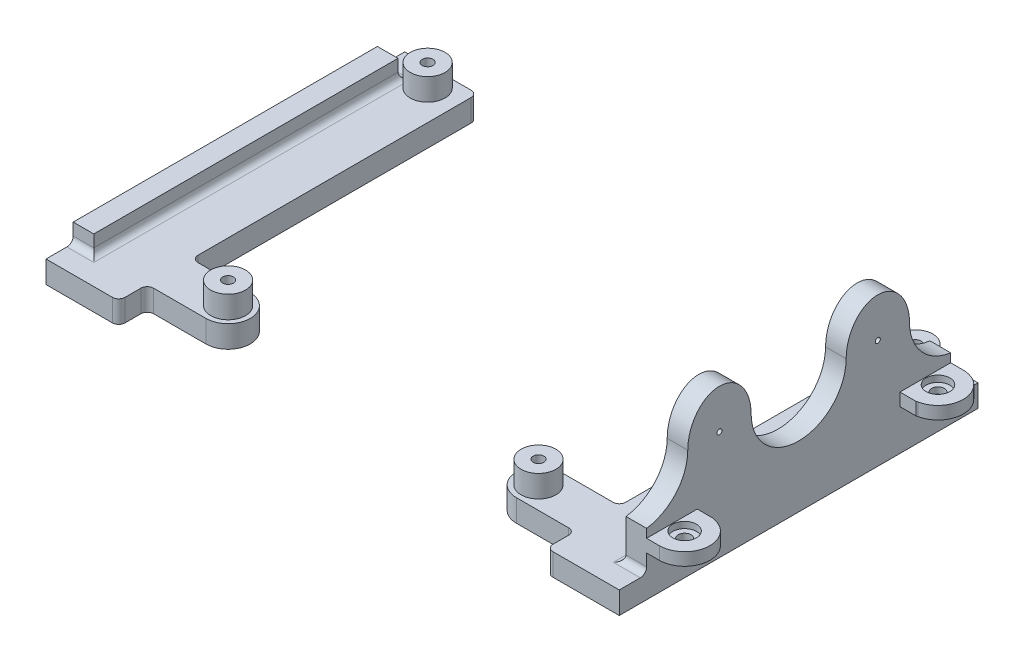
ISO-10303-21;
HEADER;
FILE_DESCRIPTION(('STEP AP214'),'2;1');
FILE_NAME('part.step','',(''),(''),'','','');
FILE_SCHEMA(('AUTOMOTIVE_DESIGN { 1 0 10303 214 1 1 1 1 }'));
ENDSEC;
DATA;
#1=APPLICATION_CONTEXT('core data for automotive mechanical design processes');
#2=APPLICATION_PROTOCOL_DEFINITION('international standard','automotive_design',2000,#1);
#3=PRODUCT_CONTEXT('',#1,'mechanical');
#4=PRODUCT('Part','Part','',(#3));
#5=PRODUCT_RELATED_PRODUCT_CATEGORY('part','',(#4));
#6=PRODUCT_DEFINITION_FORMATION('','',#4);
#7=PRODUCT_DEFINITION_CONTEXT('part definition',#1,'design');
#8=PRODUCT_DEFINITION('design','',#6,#7);
#9=PRODUCT_DEFINITION_SHAPE('','',#8);
#10=(LENGTH_UNIT() NAMED_UNIT(*) SI_UNIT(.MILLI.,.METRE.));
#11=(NAMED_UNIT(*) PLANE_ANGLE_UNIT() SI_UNIT($,.RADIAN.));
#12=(NAMED_UNIT(*) SI_UNIT($,.STERADIAN.) SOLID_ANGLE_UNIT());
#13=UNCERTAINTY_MEASURE_WITH_UNIT(LENGTH_MEASURE(1.E-05),#10,'distance_accuracy_value','');
#14=(GEOMETRIC_REPRESENTATION_CONTEXT(3) GLOBAL_UNCERTAINTY_ASSIGNED_CONTEXT((#13)) GLOBAL_UNIT_ASSIGNED_CONTEXT((#10,
#11,#12)) REPRESENTATION_CONTEXT('',''));
#15=CARTESIAN_POINT('',(0.,0.,0.));
#16=DIRECTION('',(0.,0.,1.));
#17=DIRECTION('',(1.,0.,0.));
#18=AXIS2_PLACEMENT_3D('',#15,#16,#17);
#19=CARTESIAN_POINT('',(45.2499982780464,31.3999999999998,-28.3189679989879));
#20=DIRECTION('',(-1.,0.,0.));
#21=DIRECTION('',(0.,0.,1.));
#22=AXIS2_PLACEMENT_3D('',#19,#20,#21);
#23=PLANE('',#22);
#24=CARTESIAN_POINT('',(45.2499982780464,45.0999999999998,-12.5));
#25=DIRECTION('',(-1.,0.,0.));
#26=DIRECTION('',(0.,0.,1.));
#27=AXIS2_PLACEMENT_3D('',#24,#25,#26);
#28=CIRCLE('',#27,0.399999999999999);
#29=CARTESIAN_POINT('',(45.2499982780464,45.0999999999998,-12.1));
#30=VERTEX_POINT('',#29);
#31=EDGE_CURVE('E599',#30,#30,#28,.T.);
#32=ORIENTED_EDGE('',*,*,#31,.T.);
#33=EDGE_LOOP('',(#32));
#34=FACE_BOUND('',#33,.T.);
#35=CARTESIAN_POINT('',(45.2499982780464,45.0999999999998,12.5));
#36=DIRECTION('',(-1.,0.,0.));
#37=DIRECTION('',(0.,0.,1.));
#38=AXIS2_PLACEMENT_3D('',#35,#36,#37);
#39=CIRCLE('',#38,0.399999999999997);
#40=CARTESIAN_POINT('',(45.2499982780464,45.0999999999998,12.9));
#41=VERTEX_POINT('',#40);
#42=EDGE_CURVE('E602',#41,#41,#39,.T.);
#43=ORIENTED_EDGE('',*,*,#42,.T.);
#44=EDGE_LOOP('',(#43));
#45=FACE_BOUND('',#44,.T.);
#46=CARTESIAN_POINT('',(45.2499982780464,45.0999999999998,12.5));
#47=DIRECTION('',(-1.,0.,0.));
#48=DIRECTION('',(0.,1.,0.));
#49=AXIS2_PLACEMENT_3D('',#46,#47,#48);
#50=ELLIPSE('',#49,6.25,5.);
#51=CARTESIAN_POINT('',(45.2499982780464,45.1000004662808,17.5));
#52=VERTEX_POINT('',#51);
#53=CARTESIAN_POINT('',(45.2499982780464,45.0999999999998,7.5));
#54=VERTEX_POINT('',#53);
#55=EDGE_CURVE('E343',#52,#54,#50,.T.);
#56=ORIENTED_EDGE('',*,*,#55,.F.);
#57=CARTESIAN_POINT('',(45.2499982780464,45.1000011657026,25.0000042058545));
#58=DIRECTION('',(1.,0.,0.));
#59=DIRECTION('',(0.,0.,1.));
#60=AXIS2_PLACEMENT_3D('',#57,#58,#59);
#61=CIRCLE('',#60,7.50000420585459);
#62=CARTESIAN_POINT('',(45.2499982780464,37.6669635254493,23.9999969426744));
#63=VERTEX_POINT('',#62);
#64=EDGE_CURVE('E351',#63,#52,#61,.T.);
#65=ORIENTED_EDGE('',*,*,#64,.F.);
#66=DIRECTION('',(0.,-1.,0.));
#67=VECTOR('',#66,1.);
#68=CARTESIAN_POINT('',(45.2499999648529,52.2999999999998,23.9999969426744));
#69=LINE('',#68,#67);
#70=CARTESIAN_POINT('',(45.2499999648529,36.2999999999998,23.9999969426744));
#71=VERTEX_POINT('',#70);
#72=EDGE_CURVE('E613',#63,#71,#69,.T.);
#73=ORIENTED_EDGE('',*,*,#72,.T.);
#74=DIRECTION('',(0.,0.,-1.));
#75=VECTOR('',#74,1.);
#76=CARTESIAN_POINT('',(45.2499999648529,36.2999999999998,-24.0000028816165));
#77=LINE('',#76,#75);
#78=CARTESIAN_POINT('',(45.2499996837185,36.2999999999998,15.9999968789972));
#79=VERTEX_POINT('',#78);
#80=EDGE_CURVE('E605',#71,#79,#77,.T.);
#81=ORIENTED_EDGE('',*,*,#80,.T.);
#82=DIRECTION('',(0.,-1.,0.));
#83=VECTOR('',#82,1.);
#84=CARTESIAN_POINT('',(45.2499996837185,36.2999999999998,15.9999968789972));
#85=LINE('',#84,#83);
#86=CARTESIAN_POINT('',(45.2499999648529,34.2999999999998,15.9999968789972));
#87=VERTEX_POINT('',#86);
#88=EDGE_CURVE('E681',#79,#87,#85,.T.);
#89=ORIENTED_EDGE('',*,*,#88,.T.);
#90=DIRECTION('',(0.,0.,-1.));
#91=VECTOR('',#90,1.);
#92=CARTESIAN_POINT('',(45.2499999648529,34.2999999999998,23.9999969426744));
#93=LINE('',#92,#91);
#94=CARTESIAN_POINT('',(45.2499999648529,34.2999999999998,23.9999969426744));
#95=VERTEX_POINT('',#94);
#96=EDGE_CURVE('E793',#95,#87,#93,.T.);
#97=ORIENTED_EDGE('',*,*,#96,.F.);
#98=DIRECTION('',(0.,-1.,0.));
#99=VECTOR('',#98,1.);
#100=CARTESIAN_POINT('',(45.2499999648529,82.4299272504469,23.9999969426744));
#101=LINE('',#100,#99);
#102=CARTESIAN_POINT('',(45.2499999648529,32.3999999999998,23.9999969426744));
#103=VERTEX_POINT('',#102);
#104=EDGE_CURVE('E801',#95,#103,#101,.T.);
#105=ORIENTED_EDGE('',*,*,#104,.T.);
#106=CARTESIAN_POINT('',(45.2499982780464,32.3999999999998,24.9999969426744));
#107=DIRECTION('',(-1.,0.,0.));
#108=DIRECTION('',(0.,0.,1.));
#109=AXIS2_PLACEMENT_3D('',#106,#107,#108);
#110=CIRCLE('',#109,1.);
#111=CARTESIAN_POINT('',(45.2499982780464,31.3999999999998,24.9999969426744));
#112=VERTEX_POINT('',#111);
#113=EDGE_CURVE('E910',#103,#112,#110,.T.);
#114=ORIENTED_EDGE('',*,*,#113,.T.);
#115=DIRECTION('',(0.,0.,-1.));
#116=VECTOR('',#115,1.);
#117=CARTESIAN_POINT('',(45.2499982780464,31.3999999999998,-28.3189679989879));
#118=LINE('',#117,#116);
#119=CARTESIAN_POINT('',(45.2499982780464,31.3999999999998,28.3154120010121));
#120=VERTEX_POINT('',#119);
#121=EDGE_CURVE('E808',#120,#112,#118,.T.);
#122=ORIENTED_EDGE('',*,*,#121,.F.);
#123=DIRECTION('',(0.,-1.,0.));
#124=VECTOR('',#123,1.);
#125=CARTESIAN_POINT('',(45.2499982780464,31.3999999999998,28.3154120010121));
#126=LINE('',#125,#124);
#127=CARTESIAN_POINT('',(45.2499982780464,27.8999999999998,28.3154120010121));
#128=VERTEX_POINT('',#127);
#129=EDGE_CURVE('E830',#120,#128,#126,.T.);
#130=ORIENTED_EDGE('',*,*,#129,.T.);
#131=DIRECTION('',(0.,0.,-1.));
#132=VECTOR('',#131,1.);
#133=CARTESIAN_POINT('',(45.2499982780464,27.8999999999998,-28.3189679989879));
#134=LINE('',#133,#132);
#135=CARTESIAN_POINT('',(45.2499982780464,27.8999999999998,-28.3189679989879));
#136=VERTEX_POINT('',#135);
#137=EDGE_CURVE('E795',#128,#136,#134,.T.);
#138=ORIENTED_EDGE('',*,*,#137,.T.);
#139=DIRECTION('',(0.,-1.,0.));
#140=VECTOR('',#139,1.);
#141=CARTESIAN_POINT('',(45.2499982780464,31.3999999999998,-28.3189679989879));
#142=LINE('',#141,#140);
#143=CARTESIAN_POINT('',(45.2499982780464,31.3999999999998,-28.3189679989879));
#144=VERTEX_POINT('',#143);
#145=EDGE_CURVE('E859',#144,#136,#142,.T.);
#146=ORIENTED_EDGE('',*,*,#145,.F.);
#147=CARTESIAN_POINT('',(45.2499982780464,31.3999999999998,-25.0000028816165));
#148=VERTEX_POINT('',#147);
#149=EDGE_CURVE('E812',#148,#144,#118,.T.);
#150=ORIENTED_EDGE('',*,*,#149,.F.);
#151=CARTESIAN_POINT('',(45.2499982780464,32.3999999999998,-25.0000028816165));
#152=DIRECTION('',(-1.,0.,0.));
#153=DIRECTION('',(0.,0.,1.));
#154=AXIS2_PLACEMENT_3D('',#151,#152,#153);
#155=CIRCLE('',#154,1.);
#156=CARTESIAN_POINT('',(45.2499999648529,32.3999999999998,-24.0000028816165));
#157=VERTEX_POINT('',#156);
#158=EDGE_CURVE('E904',#148,#157,#155,.T.);
#159=ORIENTED_EDGE('',*,*,#158,.T.);
#160=DIRECTION('',(0.,-1.,0.));
#161=VECTOR('',#160,1.);
#162=CARTESIAN_POINT('',(45.2499999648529,82.4299272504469,-24.0000028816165));
#163=LINE('',#162,#161);
#164=CARTESIAN_POINT('',(45.2499999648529,34.2999999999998,-24.0000028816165));
#165=VERTEX_POINT('',#164);
#166=EDGE_CURVE('E797',#165,#157,#163,.T.);
#167=ORIENTED_EDGE('',*,*,#166,.F.);
#168=CARTESIAN_POINT('',(45.2499999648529,34.2999999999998,-16.000001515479));
#169=VERTEX_POINT('',#168);
#170=EDGE_CURVE('E796',#169,#165,#93,.T.);
#171=ORIENTED_EDGE('',*,*,#170,.F.);
#172=DIRECTION('',(0.,-1.,0.));
#173=VECTOR('',#172,1.);
#174=CARTESIAN_POINT('',(45.2499999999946,36.2999999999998,-15.9999999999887));
#175=LINE('',#174,#173);
#176=CARTESIAN_POINT('',(45.2499999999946,36.2999999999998,-15.9999999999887));
#177=VERTEX_POINT('',#176);
#178=EDGE_CURVE('E678',#177,#169,#175,.T.);
#179=ORIENTED_EDGE('',*,*,#178,.F.);
#180=CARTESIAN_POINT('',(45.2499999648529,36.2999999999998,-24.0000028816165));
#181=VERTEX_POINT('',#180);
#182=EDGE_CURVE('E59',#177,#181,#77,.T.);
#183=ORIENTED_EDGE('',*,*,#182,.T.);
#184=DIRECTION('',(0.,-1.,0.));
#185=VECTOR('',#184,1.);
#186=CARTESIAN_POINT('',(45.2499999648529,52.2999999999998,-24.0000028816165));
#187=LINE('',#186,#185);
#188=CARTESIAN_POINT('',(45.2499982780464,37.666959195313,-24.0000028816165));
#189=VERTEX_POINT('',#188);
#190=EDGE_CURVE('E611',#189,#181,#187,.T.);
#191=ORIENTED_EDGE('',*,*,#190,.F.);
#192=CARTESIAN_POINT('',(45.2499982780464,45.0999965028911,-25.0000126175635));
#193=DIRECTION('',(1.,0.,0.));
#194=DIRECTION('',(0.,0.,-1.));
#195=AXIS2_PLACEMENT_3D('',#192,#193,#194);
#196=CIRCLE('',#195,7.50000420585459);
#197=CARTESIAN_POINT('',(45.2499982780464,45.099997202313,-17.5000084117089));
#198=VERTEX_POINT('',#197);
#199=EDGE_CURVE('E348',#198,#189,#196,.T.);
#200=ORIENTED_EDGE('',*,*,#199,.F.);
#201=CARTESIAN_POINT('',(45.2499982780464,45.099997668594,-12.500008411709));
#202=DIRECTION('',(-1.,0.,0.));
#203=DIRECTION('',(0.,0.999999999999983,-1.86512398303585E-07));
#204=AXIS2_PLACEMENT_3D('',#201,#202,#203);
#205=ELLIPSE('',#204,6.25,5.);
#206=CARTESIAN_POINT('',(45.2499982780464,45.099998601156,-7.50000841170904));
#207=VERTEX_POINT('',#206);
#208=EDGE_CURVE('E361',#207,#198,#205,.T.);
#209=ORIENTED_EDGE('',*,*,#208,.F.);
#210=CARTESIAN_POINT('',(45.2499982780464,45.0999999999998,-4.20585458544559E-06));
#211=DIRECTION('',(1.,0.,0.));
#212=DIRECTION('',(0.,0.,-1.));
#213=AXIS2_PLACEMENT_3D('',#210,#211,#212);
#214=CIRCLE('',#213,7.50000420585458);
#215=EDGE_CURVE('E359',#54,#207,#214,.T.);
#216=ORIENTED_EDGE('',*,*,#215,.F.);
#217=EDGE_LOOP('',(#56,#65,#73,#81,#89,#97,#105,#114,#122,#130,#138,#146,#150,#159,#167,#171,
#179,#183,#191,#200,#209,#216));
#218=FACE_BOUND('',#217,.T.);
#219=ADVANCED_FACE('F45',(#34,#45,#218),#23,.F.);
#220=CARTESIAN_POINT('',(41.9999999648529,82.4299272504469,23.9999969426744));
#221=DIRECTION('',(1.,0.,0.));
#222=DIRECTION('',(0.,0.,-1.));
#223=AXIS2_PLACEMENT_3D('',#220,#221,#222);
#224=PLANE('',#223);
#225=CARTESIAN_POINT('',(41.9999999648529,45.0999999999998,-12.5));
#226=DIRECTION('',(-1.,0.,0.));
#227=DIRECTION('',(0.,0.,1.));
#228=AXIS2_PLACEMENT_3D('',#225,#226,#227);
#229=CIRCLE('',#228,0.399999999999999);
#230=CARTESIAN_POINT('',(41.9999999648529,45.0999999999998,-12.1));
#231=VERTEX_POINT('',#230);
#232=EDGE_CURVE('E399',#231,#231,#229,.T.);
#233=ORIENTED_EDGE('',*,*,#232,.F.);
#234=EDGE_LOOP('',(#233));
#235=FACE_BOUND('',#234,.T.);
#236=CARTESIAN_POINT('',(41.9999999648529,45.0999999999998,12.5));
#237=DIRECTION('',(-1.,0.,0.));
#238=DIRECTION('',(0.,0.,-1.));
#239=AXIS2_PLACEMENT_3D('',#236,#237,#238);
#240=CIRCLE('',#239,0.399999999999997);
#241=CARTESIAN_POINT('',(41.9999999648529,45.0999999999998,12.1));
#242=VERTEX_POINT('',#241);
#243=EDGE_CURVE('E398',#242,#242,#240,.T.);
#244=ORIENTED_EDGE('',*,*,#243,.F.);
#245=EDGE_LOOP('',(#244));
#246=FACE_BOUND('',#245,.T.);
#247=DIRECTION('',(0.,-1.,0.));
#248=VECTOR('',#247,1.);
#249=CARTESIAN_POINT('',(41.9999999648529,82.4299272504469,23.9999969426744));
#250=LINE('',#249,#248);
#251=CARTESIAN_POINT('',(41.9999999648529,37.6669635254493,23.9999969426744));
#252=VERTEX_POINT('',#251);
#253=CARTESIAN_POINT('',(41.9999999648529,32.3999999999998,23.9999969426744));
#254=VERTEX_POINT('',#253);
#255=EDGE_CURVE('E803',#252,#254,#250,.T.);
#256=ORIENTED_EDGE('',*,*,#255,.F.);
#257=CARTESIAN_POINT('',(41.9999999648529,45.1000011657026,25.0000042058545));
#258=DIRECTION('',(1.,0.,0.));
#259=DIRECTION('',(0.,0.,-1.));
#260=AXIS2_PLACEMENT_3D('',#257,#258,#259);
#261=CIRCLE('',#260,7.50000420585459);
#262=CARTESIAN_POINT('',(41.9999999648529,45.1000004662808,17.5));
#263=VERTEX_POINT('',#262);
#264=EDGE_CURVE('E66',#263,#252,#261,.F.);
#265=ORIENTED_EDGE('',*,*,#264,.F.);
#266=CARTESIAN_POINT('',(41.9999999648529,45.0999999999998,12.5));
#267=DIRECTION('',(-1.,0.,0.));
#268=DIRECTION('',(0.,1.,0.));
#269=AXIS2_PLACEMENT_3D('',#266,#267,#268);
#270=ELLIPSE('',#269,6.25,5.);
#271=CARTESIAN_POINT('',(41.9999999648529,45.0999999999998,7.5));
#272=VERTEX_POINT('',#271);
#273=EDGE_CURVE('E346',#272,#263,#270,.F.);
#274=ORIENTED_EDGE('',*,*,#273,.F.);
#275=CARTESIAN_POINT('',(41.9999999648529,45.0999999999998,-4.20585458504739E-06));
#276=DIRECTION('',(1.,0.,0.));
#277=DIRECTION('',(0.,0.,-1.));
#278=AXIS2_PLACEMENT_3D('',#275,#276,#277);
#279=CIRCLE('',#278,7.50000420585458);
#280=CARTESIAN_POINT('',(41.9999999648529,45.099998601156,-7.50000841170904));
#281=VERTEX_POINT('',#280);
#282=EDGE_CURVE('E1001',#281,#272,#279,.F.);
#283=ORIENTED_EDGE('',*,*,#282,.F.);
#284=CARTESIAN_POINT('',(41.9999999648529,45.099997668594,-12.500008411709));
#285=DIRECTION('',(-1.,0.,0.));
#286=DIRECTION('',(0.,0.999999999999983,-1.86512398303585E-07));
#287=AXIS2_PLACEMENT_3D('',#284,#285,#286);
#288=ELLIPSE('',#287,6.25,5.);
#289=CARTESIAN_POINT('',(41.9999999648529,45.099997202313,-17.5000084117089));
#290=VERTEX_POINT('',#289);
#291=EDGE_CURVE('E997',#290,#281,#288,.F.);
#292=ORIENTED_EDGE('',*,*,#291,.F.);
#293=CARTESIAN_POINT('',(41.9999999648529,45.0999965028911,-25.0000126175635));
#294=DIRECTION('',(1.,0.,0.));
#295=DIRECTION('',(0.,0.,-1.));
#296=AXIS2_PLACEMENT_3D('',#293,#294,#295);
#297=CIRCLE('',#296,7.50000420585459);
#298=CARTESIAN_POINT('',(41.9999999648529,37.666959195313,-24.0000028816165));
#299=VERTEX_POINT('',#298);
#300=EDGE_CURVE('E994',#299,#290,#297,.F.);
#301=ORIENTED_EDGE('',*,*,#300,.F.);
#302=DIRECTION('',(0.,-1.,0.));
#303=VECTOR('',#302,1.);
#304=CARTESIAN_POINT('',(41.9999999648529,82.4299272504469,-24.0000028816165));
#305=LINE('',#304,#303);
#306=CARTESIAN_POINT('',(41.9999999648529,32.3999999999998,-24.0000028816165));
#307=VERTEX_POINT('',#306);
#308=EDGE_CURVE('E800',#299,#307,#305,.T.);
#309=ORIENTED_EDGE('',*,*,#308,.T.);
#310=DIRECTION('',(0.,0.,1.));
#311=VECTOR('',#310,1.);
#312=CARTESIAN_POINT('',(41.9999999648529,32.3999999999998,23.9999969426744));
#313=LINE('',#312,#311);
#314=EDGE_CURVE('E916',#307,#254,#313,.T.);
#315=ORIENTED_EDGE('',*,*,#314,.T.);
#316=EDGE_LOOP('',(#256,#265,#274,#283,#292,#301,#309,#315));
#317=FACE_BOUND('',#316,.T.);
#318=ADVANCED_FACE('F552',(#235,#246,#317),#224,.F.);
#319=CARTESIAN_POINT('',(24.499951,31.3999999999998,20.3154280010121));
#320=DIRECTION('',(0.,1.,0.));
#321=DIRECTION('',(0.,0.,1.));
#322=AXIS2_PLACEMENT_3D('',#319,#320,#321);
#323=PLANE('',#322);
#324=DIRECTION('',(0.,0.,1.));
#325=VECTOR('',#324,1.);
#326=CARTESIAN_POINT('',(40.9999999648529,31.3999999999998,20.3154280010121));
#327=LINE('',#326,#325);
#328=CARTESIAN_POINT('',(40.9999999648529,31.3999999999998,24.9999969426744));
#329=VERTEX_POINT('',#328);
#330=CARTESIAN_POINT('',(40.9999999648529,31.3999999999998,-24.0391320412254));
#331=VERTEX_POINT('',#330);
#332=EDGE_CURVE('E919',#329,#331,#327,.F.);
#333=ORIENTED_EDGE('',*,*,#332,.T.);
#334=CARTESIAN_POINT('',(38.499923,31.3999999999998,-25.1846079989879));
#335=DIRECTION('',(0.,1.,0.));
#336=DIRECTION('',(0.,0.,1.));
#337=AXIS2_PLACEMENT_3D('',#334,#335,#336);
#338=CIRCLE('',#337,2.75);
#339=CARTESIAN_POINT('',(41.2437198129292,31.3999999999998,-25.0000028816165));
#340=VERTEX_POINT('',#339);
#341=EDGE_CURVE('E74',#340,#331,#338,.T.);
#342=ORIENTED_EDGE('',*,*,#341,.F.);
#343=DIRECTION('',(-1.,0.,0.));
#344=VECTOR('',#343,1.);
#345=CARTESIAN_POINT('',(24.499951,31.3999999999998,-25.0000028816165));
#346=LINE('',#345,#344);
#347=EDGE_CURVE('E875',#340,#148,#346,.F.);
#348=ORIENTED_EDGE('',*,*,#347,.T.);
#349=ORIENTED_EDGE('',*,*,#149,.T.);
#350=DIRECTION('',(-1.,0.,0.));
#351=VECTOR('',#350,1.);
#352=CARTESIAN_POINT('',(45.2499982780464,31.3999999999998,-28.3189679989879));
#353=LINE('',#352,#351);
#354=CARTESIAN_POINT('',(34.7699982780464,31.3999999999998,-28.3189679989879));
#355=VERTEX_POINT('',#354);
#356=EDGE_CURVE('E811',#144,#355,#353,.T.);
#357=ORIENTED_EDGE('',*,*,#356,.T.);
#358=CARTESIAN_POINT('',(34.7699982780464,31.3999999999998,-27.3189679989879));
#359=DIRECTION('',(0.,1.,0.));
#360=DIRECTION('',(0.,0.,1.));
#361=AXIS2_PLACEMENT_3D('',#358,#359,#360);
#362=CIRCLE('',#361,1.);
#363=CARTESIAN_POINT('',(33.7699982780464,31.3999999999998,-27.3189679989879));
#364=VERTEX_POINT('',#363);
#365=EDGE_CURVE('E873',#355,#364,#362,.T.);
#366=ORIENTED_EDGE('',*,*,#365,.T.);
#367=DIRECTION('',(0.,0.,1.));
#368=VECTOR('',#367,1.);
#369=CARTESIAN_POINT('',(33.7699982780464,31.3999999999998,-28.3189679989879));
#370=LINE('',#369,#368);
#371=CARTESIAN_POINT('',(33.7699982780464,31.3999999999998,15.8154280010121));
#372=VERTEX_POINT('',#371);
#373=EDGE_CURVE('E815',#364,#372,#370,.T.);
#374=ORIENTED_EDGE('',*,*,#373,.T.);
#375=CARTESIAN_POINT('',(32.7699982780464,31.3999999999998,15.8154280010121));
#376=DIRECTION('',(0.,1.,0.));
#377=DIRECTION('',(0.,0.,1.));
#378=AXIS2_PLACEMENT_3D('',#375,#376,#377);
#379=CIRCLE('',#378,1.);
#380=CARTESIAN_POINT('',(32.7699982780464,31.3999999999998,16.8154280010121));
#381=VERTEX_POINT('',#380);
#382=EDGE_CURVE('E908',#372,#381,#379,.F.);
#383=ORIENTED_EDGE('',*,*,#382,.T.);
#384=DIRECTION('',(-1.,0.,0.));
#385=VECTOR('',#384,1.);
#386=CARTESIAN_POINT('',(24.499951,31.3999999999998,16.8154280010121));
#387=LINE('',#386,#385);
#388=CARTESIAN_POINT('',(24.499951,31.3999999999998,16.8154280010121));
#389=VERTEX_POINT('',#388);
#390=EDGE_CURVE('E818',#381,#389,#387,.T.);
#391=ORIENTED_EDGE('',*,*,#390,.T.);
#392=CARTESIAN_POINT('',(24.499951,31.3999999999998,20.3154280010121));
#393=DIRECTION('',(0.,1.,0.));
#394=DIRECTION('',(0.,0.,1.));
#395=AXIS2_PLACEMENT_3D('',#392,#393,#394);
#396=CIRCLE('',#395,3.5);
#397=CARTESIAN_POINT('',(24.499951,31.3999999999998,23.8154280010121));
#398=VERTEX_POINT('',#397);
#399=EDGE_CURVE('E820',#389,#398,#396,.T.);
#400=ORIENTED_EDGE('',*,*,#399,.T.);
#401=DIRECTION('',(1.,0.,0.));
#402=VECTOR('',#401,1.);
#403=CARTESIAN_POINT('',(24.499951,31.3999999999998,23.8154280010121));
#404=LINE('',#403,#402);
#405=CARTESIAN_POINT('',(32.7699982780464,31.3999999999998,23.8154280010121));
#406=VERTEX_POINT('',#405);
#407=EDGE_CURVE('E822',#398,#406,#404,.T.);
#408=ORIENTED_EDGE('',*,*,#407,.T.);
#409=CARTESIAN_POINT('',(32.7699982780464,31.3999999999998,24.8154280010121));
#410=DIRECTION('',(0.,1.,0.));
#411=DIRECTION('',(0.,0.,1.));
#412=AXIS2_PLACEMENT_3D('',#409,#410,#411);
#413=CIRCLE('',#412,1.);
#414=CARTESIAN_POINT('',(33.7699982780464,31.3999999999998,24.8154280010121));
#415=VERTEX_POINT('',#414);
#416=EDGE_CURVE('E914',#406,#415,#413,.F.);
#417=ORIENTED_EDGE('',*,*,#416,.T.);
#418=DIRECTION('',(0.,0.,1.));
#419=VECTOR('',#418,1.);
#420=CARTESIAN_POINT('',(33.7699982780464,31.3999999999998,23.8154280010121));
#421=LINE('',#420,#419);
#422=CARTESIAN_POINT('',(33.7699982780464,31.3999999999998,27.3154120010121));
#423=VERTEX_POINT('',#422);
#424=EDGE_CURVE('E825',#415,#423,#421,.T.);
#425=ORIENTED_EDGE('',*,*,#424,.T.);
#426=CARTESIAN_POINT('',(34.7699982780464,31.3999999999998,27.3154120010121));
#427=DIRECTION('',(0.,1.,0.));
#428=DIRECTION('',(0.,0.,1.));
#429=AXIS2_PLACEMENT_3D('',#426,#427,#428);
#430=CIRCLE('',#429,1.);
#431=CARTESIAN_POINT('',(34.7699982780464,31.3999999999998,28.3154120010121));
#432=VERTEX_POINT('',#431);
#433=EDGE_CURVE('E869',#423,#432,#430,.T.);
#434=ORIENTED_EDGE('',*,*,#433,.T.);
#435=DIRECTION('',(1.,0.,0.));
#436=VECTOR('',#435,1.);
#437=CARTESIAN_POINT('',(45.2499982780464,31.3999999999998,28.3154120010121));
#438=LINE('',#437,#436);
#439=EDGE_CURVE('E828',#432,#120,#438,.T.);
#440=ORIENTED_EDGE('',*,*,#439,.T.);
#441=ORIENTED_EDGE('',*,*,#121,.T.);
#442=DIRECTION('',(1.,0.,0.));
#443=VECTOR('',#442,1.);
#444=CARTESIAN_POINT('',(24.499951,31.3999999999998,24.9999969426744));
#445=LINE('',#444,#443);
#446=EDGE_CURVE('E871',#112,#329,#445,.F.);
#447=ORIENTED_EDGE('',*,*,#446,.T.);
#448=EDGE_LOOP('',(#333,#342,#348,#349,#357,#366,#374,#383,#391,#400,#408,#417,#425,#434,#440,
#441,#447));
#449=FACE_BOUND('',#448,.T.);
#450=CARTESIAN_POINT('',(24.499951,31.3999999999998,20.3154280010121));
#451=DIRECTION('',(0.,1.,0.));
#452=DIRECTION('',(0.,0.,1.));
#453=AXIS2_PLACEMENT_3D('',#450,#451,#452);
#454=CIRCLE('',#453,2.75);
#455=CARTESIAN_POINT('',(24.499951,31.3999999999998,23.0654280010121));
#456=VERTEX_POINT('',#455);
#457=EDGE_CURVE('E377',#456,#456,#454,.T.);
#458=ORIENTED_EDGE('',*,*,#457,.F.);
#459=EDGE_LOOP('',(#458));
#460=FACE_BOUND('',#459,.T.);
#461=ADVANCED_FACE('F555',(#449,#460),#323,.T.);
#462=CARTESIAN_POINT('',(45.2499999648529,32.3999999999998,-25.0000028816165));
#463=DIRECTION('',(-1.,0.,0.));
#464=DIRECTION('',(0.,0.,1.));
#465=AXIS2_PLACEMENT_3D('',#462,#463,#464);
#466=CYLINDRICAL_SURFACE('',#465,1.);
#467=CARTESIAN_POINT('',(40.9816987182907,32.3999999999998,-24.0000028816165));
#468=CARTESIAN_POINT('',(40.9816953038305,32.3733667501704,-24.0000015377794));
#469=CARTESIAN_POINT('',(40.9822071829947,32.3467477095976,-24.001067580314));
#470=CARTESIAN_POINT('',(40.9842268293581,32.2937272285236,-24.0053103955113));
#471=CARTESIAN_POINT('',(40.9857341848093,32.2673257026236,-24.0084862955));
#472=CARTESIAN_POINT('',(40.9916772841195,32.1889724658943,-24.0210998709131));
#473=CARTESIAN_POINT('',(40.9975347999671,32.1375894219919,-24.0336240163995));
#474=CARTESIAN_POINT('',(41.0123652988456,32.037939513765,-24.0663723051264));
#475=CARTESIAN_POINT('',(41.0213346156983,31.9896690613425,-24.0865873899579));
#476=CARTESIAN_POINT('',(41.0414771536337,31.8971724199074,-24.1340528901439));
#477=CARTESIAN_POINT('',(41.0526527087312,31.8529505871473,-24.1613107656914));
#478=CARTESIAN_POINT('',(41.0768807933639,31.7670411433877,-24.2238917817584));
#479=CARTESIAN_POINT('',(41.0900043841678,31.7256465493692,-24.2595892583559));
#480=CARTESIAN_POINT('',(41.1164268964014,31.6492202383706,-24.3372075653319));
#481=CARTESIAN_POINT('',(41.1297258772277,31.6141907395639,-24.3791305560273));
#482=CARTESIAN_POINT('',(41.1561705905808,31.5494247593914,-24.470981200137));
#483=CARTESIAN_POINT('',(41.1692598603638,31.5201286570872,-24.5212371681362));
#484=CARTESIAN_POINT('',(41.1932277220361,31.4705639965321,-24.6264734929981));
#485=CARTESIAN_POINT('',(41.2041087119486,31.4502856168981,-24.6814486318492));
#486=CARTESIAN_POINT('',(41.2203913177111,31.423425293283,-24.780388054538));
#487=CARTESIAN_POINT('',(41.2264827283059,31.4146853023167,-24.8236628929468));
#488=CARTESIAN_POINT('',(41.2366648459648,31.402960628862,-24.9112535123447));
#489=CARTESIAN_POINT('',(41.2407536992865,31.3999812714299,-24.9555702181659));
#490=CARTESIAN_POINT('',(41.2437198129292,31.3999999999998,-25.0000028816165));
#491=B_SPLINE_CURVE_WITH_KNOTS('',3,(#467,#468,#469,#470,#471,#472,#473,#474,#475,#476,#477,
#478,#479,#480,#481,#482,#483,#484,#485,#486,#487,#488,#489,#490),.UNSPECIFIED.,.F.,.F.,(4,2,2,
2,2,2,2,2,2,2,2,4),(0.,0.0798460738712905,0.159659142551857,0.318448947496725,0.477052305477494,
0.635824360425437,0.80374851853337,0.971731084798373,1.14973401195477,1.32754259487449,
1.46083206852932,1.59424469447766),.UNSPECIFIED.);
#492=CARTESIAN_POINT('',(41.2199961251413,31.4244992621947,-24.7800067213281));
#493=VERTEX_POINT('',#492);
#494=EDGE_CURVE('E389',#493,#340,#491,.T.);
#495=ORIENTED_EDGE('',*,*,#494,.F.);
#496=CARTESIAN_POINT('',(40.9999999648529,32.3999999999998,-25.0000028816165));
#497=DIRECTION('',(-0.707106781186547,0.,0.707106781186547));
#498=DIRECTION('',(-0.707106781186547,0.,-0.707106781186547));
#499=AXIS2_PLACEMENT_3D('',#496,#497,#498);
#500=ELLIPSE('',#499,1.41421356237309,1.);
#501=EDGE_CURVE('E924',#493,#307,#500,.T.);
#502=ORIENTED_EDGE('',*,*,#501,.T.);
#503=DIRECTION('',(-1.,0.,0.));
#504=VECTOR('',#503,1.);
#505=CARTESIAN_POINT('',(45.2499999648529,32.3999999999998,-24.0000028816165));
#506=LINE('',#505,#504);
#507=EDGE_CURVE('E862',#157,#307,#506,.T.);
#508=ORIENTED_EDGE('',*,*,#507,.F.);
#509=ORIENTED_EDGE('',*,*,#158,.F.);
#510=ORIENTED_EDGE('',*,*,#347,.F.);
#511=EDGE_LOOP('',(#495,#502,#508,#509,#510));
#512=FACE_BOUND('',#511,.T.);
#513=ADVANCED_FACE('F401',(#512),#466,.F.);
#514=CARTESIAN_POINT('',(40.9999999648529,32.3999999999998,23.9999969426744));
#515=DIRECTION('',(0.,0.,1.));
#516=DIRECTION('',(0.,-1.,0.));
#517=AXIS2_PLACEMENT_3D('',#514,#515,#516);
#518=CYLINDRICAL_SURFACE('',#517,1.);
#519=CARTESIAN_POINT('',(40.9999999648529,31.3999999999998,-24.0391320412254));
#520=CARTESIAN_POINT('',(41.0316476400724,31.4000461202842,-24.1081897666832));
#521=CARTESIAN_POINT('',(41.0604083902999,31.4015024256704,-24.1785330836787));
#522=CARTESIAN_POINT('',(41.112014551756,31.4059438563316,-24.3213387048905));
#523=CARTESIAN_POINT('',(41.1348582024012,31.4089294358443,-24.393801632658));
#524=CARTESIAN_POINT('',(41.1740871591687,31.4150763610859,-24.5389374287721));
#525=CARTESIAN_POINT('',(41.1905886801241,31.4182331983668,-24.6115792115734));
#526=CARTESIAN_POINT('',(41.2176430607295,31.423873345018,-24.7579549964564));
#527=CARTESIAN_POINT('',(41.228199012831,31.4263570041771,-24.8316884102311));
#528=CARTESIAN_POINT('',(41.2423892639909,31.4297946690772,-24.9709068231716));
#529=CARTESIAN_POINT('',(41.2467022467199,31.4308964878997,-25.0363196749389));
#530=CARTESIAN_POINT('',(41.2506670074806,31.4319345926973,-25.1678554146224));
#531=CARTESIAN_POINT('',(41.2502786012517,31.4318608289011,-25.233979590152));
#532=CARTESIAN_POINT('',(41.2475008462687,31.4311123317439,-25.3000028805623));
#533=B_SPLINE_CURVE_WITH_KNOTS('',3,(#519,#520,#521,#522,#523,#524,#525,#526,#527,#528,#529,
#530,#531,#532),.UNSPECIFIED.,.F.,.F.,(4,2,2,2,2,2,4),(0.,0.227770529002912,0.455608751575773,
0.679046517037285,0.90236795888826,1.09888619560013,1.29708531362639),.UNSPECIFIED.);
#534=EDGE_CURVE('E12',#331,#493,#533,.T.);
#535=ORIENTED_EDGE('',*,*,#534,.F.);
#536=ORIENTED_EDGE('',*,*,#332,.F.);
#537=CARTESIAN_POINT('',(40.9999999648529,32.3999999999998,24.9999969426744));
#538=DIRECTION('',(0.707106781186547,0.,0.707106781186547));
#539=DIRECTION('',(0.707106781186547,0.,-0.707106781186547));
#540=AXIS2_PLACEMENT_3D('',#537,#538,#539);
#541=ELLIPSE('',#540,1.41421356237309,1.);
#542=EDGE_CURVE('E921',#254,#329,#541,.F.);
#543=ORIENTED_EDGE('',*,*,#542,.F.);
#544=ORIENTED_EDGE('',*,*,#314,.F.);
#545=ORIENTED_EDGE('',*,*,#501,.F.);
#546=EDGE_LOOP('',(#535,#536,#543,#544,#545));
#547=FACE_BOUND('',#546,.T.);
#548=ADVANCED_FACE('F47',(#547),#518,.F.);
#549=CARTESIAN_POINT('',(47.2499984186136,36.2999999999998,-20.0000031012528));
#550=DIRECTION('',(0.,1.,0.));
#551=DIRECTION('',(0.,0.,1.));
#552=AXIS2_PLACEMENT_3D('',#549,#550,#551);
#553=PLANE('',#552);
#554=ORIENTED_EDGE('',*,*,#80,.F.);
#555=DIRECTION('',(1.,0.,0.));
#556=VECTOR('',#555,1.);
#557=CARTESIAN_POINT('',(41.9999999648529,36.2999999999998,23.9999969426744));
#558=LINE('',#557,#556);
#559=CARTESIAN_POINT('',(47.2499999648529,36.2999999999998,23.9999969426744));
#560=VERTEX_POINT('',#559);
#561=EDGE_CURVE('E643',#71,#560,#558,.T.);
#562=ORIENTED_EDGE('',*,*,#561,.T.);
#563=CARTESIAN_POINT('',(47.2500000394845,36.2999999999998,19.9999969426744));
#564=DIRECTION('',(0.,1.,0.));
#565=DIRECTION('',(0.,0.,1.));
#566=AXIS2_PLACEMENT_3D('',#563,#564,#565);
#567=CIRCLE('',#566,3.99999999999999);
#568=CARTESIAN_POINT('',(48.0499996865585,36.2999999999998,16.0808132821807));
#569=VERTEX_POINT('',#568);
#570=EDGE_CURVE('E645',#560,#569,#567,.T.);
#571=ORIENTED_EDGE('',*,*,#570,.T.);
#572=CARTESIAN_POINT('',(48.2499996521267,36.2999999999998,15.101017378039));
#573=DIRECTION('',(0.,-1.,0.));
#574=DIRECTION('',(0.,0.,1.));
#575=AXIS2_PLACEMENT_3D('',#572,#573,#574);
#576=CIRCLE('',#575,1.);
#577=CARTESIAN_POINT('',(47.8120089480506,36.2999999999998,15.9999968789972));
#578=VERTEX_POINT('',#577);
#579=EDGE_CURVE('E647',#569,#578,#576,.T.);
#580=ORIENTED_EDGE('',*,*,#579,.T.);
#581=DIRECTION('',(-1.,0.,0.));
#582=VECTOR('',#581,1.);
#583=CARTESIAN_POINT('',(47.8120089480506,36.2999999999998,15.9999968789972));
#584=LINE('',#583,#582);
#585=EDGE_CURVE('E649',#578,#79,#584,.T.);
#586=ORIENTED_EDGE('',*,*,#585,.T.);
#587=EDGE_LOOP('',(#554,#562,#571,#580,#586));
#588=FACE_BOUND('',#587,.T.);
#589=CARTESIAN_POINT('',(47.2499999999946,36.2999999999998,20.0000000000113));
#590=DIRECTION('',(0.,1.,0.));
#591=DIRECTION('',(0.,0.,1.));
#592=AXIS2_PLACEMENT_3D('',#589,#590,#591);
#593=CIRCLE('',#592,1.875);
#594=CARTESIAN_POINT('',(47.2499999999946,36.2999999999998,21.8750000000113));
#595=VERTEX_POINT('',#594);
#596=EDGE_CURVE('E620',#595,#595,#593,.T.);
#597=ORIENTED_EDGE('',*,*,#596,.F.);
#598=EDGE_LOOP('',(#597));
#599=FACE_BOUND('',#598,.T.);
#600=ADVANCED_FACE('F447',(#588,#599),#553,.T.);
#601=CARTESIAN_POINT('',(47.2499999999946,36.2999999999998,-19.9999999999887));
#602=DIRECTION('',(0.,-1.,0.));
#603=DIRECTION('',(0.,0.,-1.));
#604=AXIS2_PLACEMENT_3D('',#601,#602,#603);
#605=CYLINDRICAL_SURFACE('',#604,0.999999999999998);
#606=CARTESIAN_POINT('',(47.2499999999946,34.2999999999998,-19.9999999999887));
#607=DIRECTION('',(0.,1.,0.));
#608=DIRECTION('',(0.,0.,1.));
#609=AXIS2_PLACEMENT_3D('',#606,#607,#608);
#610=CIRCLE('',#609,0.999999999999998);
#611=CARTESIAN_POINT('',(47.2499999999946,34.2999999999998,-18.9999999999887));
#612=VERTEX_POINT('',#611);
#613=EDGE_CURVE('E631',#612,#612,#610,.T.);
#614=ORIENTED_EDGE('',*,*,#613,.F.);
#615=EDGE_LOOP('',(#614));
#616=FACE_BOUND('',#615,.T.);
#617=CARTESIAN_POINT('',(47.2499999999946,35.2999999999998,-19.9999999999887));
#618=DIRECTION('',(0.,1.,0.));
#619=DIRECTION('',(0.,0.,1.));
#620=AXIS2_PLACEMENT_3D('',#617,#618,#619);
#621=CIRCLE('',#620,0.999999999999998);
#622=CARTESIAN_POINT('',(47.2499999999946,35.2999999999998,-18.9999999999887));
#623=VERTEX_POINT('',#622);
#624=EDGE_CURVE('E632',#623,#623,#621,.T.);
#625=ORIENTED_EDGE('',*,*,#624,.T.);
#626=EDGE_LOOP('',(#625));
#627=FACE_BOUND('',#626,.T.);
#628=ADVANCED_FACE('F443',(#616,#627),#605,.F.);
#629=CARTESIAN_POINT('',(47.2499999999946,36.2999999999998,20.0000000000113));
#630=DIRECTION('',(0.,-1.,0.));
#631=DIRECTION('',(0.,0.,-1.));
#632=AXIS2_PLACEMENT_3D('',#629,#630,#631);
#633=CYLINDRICAL_SURFACE('',#632,0.999999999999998);
#634=CARTESIAN_POINT('',(47.2499999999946,34.2999999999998,20.0000000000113));
#635=DIRECTION('',(0.,1.,0.));
#636=DIRECTION('',(0.,0.,1.));
#637=AXIS2_PLACEMENT_3D('',#634,#635,#636);
#638=CIRCLE('',#637,0.999999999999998);
#639=CARTESIAN_POINT('',(47.2499999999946,34.2999999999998,21.0000000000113));
#640=VERTEX_POINT('',#639);
#641=EDGE_CURVE('E628',#640,#640,#638,.T.);
#642=ORIENTED_EDGE('',*,*,#641,.F.);
#643=EDGE_LOOP('',(#642));
#644=FACE_BOUND('',#643,.T.);
#645=CARTESIAN_POINT('',(47.2499999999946,35.2999999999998,20.0000000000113));
#646=DIRECTION('',(0.,1.,0.));
#647=DIRECTION('',(0.,0.,1.));
#648=AXIS2_PLACEMENT_3D('',#645,#646,#647);
#649=CIRCLE('',#648,0.999999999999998);
#650=CARTESIAN_POINT('',(47.2499999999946,35.2999999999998,21.0000000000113));
#651=VERTEX_POINT('',#650);
#652=EDGE_CURVE('E619',#651,#651,#649,.T.);
#653=ORIENTED_EDGE('',*,*,#652,.T.);
#654=EDGE_LOOP('',(#653));
#655=FACE_BOUND('',#654,.T.);
#656=ADVANCED_FACE('F439',(#644,#655),#633,.F.);
#657=CARTESIAN_POINT('',(38.499923,34.2999999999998,-25.1846079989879));
#658=DIRECTION('',(0.,-1.,0.));
#659=DIRECTION('',(0.,0.,-1.));
#660=AXIS2_PLACEMENT_3D('',#657,#658,#659);
#661=CYLINDRICAL_SURFACE('',#660,0.85);
#662=CARTESIAN_POINT('',(38.499923,29.1999999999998,-25.1846079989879));
#663=DIRECTION('',(0.,-1.,0.));
#664=DIRECTION('',(0.,0.,-1.));
#665=AXIS2_PLACEMENT_3D('',#662,#663,#664);
#666=CIRCLE('',#665,0.85);
#667=CARTESIAN_POINT('',(38.499923,29.1999999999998,-26.0346079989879));
#668=VERTEX_POINT('',#667);
#669=EDGE_CURVE('E807',#668,#668,#666,.F.);
#670=CARTESIAN_POINT('',(38.499923,34.8999999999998,-25.1846079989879));
#671=DIRECTION('',(0.,1.,0.));
#672=DIRECTION('',(0.,0.,1.));
#673=AXIS2_PLACEMENT_3D('',#670,#671,#672);
#674=CIRCLE('',#673,0.85);
#675=CARTESIAN_POINT('',(38.499923,34.8999999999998,-26.0346079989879));
#676=VERTEX_POINT('',#675);
#677=EDGE_CURVE('E381',#676,#676,#674,.T.);
#678=CARTESIAN_POINT('',(38.499923,29.1999999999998,-26.0346079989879));
#679=CARTESIAN_POINT('',(38.499923,29.2593749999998,-26.0346079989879));
#680=CARTESIAN_POINT('',(38.499923,29.3187499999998,-26.0346079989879));
#681=CARTESIAN_POINT('',(38.499923,29.4374999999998,-26.0346079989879));
#682=CARTESIAN_POINT('',(38.499923,29.4968749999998,-26.0346079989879));
#683=CARTESIAN_POINT('',(38.499923,29.6156249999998,-26.0346079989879));
#684=CARTESIAN_POINT('',(38.499923,29.6749999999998,-26.0346079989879));
#685=CARTESIAN_POINT('',(38.499923,29.7937499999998,-26.0346079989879));
#686=CARTESIAN_POINT('',(38.499923,29.8531249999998,-26.0346079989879));
#687=CARTESIAN_POINT('',(38.499923,29.9718749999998,-26.0346079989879));
#688=CARTESIAN_POINT('',(38.499923,30.0312499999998,-26.0346079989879));
#689=CARTESIAN_POINT('',(38.499923,30.1499999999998,-26.0346079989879));
#690=CARTESIAN_POINT('',(38.499923,30.2093749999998,-26.0346079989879));
#691=CARTESIAN_POINT('',(38.499923,30.3281249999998,-26.0346079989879));
#692=CARTESIAN_POINT('',(38.499923,30.3874999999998,-26.0346079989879));
#693=CARTESIAN_POINT('',(38.499923,30.5062499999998,-26.0346079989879));
#694=CARTESIAN_POINT('',(38.499923,30.5656249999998,-26.0346079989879));
#695=CARTESIAN_POINT('',(38.499923,30.6843749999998,-26.0346079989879));
#696=CARTESIAN_POINT('',(38.499923,30.7437499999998,-26.0346079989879));
#697=CARTESIAN_POINT('',(38.499923,30.8624999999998,-26.0346079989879));
#698=CARTESIAN_POINT('',(38.499923,30.9218749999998,-26.0346079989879));
#699=CARTESIAN_POINT('',(38.499923,31.0406249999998,-26.0346079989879));
#700=CARTESIAN_POINT('',(38.499923,31.0999999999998,-26.0346079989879));
#701=CARTESIAN_POINT('',(38.499923,31.2187499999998,-26.0346079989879));
#702=CARTESIAN_POINT('',(38.499923,31.2781249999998,-26.0346079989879));
#703=CARTESIAN_POINT('',(38.499923,31.3968749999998,-26.0346079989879));
#704=CARTESIAN_POINT('',(38.499923,31.4562499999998,-26.0346079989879));
#705=CARTESIAN_POINT('',(38.499923,31.5749999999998,-26.0346079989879));
#706=CARTESIAN_POINT('',(38.499923,31.6343749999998,-26.0346079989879));
#707=CARTESIAN_POINT('',(38.499923,31.7531249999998,-26.0346079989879));
#708=CARTESIAN_POINT('',(38.499923,31.8124999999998,-26.0346079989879));
#709=CARTESIAN_POINT('',(38.499923,31.9312499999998,-26.0346079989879));
#710=CARTESIAN_POINT('',(38.499923,31.9906249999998,-26.0346079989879));
#711=CARTESIAN_POINT('',(38.499923,32.1093749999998,-26.0346079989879));
#712=CARTESIAN_POINT('',(38.499923,32.1687499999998,-26.0346079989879));
#713=CARTESIAN_POINT('',(38.499923,32.2874999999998,-26.0346079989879));
#714=CARTESIAN_POINT('',(38.499923,32.3468749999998,-26.0346079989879));
#715=CARTESIAN_POINT('',(38.499923,32.4656249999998,-26.0346079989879));
#716=CARTESIAN_POINT('',(38.499923,32.5249999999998,-26.0346079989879));
#717=CARTESIAN_POINT('',(38.499923,32.6437499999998,-26.0346079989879));
#718=CARTESIAN_POINT('',(38.499923,32.7031249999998,-26.0346079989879));
#719=CARTESIAN_POINT('',(38.499923,32.8218749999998,-26.0346079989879));
#720=CARTESIAN_POINT('',(38.499923,32.8812499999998,-26.0346079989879));
#721=CARTESIAN_POINT('',(38.499923,32.9999999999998,-26.0346079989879));
#722=CARTESIAN_POINT('',(38.499923,33.0593749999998,-26.0346079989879));
#723=CARTESIAN_POINT('',(38.499923,33.1781249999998,-26.0346079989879));
#724=CARTESIAN_POINT('',(38.499923,33.2374999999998,-26.0346079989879));
#725=CARTESIAN_POINT('',(38.499923,33.3562499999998,-26.0346079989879));
#726=CARTESIAN_POINT('',(38.499923,33.4156249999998,-26.0346079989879));
#727=CARTESIAN_POINT('',(38.499923,33.5343749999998,-26.0346079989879));
#728=CARTESIAN_POINT('',(38.499923,33.5937499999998,-26.0346079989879));
#729=CARTESIAN_POINT('',(38.499923,33.7124999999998,-26.0346079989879));
#730=CARTESIAN_POINT('',(38.499923,33.7718749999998,-26.0346079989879));
#731=CARTESIAN_POINT('',(38.499923,33.8906249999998,-26.0346079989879));
#732=CARTESIAN_POINT('',(38.499923,33.9499999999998,-26.0346079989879));
#733=CARTESIAN_POINT('',(38.499923,34.0687499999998,-26.0346079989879));
#734=CARTESIAN_POINT('',(38.499923,34.1281249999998,-26.0346079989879));
#735=CARTESIAN_POINT('',(38.499923,34.2468749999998,-26.0346079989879));
#736=CARTESIAN_POINT('',(38.499923,34.3062499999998,-26.0346079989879));
#737=CARTESIAN_POINT('',(38.499923,34.4249999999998,-26.0346079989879));
#738=CARTESIAN_POINT('',(38.499923,34.4843749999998,-26.0346079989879));
#739=CARTESIAN_POINT('',(38.499923,34.6031249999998,-26.0346079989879));
#740=CARTESIAN_POINT('',(38.499923,34.6624999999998,-26.0346079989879));
#741=CARTESIAN_POINT('',(38.499923,34.7812499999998,-26.0346079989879));
#742=CARTESIAN_POINT('',(38.499923,34.8406249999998,-26.0346079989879));
#743=CARTESIAN_POINT('',(38.499923,34.8999999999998,-26.0346079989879));
#744=B_SPLINE_CURVE_WITH_KNOTS('',3,(#678,#679,#680,#681,#682,#683,#684,#685,#686,#687,#688,
#689,#690,#691,#692,#693,#694,#695,#696,#697,#698,#699,#700,#701,#702,#703,#704,#705,#706,#707,
#708,#709,#710,#711,#712,#713,#714,#715,#716,#717,#718,#719,#720,#721,#722,#723,#724,#725,#726,
#727,#728,#729,#730,#731,#732,#733,#734,#735,#736,#737,#738,#739,#740,#741,#742,#743),
.UNSPECIFIED.,.F.,.F.,(4,2,2,2,2,2,2,2,2,2,2,2,2,2,2,2,2,2,2,2,2,2,2,2,2,2,2,2,2,2,2,2,4),(0.,
0.178124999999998,0.356249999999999,0.534375,0.712500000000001,0.890624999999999,1.06875,
1.246875,1.425,1.603125,1.78125,1.959375,2.1375,2.315625,2.49375,2.671875,2.85,3.028125,3.20625,
3.384375,3.5625,3.740625,3.91875,4.096875,4.275,4.45312500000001,4.63125,4.809375,4.9875,
5.165625,5.34375,5.52187500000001,5.7),.UNSPECIFIED.);
#745=EDGE_CURVE('BSEAM442',#668,#676,#744,.T.);
#746=ORIENTED_EDGE('',*,*,#669,.F.);
#747=ORIENTED_EDGE('',*,*,#677,.T.);
#748=ORIENTED_EDGE('',*,*,#745,.T.);
#749=ORIENTED_EDGE('',*,*,#745,.F.);
#750=EDGE_LOOP('',(#746,#748,#747,#749));
#751=FACE_BOUND('',#750,.T.);
#752=ADVANCED_FACE('F442',(#751),#661,.F.);
#753=CARTESIAN_POINT('',(24.499951,34.2999999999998,20.3154280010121));
#754=DIRECTION('',(0.,-1.,0.));
#755=DIRECTION('',(0.,0.,-1.));
#756=AXIS2_PLACEMENT_3D('',#753,#754,#755);
#757=CYLINDRICAL_SURFACE('',#756,0.85);
#758=CARTESIAN_POINT('',(24.499951,29.1999999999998,20.3154280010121));
#759=DIRECTION('',(0.,-1.,0.));
#760=DIRECTION('',(0.,0.,-1.));
#761=AXIS2_PLACEMENT_3D('',#758,#759,#760);
#762=CIRCLE('',#761,0.85);
#763=CARTESIAN_POINT('',(24.499951,29.1999999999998,19.4654280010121));
#764=VERTEX_POINT('',#763);
#765=EDGE_CURVE('E736',#764,#764,#762,.F.);
#766=CARTESIAN_POINT('',(24.499951,34.8999999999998,20.3154280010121));
#767=DIRECTION('',(0.,1.,0.));
#768=DIRECTION('',(0.,0.,1.));
#769=AXIS2_PLACEMENT_3D('',#766,#767,#768);
#770=CIRCLE('',#769,0.85);
#771=CARTESIAN_POINT('',(24.499951,34.8999999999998,19.4654280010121));
#772=VERTEX_POINT('',#771);
#773=EDGE_CURVE('E374',#772,#772,#770,.T.);
#774=CARTESIAN_POINT('',(24.499951,29.1999999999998,19.4654280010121));
#775=CARTESIAN_POINT('',(24.499951,29.2593749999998,19.4654280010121));
#776=CARTESIAN_POINT('',(24.499951,29.3187499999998,19.4654280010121));
#777=CARTESIAN_POINT('',(24.499951,29.4374999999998,19.4654280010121));
#778=CARTESIAN_POINT('',(24.499951,29.4968749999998,19.4654280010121));
#779=CARTESIAN_POINT('',(24.499951,29.6156249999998,19.4654280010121));
#780=CARTESIAN_POINT('',(24.499951,29.6749999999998,19.4654280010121));
#781=CARTESIAN_POINT('',(24.499951,29.7937499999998,19.4654280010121));
#782=CARTESIAN_POINT('',(24.499951,29.8531249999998,19.4654280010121));
#783=CARTESIAN_POINT('',(24.499951,29.9718749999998,19.4654280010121));
#784=CARTESIAN_POINT('',(24.499951,30.0312499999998,19.4654280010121));
#785=CARTESIAN_POINT('',(24.499951,30.1499999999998,19.4654280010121));
#786=CARTESIAN_POINT('',(24.499951,30.2093749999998,19.4654280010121));
#787=CARTESIAN_POINT('',(24.499951,30.3281249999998,19.4654280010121));
#788=CARTESIAN_POINT('',(24.499951,30.3874999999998,19.4654280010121));
#789=CARTESIAN_POINT('',(24.499951,30.5062499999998,19.4654280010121));
#790=CARTESIAN_POINT('',(24.499951,30.5656249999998,19.4654280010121));
#791=CARTESIAN_POINT('',(24.499951,30.6843749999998,19.4654280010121));
#792=CARTESIAN_POINT('',(24.499951,30.7437499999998,19.4654280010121));
#793=CARTESIAN_POINT('',(24.499951,30.8624999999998,19.4654280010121));
#794=CARTESIAN_POINT('',(24.499951,30.9218749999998,19.4654280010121));
#795=CARTESIAN_POINT('',(24.499951,31.0406249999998,19.4654280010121));
#796=CARTESIAN_POINT('',(24.499951,31.0999999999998,19.4654280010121));
#797=CARTESIAN_POINT('',(24.499951,31.2187499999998,19.4654280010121));
#798=CARTESIAN_POINT('',(24.499951,31.2781249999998,19.4654280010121));
#799=CARTESIAN_POINT('',(24.499951,31.3968749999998,19.4654280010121));
#800=CARTESIAN_POINT('',(24.499951,31.4562499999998,19.4654280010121));
#801=CARTESIAN_POINT('',(24.499951,31.5749999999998,19.4654280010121));
#802=CARTESIAN_POINT('',(24.499951,31.6343749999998,19.4654280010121));
#803=CARTESIAN_POINT('',(24.499951,31.7531249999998,19.4654280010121));
#804=CARTESIAN_POINT('',(24.499951,31.8124999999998,19.4654280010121));
#805=CARTESIAN_POINT('',(24.499951,31.9312499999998,19.4654280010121));
#806=CARTESIAN_POINT('',(24.499951,31.9906249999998,19.4654280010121));
#807=CARTESIAN_POINT('',(24.499951,32.1093749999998,19.4654280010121));
#808=CARTESIAN_POINT('',(24.499951,32.1687499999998,19.4654280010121));
#809=CARTESIAN_POINT('',(24.499951,32.2874999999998,19.4654280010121));
#810=CARTESIAN_POINT('',(24.499951,32.3468749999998,19.4654280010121));
#811=CARTESIAN_POINT('',(24.499951,32.4656249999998,19.4654280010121));
#812=CARTESIAN_POINT('',(24.499951,32.5249999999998,19.4654280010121));
#813=CARTESIAN_POINT('',(24.499951,32.6437499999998,19.4654280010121));
#814=CARTESIAN_POINT('',(24.499951,32.7031249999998,19.4654280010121));
#815=CARTESIAN_POINT('',(24.499951,32.8218749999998,19.4654280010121));
#816=CARTESIAN_POINT('',(24.499951,32.8812499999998,19.4654280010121));
#817=CARTESIAN_POINT('',(24.499951,32.9999999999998,19.4654280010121));
#818=CARTESIAN_POINT('',(24.499951,33.0593749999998,19.4654280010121));
#819=CARTESIAN_POINT('',(24.499951,33.1781249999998,19.4654280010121));
#820=CARTESIAN_POINT('',(24.499951,33.2374999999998,19.4654280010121));
#821=CARTESIAN_POINT('',(24.499951,33.3562499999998,19.4654280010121));
#822=CARTESIAN_POINT('',(24.499951,33.4156249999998,19.4654280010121));
#823=CARTESIAN_POINT('',(24.499951,33.5343749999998,19.4654280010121));
#824=CARTESIAN_POINT('',(24.499951,33.5937499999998,19.4654280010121));
#825=CARTESIAN_POINT('',(24.499951,33.7124999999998,19.4654280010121));
#826=CARTESIAN_POINT('',(24.499951,33.7718749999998,19.4654280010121));
#827=CARTESIAN_POINT('',(24.499951,33.8906249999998,19.4654280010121));
#828=CARTESIAN_POINT('',(24.499951,33.9499999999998,19.4654280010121));
#829=CARTESIAN_POINT('',(24.499951,34.0687499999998,19.4654280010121));
#830=CARTESIAN_POINT('',(24.499951,34.1281249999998,19.4654280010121));
#831=CARTESIAN_POINT('',(24.499951,34.2468749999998,19.4654280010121));
#832=CARTESIAN_POINT('',(24.499951,34.3062499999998,19.4654280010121));
#833=CARTESIAN_POINT('',(24.499951,34.4249999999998,19.4654280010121));
#834=CARTESIAN_POINT('',(24.499951,34.4843749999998,19.4654280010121));
#835=CARTESIAN_POINT('',(24.499951,34.6031249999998,19.4654280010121));
#836=CARTESIAN_POINT('',(24.499951,34.6624999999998,19.4654280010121));
#837=CARTESIAN_POINT('',(24.499951,34.7812499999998,19.4654280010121));
#838=CARTESIAN_POINT('',(24.499951,34.8406249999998,19.4654280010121));
#839=CARTESIAN_POINT('',(24.499951,34.8999999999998,19.4654280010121));
#840=B_SPLINE_CURVE_WITH_KNOTS('',3,(#774,#775,#776,#777,#778,#779,#780,#781,#782,#783,#784,
#785,#786,#787,#788,#789,#790,#791,#792,#793,#794,#795,#796,#797,#798,#799,#800,#801,#802,#803,
#804,#805,#806,#807,#808,#809,#810,#811,#812,#813,#814,#815,#816,#817,#818,#819,#820,#821,#822,
#823,#824,#825,#826,#827,#828,#829,#830,#831,#832,#833,#834,#835,#836,#837,#838,#839),
.UNSPECIFIED.,.F.,.F.,(4,2,2,2,2,2,2,2,2,2,2,2,2,2,2,2,2,2,2,2,2,2,2,2,2,2,2,2,2,2,2,2,4),(0.,
0.178125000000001,0.356250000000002,0.534375,0.712500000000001,0.890625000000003,1.06875,
1.246875,1.425,1.603125,1.78125,1.959375,2.1375,2.31562500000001,2.49375,2.671875,2.85,3.028125,
3.20625,3.38437500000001,3.5625,3.740625,3.91875,4.096875,4.275,4.45312500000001,
4.63125000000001,4.809375,4.9875,5.165625,5.34375,5.52187500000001,5.7),.UNSPECIFIED.);
#841=EDGE_CURVE('BSEAM540',#764,#772,#840,.T.);
#842=ORIENTED_EDGE('',*,*,#765,.F.);
#843=ORIENTED_EDGE('',*,*,#773,.T.);
#844=ORIENTED_EDGE('',*,*,#841,.T.);
#845=ORIENTED_EDGE('',*,*,#841,.F.);
#846=EDGE_LOOP('',(#842,#844,#843,#845));
#847=FACE_BOUND('',#846,.T.);
#848=ADVANCED_FACE('F540',(#847),#757,.F.);
#849=CARTESIAN_POINT('',(45.2499982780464,31.3999999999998,-28.3189679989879));
#850=DIRECTION('',(0.,0.,1.));
#851=DIRECTION('',(0.,-1.,0.));
#852=AXIS2_PLACEMENT_3D('',#849,#850,#851);
#853=PLANE('',#852);
#854=DIRECTION('',(-1.,0.,0.));
#855=VECTOR('',#854,1.);
#856=CARTESIAN_POINT('',(45.2499982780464,27.8999999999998,-28.3189679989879));
#857=LINE('',#856,#855);
#858=CARTESIAN_POINT('',(34.7699982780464,27.8999999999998,-28.3189679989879));
#859=VERTEX_POINT('',#858);
#860=EDGE_CURVE('E833',#136,#859,#857,.T.);
#861=ORIENTED_EDGE('',*,*,#860,.T.);
#862=DIRECTION('',(0.,-1.,0.));
#863=VECTOR('',#862,1.);
#864=CARTESIAN_POINT('',(34.7699982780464,31.3999999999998,-28.3189679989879));
#865=LINE('',#864,#863);
#866=EDGE_CURVE('E886',#859,#355,#865,.F.);
#867=ORIENTED_EDGE('',*,*,#866,.T.);
#868=ORIENTED_EDGE('',*,*,#356,.F.);
#869=ORIENTED_EDGE('',*,*,#145,.T.);
#870=EDGE_LOOP('',(#861,#867,#868,#869));
#871=FACE_BOUND('',#870,.T.);
#872=ADVANCED_FACE('F543',(#871),#853,.F.);
#873=CARTESIAN_POINT('',(33.7699982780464,31.3999999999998,-28.3189679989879));
#874=DIRECTION('',(1.,0.,0.));
#875=DIRECTION('',(0.,0.,-1.));
#876=AXIS2_PLACEMENT_3D('',#873,#874,#875);
#877=PLANE('',#876);
#878=ORIENTED_EDGE('',*,*,#373,.F.);
#879=DIRECTION('',(0.,-1.,0.));
#880=VECTOR('',#879,1.);
#881=CARTESIAN_POINT('',(33.7699982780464,31.3999999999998,-27.3189679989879));
#882=LINE('',#881,#880);
#883=CARTESIAN_POINT('',(33.7699982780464,27.8999999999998,-27.3189679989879));
#884=VERTEX_POINT('',#883);
#885=EDGE_CURVE('E879',#364,#884,#882,.T.);
#886=ORIENTED_EDGE('',*,*,#885,.T.);
#887=DIRECTION('',(0.,0.,1.));
#888=VECTOR('',#887,1.);
#889=CARTESIAN_POINT('',(33.7699982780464,27.8999999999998,-28.3189679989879));
#890=LINE('',#889,#888);
#891=CARTESIAN_POINT('',(33.7699982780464,27.8999999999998,15.8154280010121));
#892=VERTEX_POINT('',#891);
#893=EDGE_CURVE('E836',#884,#892,#890,.T.);
#894=ORIENTED_EDGE('',*,*,#893,.T.);
#895=DIRECTION('',(0.,-1.,0.));
#896=VECTOR('',#895,1.);
#897=CARTESIAN_POINT('',(33.7699982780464,31.3999999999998,15.8154280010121));
#898=LINE('',#897,#896);
#899=EDGE_CURVE('E877',#892,#372,#898,.F.);
#900=ORIENTED_EDGE('',*,*,#899,.T.);
#901=EDGE_LOOP('',(#878,#886,#894,#900));
#902=FACE_BOUND('',#901,.T.);
#903=ADVANCED_FACE('F585',(#902),#877,.F.);
#904=CARTESIAN_POINT('',(24.499951,31.3999999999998,16.8154280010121));
#905=DIRECTION('',(0.,0.,1.));
#906=DIRECTION('',(0.,-1.,0.));
#907=AXIS2_PLACEMENT_3D('',#904,#905,#906);
#908=PLANE('',#907);
#909=ORIENTED_EDGE('',*,*,#390,.F.);
#910=DIRECTION('',(0.,-1.,0.));
#911=VECTOR('',#910,1.);
#912=CARTESIAN_POINT('',(32.7699982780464,27.8999999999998,16.8154280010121));
#913=LINE('',#912,#911);
#914=CARTESIAN_POINT('',(32.7699982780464,27.8999999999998,16.8154280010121));
#915=VERTEX_POINT('',#914);
#916=EDGE_CURVE('E888',#381,#915,#913,.T.);
#917=ORIENTED_EDGE('',*,*,#916,.T.);
#918=DIRECTION('',(-1.,0.,0.));
#919=VECTOR('',#918,1.);
#920=CARTESIAN_POINT('',(24.499951,27.8999999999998,16.8154280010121));
#921=LINE('',#920,#919);
#922=CARTESIAN_POINT('',(24.499951,27.8999999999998,16.8154280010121));
#923=VERTEX_POINT('',#922);
#924=EDGE_CURVE('E839',#915,#923,#921,.T.);
#925=ORIENTED_EDGE('',*,*,#924,.T.);
#926=DIRECTION('',(0.,-1.,0.));
#927=VECTOR('',#926,1.);
#928=CARTESIAN_POINT('',(24.499951,31.3999999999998,16.8154280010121));
#929=LINE('',#928,#927);
#930=EDGE_CURVE('E856',#389,#923,#929,.T.);
#931=ORIENTED_EDGE('',*,*,#930,.F.);
#932=EDGE_LOOP('',(#909,#917,#925,#931));
#933=FACE_BOUND('',#932,.T.);
#934=ADVANCED_FACE('F581',(#933),#908,.F.);
#935=CARTESIAN_POINT('',(24.499951,31.3999999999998,20.3154280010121));
#936=DIRECTION('',(0.,-1.,0.));
#937=DIRECTION('',(0.,0.,-1.));
#938=AXIS2_PLACEMENT_3D('',#935,#936,#937);
#939=CYLINDRICAL_SURFACE('',#938,3.5);
#940=CARTESIAN_POINT('',(24.499951,27.8999999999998,20.3154280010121));
#941=DIRECTION('',(0.,1.,0.));
#942=DIRECTION('',(0.,0.,1.));
#943=AXIS2_PLACEMENT_3D('',#940,#941,#942);
#944=CIRCLE('',#943,3.5);
#945=CARTESIAN_POINT('',(24.499951,27.8999999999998,23.8154280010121));
#946=VERTEX_POINT('',#945);
#947=EDGE_CURVE('E841',#923,#946,#944,.T.);
#948=ORIENTED_EDGE('',*,*,#947,.T.);
#949=DIRECTION('',(0.,-1.,0.));
#950=VECTOR('',#949,1.);
#951=CARTESIAN_POINT('',(24.499951,31.3999999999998,23.8154280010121));
#952=LINE('',#951,#950);
#953=EDGE_CURVE('E853',#398,#946,#952,.T.);
#954=ORIENTED_EDGE('',*,*,#953,.F.);
#955=ORIENTED_EDGE('',*,*,#399,.F.);
#956=ORIENTED_EDGE('',*,*,#930,.T.);
#957=EDGE_LOOP('',(#948,#954,#955,#956));
#958=FACE_BOUND('',#957,.T.);
#959=ADVANCED_FACE('F577',(#958),#939,.T.);
#960=CARTESIAN_POINT('',(24.499951,31.3999999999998,23.8154280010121));
#961=DIRECTION('',(0.,0.,-1.));
#962=DIRECTION('',(0.,1.,0.));
#963=AXIS2_PLACEMENT_3D('',#960,#961,#962);
#964=PLANE('',#963);
#965=DIRECTION('',(1.,0.,0.));
#966=VECTOR('',#965,1.);
#967=CARTESIAN_POINT('',(24.499951,27.8999999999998,23.8154280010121));
#968=LINE('',#967,#966);
#969=CARTESIAN_POINT('',(32.7699982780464,27.8999999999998,23.8154280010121));
#970=VERTEX_POINT('',#969);
#971=EDGE_CURVE('E843',#946,#970,#968,.T.);
#972=ORIENTED_EDGE('',*,*,#971,.T.);
#973=DIRECTION('',(0.,-1.,0.));
#974=VECTOR('',#973,1.);
#975=CARTESIAN_POINT('',(32.7699982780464,31.3999999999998,23.8154280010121));
#976=LINE('',#975,#974);
#977=EDGE_CURVE('E899',#970,#406,#976,.F.);
#978=ORIENTED_EDGE('',*,*,#977,.T.);
#979=ORIENTED_EDGE('',*,*,#407,.F.);
#980=ORIENTED_EDGE('',*,*,#953,.T.);
#981=EDGE_LOOP('',(#972,#978,#979,#980));
#982=FACE_BOUND('',#981,.T.);
#983=ADVANCED_FACE('F573',(#982),#964,.F.);
#984=CARTESIAN_POINT('',(33.7699982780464,31.3999999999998,23.8154280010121));
#985=DIRECTION('',(1.,0.,0.));
#986=DIRECTION('',(0.,0.,-1.));
#987=AXIS2_PLACEMENT_3D('',#984,#985,#986);
#988=PLANE('',#987);
#989=ORIENTED_EDGE('',*,*,#424,.F.);
#990=DIRECTION('',(0.,-1.,0.));
#991=VECTOR('',#990,1.);
#992=CARTESIAN_POINT('',(33.7699982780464,27.8999999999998,24.8154280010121));
#993=LINE('',#992,#991);
#994=CARTESIAN_POINT('',(33.7699982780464,27.8999999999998,24.8154280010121));
#995=VERTEX_POINT('',#994);
#996=EDGE_CURVE('E896',#415,#995,#993,.T.);
#997=ORIENTED_EDGE('',*,*,#996,.T.);
#998=DIRECTION('',(0.,0.,1.));
#999=VECTOR('',#998,1.);
#1000=CARTESIAN_POINT('',(33.7699982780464,27.8999999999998,23.8154280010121));
#1001=LINE('',#1000,#999);
#1002=CARTESIAN_POINT('',(33.7699982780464,27.8999999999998,27.3154120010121));
#1003=VERTEX_POINT('',#1002);
#1004=EDGE_CURVE('E846',#995,#1003,#1001,.T.);
#1005=ORIENTED_EDGE('',*,*,#1004,.T.);
#1006=DIRECTION('',(0.,-1.,0.));
#1007=VECTOR('',#1006,1.);
#1008=CARTESIAN_POINT('',(33.7699982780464,31.3999999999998,27.3154120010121));
#1009=LINE('',#1008,#1007);
#1010=EDGE_CURVE('E894',#1003,#423,#1009,.F.);
#1011=ORIENTED_EDGE('',*,*,#1010,.T.);
#1012=EDGE_LOOP('',(#989,#997,#1005,#1011));
#1013=FACE_BOUND('',#1012,.T.);
#1014=ADVANCED_FACE('F569',(#1013),#988,.F.);
#1015=CARTESIAN_POINT('',(45.2499982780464,31.3999999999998,28.3154120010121));
#1016=DIRECTION('',(0.,0.,-1.));
#1017=DIRECTION('',(0.,1.,0.));
#1018=AXIS2_PLACEMENT_3D('',#1015,#1016,#1017);
#1019=PLANE('',#1018);
#1020=ORIENTED_EDGE('',*,*,#439,.F.);
#1021=DIRECTION('',(0.,-1.,0.));
#1022=VECTOR('',#1021,1.);
#1023=CARTESIAN_POINT('',(34.7699982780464,31.3999999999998,28.3154120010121));
#1024=LINE('',#1023,#1022);
#1025=CARTESIAN_POINT('',(34.7699982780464,27.8999999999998,28.3154120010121));
#1026=VERTEX_POINT('',#1025);
#1027=EDGE_CURVE('E901',#432,#1026,#1024,.T.);
#1028=ORIENTED_EDGE('',*,*,#1027,.T.);
#1029=DIRECTION('',(1.,0.,0.));
#1030=VECTOR('',#1029,1.);
#1031=CARTESIAN_POINT('',(45.2499982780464,27.8999999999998,28.3154120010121));
#1032=LINE('',#1031,#1030);
#1033=EDGE_CURVE('E849',#1026,#128,#1032,.T.);
#1034=ORIENTED_EDGE('',*,*,#1033,.T.);
#1035=ORIENTED_EDGE('',*,*,#129,.F.);
#1036=EDGE_LOOP('',(#1020,#1028,#1034,#1035));
#1037=FACE_BOUND('',#1036,.T.);
#1038=ADVANCED_FACE('F565',(#1037),#1019,.F.);
#1039=CARTESIAN_POINT('',(24.499951,27.8999999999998,20.3154280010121));
#1040=DIRECTION('',(0.,1.,0.));
#1041=DIRECTION('',(0.,0.,1.));
#1042=AXIS2_PLACEMENT_3D('',#1039,#1040,#1041);
#1043=PLANE('',#1042);
#1044=DIRECTION('',(-0.500000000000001,0.,0.866025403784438));
#1045=VECTOR('',#1044,1.);
#1046=CARTESIAN_POINT('',(26.8093520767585,27.8999999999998,20.3154280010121));
#1047=LINE('',#1046,#1045);
#1048=CARTESIAN_POINT('',(26.8093520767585,27.8999999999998,20.3154280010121));
#1049=VERTEX_POINT('',#1048);
#1050=CARTESIAN_POINT('',(25.6546515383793,27.8999999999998,22.3154280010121));
#1051=VERTEX_POINT('',#1050);
#1052=EDGE_CURVE('E719',#1049,#1051,#1047,.T.);
#1053=ORIENTED_EDGE('',*,*,#1052,.F.);
#1054=DIRECTION('',(0.499999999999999,0.,0.866025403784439));
#1055=VECTOR('',#1054,1.);
#1056=CARTESIAN_POINT('',(25.6546515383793,27.8999999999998,18.3154280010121));
#1057=LINE('',#1056,#1055);
#1058=CARTESIAN_POINT('',(25.6546515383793,27.8999999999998,18.3154280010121));
#1059=VERTEX_POINT('',#1058);
#1060=EDGE_CURVE('E717',#1059,#1049,#1057,.T.);
#1061=ORIENTED_EDGE('',*,*,#1060,.F.);
#1062=DIRECTION('',(1.,0.,0.));
#1063=VECTOR('',#1062,1.);
#1064=CARTESIAN_POINT('',(23.3452504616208,27.8999999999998,18.3154280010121));
#1065=LINE('',#1064,#1063);
#1066=CARTESIAN_POINT('',(23.3452504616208,27.8999999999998,18.3154280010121));
#1067=VERTEX_POINT('',#1066);
#1068=EDGE_CURVE('E701',#1067,#1059,#1065,.T.);
#1069=ORIENTED_EDGE('',*,*,#1068,.F.);
#1070=DIRECTION('',(0.500000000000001,0.,-0.866025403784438));
#1071=VECTOR('',#1070,1.);
#1072=CARTESIAN_POINT('',(22.1905499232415,27.8999999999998,20.3154280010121));
#1073=LINE('',#1072,#1071);
#1074=CARTESIAN_POINT('',(22.1905499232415,27.8999999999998,20.3154280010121));
#1075=VERTEX_POINT('',#1074);
#1076=EDGE_CURVE('E729',#1075,#1067,#1073,.T.);
#1077=ORIENTED_EDGE('',*,*,#1076,.F.);
#1078=DIRECTION('',(-0.499999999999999,0.,-0.866025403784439));
#1079=VECTOR('',#1078,1.);
#1080=CARTESIAN_POINT('',(23.3452504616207,27.8999999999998,22.3154280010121));
#1081=LINE('',#1080,#1079);
#1082=CARTESIAN_POINT('',(23.3452504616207,27.8999999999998,22.3154280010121));
#1083=VERTEX_POINT('',#1082);
#1084=EDGE_CURVE('E726',#1083,#1075,#1081,.T.);
#1085=ORIENTED_EDGE('',*,*,#1084,.F.);
#1086=DIRECTION('',(-1.,0.,0.));
#1087=VECTOR('',#1086,1.);
#1088=CARTESIAN_POINT('',(25.6546515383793,27.8999999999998,22.3154280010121));
#1089=LINE('',#1088,#1087);
#1090=EDGE_CURVE('E723',#1051,#1083,#1089,.T.);
#1091=ORIENTED_EDGE('',*,*,#1090,.F.);
#1092=EDGE_LOOP('',(#1053,#1061,#1069,#1077,#1085,#1091));
#1093=FACE_BOUND('',#1092,.T.);
#1094=DIRECTION('',(0.500000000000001,0.,0.866025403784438));
#1095=VECTOR('',#1094,1.);
#1096=CARTESIAN_POINT('',(39.6546235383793,27.8999999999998,-27.1846079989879));
#1097=LINE('',#1096,#1095);
#1098=CARTESIAN_POINT('',(39.6546235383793,27.8999999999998,-27.1846079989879));
#1099=VERTEX_POINT('',#1098);
#1100=CARTESIAN_POINT('',(40.8093240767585,27.8999999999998,-25.1846079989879));
#1101=VERTEX_POINT('',#1100);
#1102=EDGE_CURVE('E768',#1099,#1101,#1097,.T.);
#1103=ORIENTED_EDGE('',*,*,#1102,.F.);
#1104=DIRECTION('',(1.,0.,0.));
#1105=VECTOR('',#1104,1.);
#1106=CARTESIAN_POINT('',(37.3452224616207,27.8999999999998,-27.1846079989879));
#1107=LINE('',#1106,#1105);
#1108=CARTESIAN_POINT('',(37.3452224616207,27.8999999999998,-27.1846079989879));
#1109=VERTEX_POINT('',#1108);
#1110=EDGE_CURVE('E696',#1109,#1099,#1107,.T.);
#1111=ORIENTED_EDGE('',*,*,#1110,.F.);
#1112=DIRECTION('',(0.499999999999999,0.,-0.866025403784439));
#1113=VECTOR('',#1112,1.);
#1114=CARTESIAN_POINT('',(36.1905219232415,27.8999999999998,-25.1846079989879));
#1115=LINE('',#1114,#1113);
#1116=CARTESIAN_POINT('',(36.1905219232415,27.8999999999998,-25.1846079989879));
#1117=VERTEX_POINT('',#1116);
#1118=EDGE_CURVE('E751',#1117,#1109,#1115,.T.);
#1119=ORIENTED_EDGE('',*,*,#1118,.F.);
#1120=DIRECTION('',(-0.499999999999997,0.,-0.86602540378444));
#1121=VECTOR('',#1120,1.);
#1122=CARTESIAN_POINT('',(37.3452224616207,27.8999999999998,-23.1846079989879));
#1123=LINE('',#1122,#1121);
#1124=CARTESIAN_POINT('',(37.3452224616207,27.8999999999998,-23.1846079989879));
#1125=VERTEX_POINT('',#1124);
#1126=EDGE_CURVE('E777',#1125,#1117,#1123,.T.);
#1127=ORIENTED_EDGE('',*,*,#1126,.F.);
#1128=DIRECTION('',(-1.,0.,0.));
#1129=VECTOR('',#1128,1.);
#1130=CARTESIAN_POINT('',(39.6546235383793,27.8999999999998,-23.1846079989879));
#1131=LINE('',#1130,#1129);
#1132=CARTESIAN_POINT('',(39.6546235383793,27.8999999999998,-23.1846079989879));
#1133=VERTEX_POINT('',#1132);
#1134=EDGE_CURVE('E774',#1133,#1125,#1131,.T.);
#1135=ORIENTED_EDGE('',*,*,#1134,.F.);
#1136=DIRECTION('',(-0.499999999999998,0.,0.86602540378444));
#1137=VECTOR('',#1136,1.);
#1138=CARTESIAN_POINT('',(40.8093240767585,27.8999999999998,-25.1846079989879));
#1139=LINE('',#1138,#1137);
#1140=EDGE_CURVE('E771',#1101,#1133,#1139,.T.);
#1141=ORIENTED_EDGE('',*,*,#1140,.F.);
#1142=EDGE_LOOP('',(#1103,#1111,#1119,#1127,#1135,#1141));
#1143=FACE_BOUND('',#1142,.T.);
#1144=ORIENTED_EDGE('',*,*,#893,.F.);
#1145=CARTESIAN_POINT('',(34.7699982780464,27.8999999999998,-27.3189679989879));
#1146=DIRECTION('',(0.,1.,0.));
#1147=DIRECTION('',(0.,0.,1.));
#1148=AXIS2_PLACEMENT_3D('',#1145,#1146,#1147);
#1149=CIRCLE('',#1148,1.);
#1150=EDGE_CURVE('E884',#884,#859,#1149,.F.);
#1151=ORIENTED_EDGE('',*,*,#1150,.T.);
#1152=ORIENTED_EDGE('',*,*,#860,.F.);
#1153=ORIENTED_EDGE('',*,*,#137,.F.);
#1154=ORIENTED_EDGE('',*,*,#1033,.F.);
#1155=CARTESIAN_POINT('',(34.7699982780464,27.8999999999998,27.3154120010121));
#1156=DIRECTION('',(0.,1.,0.));
#1157=DIRECTION('',(0.,0.,1.));
#1158=AXIS2_PLACEMENT_3D('',#1155,#1156,#1157);
#1159=CIRCLE('',#1158,1.);
#1160=EDGE_CURVE('E882',#1026,#1003,#1159,.F.);
#1161=ORIENTED_EDGE('',*,*,#1160,.T.);
#1162=ORIENTED_EDGE('',*,*,#1004,.F.);
#1163=CARTESIAN_POINT('',(32.7699982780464,27.8999999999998,24.8154280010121));
#1164=DIRECTION('',(0.,1.,0.));
#1165=DIRECTION('',(0.,0.,1.));
#1166=AXIS2_PLACEMENT_3D('',#1163,#1164,#1165);
#1167=CIRCLE('',#1166,1.);
#1168=EDGE_CURVE('E912',#995,#970,#1167,.T.);
#1169=ORIENTED_EDGE('',*,*,#1168,.T.);
#1170=ORIENTED_EDGE('',*,*,#971,.F.);
#1171=ORIENTED_EDGE('',*,*,#947,.F.);
#1172=ORIENTED_EDGE('',*,*,#924,.F.);
#1173=CARTESIAN_POINT('',(32.7699982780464,27.8999999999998,15.8154280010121));
#1174=DIRECTION('',(0.,1.,0.));
#1175=DIRECTION('',(0.,0.,1.));
#1176=AXIS2_PLACEMENT_3D('',#1173,#1174,#1175);
#1177=CIRCLE('',#1176,1.);
#1178=EDGE_CURVE('E906',#915,#892,#1177,.T.);
#1179=ORIENTED_EDGE('',*,*,#1178,.T.);
#1180=EDGE_LOOP('',(#1144,#1151,#1152,#1153,#1154,#1161,#1162,#1169,#1170,#1171,#1172,#1179));
#1181=FACE_BOUND('',#1180,.T.);
#1182=ADVANCED_FACE('F559',(#1093,#1143,#1181),#1043,.F.);
#1183=CARTESIAN_POINT('',(45.2499999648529,82.4299272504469,-24.0000028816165));
#1184=DIRECTION('',(0.,0.,1.));
#1185=DIRECTION('',(0.,-1.,0.));
#1186=AXIS2_PLACEMENT_3D('',#1183,#1184,#1185);
#1187=PLANE('',#1186);
#1188=ORIENTED_EDGE('',*,*,#308,.F.);
#1189=DIRECTION('',(1.,0.,0.));
#1190=VECTOR('',#1189,1.);
#1191=CARTESIAN_POINT('',(-45.2510009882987,37.666959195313,-24.0000028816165));
#1192=LINE('',#1191,#1190);
#1193=EDGE_CURVE('E1484',#189,#299,#1192,.F.);
#1194=ORIENTED_EDGE('',*,*,#1193,.F.);
#1195=ORIENTED_EDGE('',*,*,#190,.T.);
#1196=DIRECTION('',(-0.999999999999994,0.,1.09818224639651E-07));
#1197=VECTOR('',#1196,1.);
#1198=CARTESIAN_POINT('',(47.2499982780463,36.2999999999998,-24.0000031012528));
#1199=LINE('',#1198,#1197);
#1200=CARTESIAN_POINT('',(47.2499982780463,36.2999999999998,-24.0000031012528));
#1201=VERTEX_POINT('',#1200);
#1202=EDGE_CURVE('E639',#1201,#181,#1199,.T.);
#1203=ORIENTED_EDGE('',*,*,#1202,.F.);
#1204=DIRECTION('',(0.,-1.,0.));
#1205=VECTOR('',#1204,1.);
#1206=CARTESIAN_POINT('',(47.2499982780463,36.2999999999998,-24.0000031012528));
#1207=LINE('',#1206,#1205);
#1208=CARTESIAN_POINT('',(47.2499982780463,34.2999999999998,-24.0000031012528));
#1209=VERTEX_POINT('',#1208);
#1210=EDGE_CURVE('E693',#1201,#1209,#1207,.T.);
#1211=ORIENTED_EDGE('',*,*,#1210,.T.);
#1212=DIRECTION('',(-1.,0.,0.));
#1213=VECTOR('',#1212,1.);
#1214=CARTESIAN_POINT('',(45.2499999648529,34.2999999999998,-24.0000028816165));
#1215=LINE('',#1214,#1213);
#1216=EDGE_CURVE('E658',#1209,#165,#1215,.T.);
#1217=ORIENTED_EDGE('',*,*,#1216,.T.);
#1218=ORIENTED_EDGE('',*,*,#166,.T.);
#1219=ORIENTED_EDGE('',*,*,#507,.T.);
#1220=EDGE_LOOP('',(#1188,#1194,#1195,#1203,#1211,#1217,#1218,#1219));
#1221=FACE_BOUND('',#1220,.T.);
#1222=ADVANCED_FACE('F550',(#1221),#1187,.F.);
#1223=CARTESIAN_POINT('',(45.2499999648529,82.4299272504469,23.9999969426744));
#1224=DIRECTION('',(0.,0.,-1.));
#1225=DIRECTION('',(0.,1.,0.));
#1226=AXIS2_PLACEMENT_3D('',#1223,#1224,#1225);
#1227=PLANE('',#1226);
#1228=ORIENTED_EDGE('',*,*,#72,.F.);
#1229=DIRECTION('',(1.,0.,0.));
#1230=VECTOR('',#1229,1.);
#1231=CARTESIAN_POINT('',(-45.2510009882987,37.6669635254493,23.9999969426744));
#1232=LINE('',#1231,#1230);
#1233=EDGE_CURVE('E353',#252,#63,#1232,.T.);
#1234=ORIENTED_EDGE('',*,*,#1233,.F.);
#1235=ORIENTED_EDGE('',*,*,#255,.T.);
#1236=DIRECTION('',(1.,0.,0.));
#1237=VECTOR('',#1236,1.);
#1238=CARTESIAN_POINT('',(45.2499999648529,32.3999999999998,23.9999969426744));
#1239=LINE('',#1238,#1237);
#1240=EDGE_CURVE('E891',#254,#103,#1239,.T.);
#1241=ORIENTED_EDGE('',*,*,#1240,.T.);
#1242=ORIENTED_EDGE('',*,*,#104,.F.);
#1243=DIRECTION('',(1.,0.,0.));
#1244=VECTOR('',#1243,1.);
#1245=CARTESIAN_POINT('',(45.2499999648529,34.2999999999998,23.9999969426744));
#1246=LINE('',#1245,#1244);
#1247=CARTESIAN_POINT('',(47.2499999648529,34.2999999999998,23.9999969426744));
#1248=VERTEX_POINT('',#1247);
#1249=EDGE_CURVE('E661',#95,#1248,#1246,.T.);
#1250=ORIENTED_EDGE('',*,*,#1249,.T.);
#1251=DIRECTION('',(0.,-1.,0.));
#1252=VECTOR('',#1251,1.);
#1253=CARTESIAN_POINT('',(47.2499999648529,36.2999999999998,23.9999969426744));
#1254=LINE('',#1253,#1252);
#1255=EDGE_CURVE('E690',#560,#1248,#1254,.T.);
#1256=ORIENTED_EDGE('',*,*,#1255,.F.);
#1257=ORIENTED_EDGE('',*,*,#561,.F.);
#1258=EDGE_LOOP('',(#1228,#1234,#1235,#1241,#1242,#1250,#1256,#1257));
#1259=FACE_BOUND('',#1258,.T.);
#1260=ADVANCED_FACE('F486',(#1259),#1227,.F.);
#1261=CARTESIAN_POINT('',(0.,29.1999999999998,0.));
#1262=DIRECTION('',(0.,-1.,0.));
#1263=DIRECTION('',(0.,0.,-1.));
#1264=AXIS2_PLACEMENT_3D('',#1261,#1262,#1263);
#1265=PLANE('',#1264);
#1266=DIRECTION('',(0.499999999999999,0.,0.866025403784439));
#1267=VECTOR('',#1266,1.);
#1268=CARTESIAN_POINT('',(25.6546515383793,29.1999999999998,18.3154280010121));
#1269=LINE('',#1268,#1267);
#1270=CARTESIAN_POINT('',(25.6546515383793,29.1999999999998,18.3154280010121));
#1271=VERTEX_POINT('',#1270);
#1272=CARTESIAN_POINT('',(26.8093520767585,29.1999999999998,20.3154280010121));
#1273=VERTEX_POINT('',#1272);
#1274=EDGE_CURVE('E697',#1271,#1273,#1269,.T.);
#1275=ORIENTED_EDGE('',*,*,#1274,.T.);
#1276=DIRECTION('',(-0.500000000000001,0.,0.866025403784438));
#1277=VECTOR('',#1276,1.);
#1278=CARTESIAN_POINT('',(26.8093520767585,29.1999999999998,20.3154280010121));
#1279=LINE('',#1278,#1277);
#1280=CARTESIAN_POINT('',(25.6546515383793,29.1999999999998,22.3154280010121));
#1281=VERTEX_POINT('',#1280);
#1282=EDGE_CURVE('E700',#1273,#1281,#1279,.T.);
#1283=ORIENTED_EDGE('',*,*,#1282,.T.);
#1284=DIRECTION('',(-1.,0.,0.));
#1285=VECTOR('',#1284,1.);
#1286=CARTESIAN_POINT('',(25.6546515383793,29.1999999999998,22.3154280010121));
#1287=LINE('',#1286,#1285);
#1288=CARTESIAN_POINT('',(23.3452504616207,29.1999999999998,22.3154280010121));
#1289=VERTEX_POINT('',#1288);
#1290=EDGE_CURVE('E704',#1281,#1289,#1287,.T.);
#1291=ORIENTED_EDGE('',*,*,#1290,.T.);
#1292=DIRECTION('',(-0.499999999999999,0.,-0.866025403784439));
#1293=VECTOR('',#1292,1.);
#1294=CARTESIAN_POINT('',(23.3452504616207,29.1999999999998,22.3154280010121));
#1295=LINE('',#1294,#1293);
#1296=CARTESIAN_POINT('',(22.1905499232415,29.1999999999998,20.3154280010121));
#1297=VERTEX_POINT('',#1296);
#1298=EDGE_CURVE('E707',#1289,#1297,#1295,.T.);
#1299=ORIENTED_EDGE('',*,*,#1298,.T.);
#1300=DIRECTION('',(0.500000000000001,0.,-0.866025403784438));
#1301=VECTOR('',#1300,1.);
#1302=CARTESIAN_POINT('',(22.1905499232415,29.1999999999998,20.3154280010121));
#1303=LINE('',#1302,#1301);
#1304=CARTESIAN_POINT('',(23.3452504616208,29.1999999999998,18.3154280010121));
#1305=VERTEX_POINT('',#1304);
#1306=EDGE_CURVE('E710',#1297,#1305,#1303,.T.);
#1307=ORIENTED_EDGE('',*,*,#1306,.T.);
#1308=DIRECTION('',(1.,0.,0.));
#1309=VECTOR('',#1308,1.);
#1310=CARTESIAN_POINT('',(23.3452504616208,29.1999999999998,18.3154280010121));
#1311=LINE('',#1310,#1309);
#1312=EDGE_CURVE('E713',#1305,#1271,#1311,.T.);
#1313=ORIENTED_EDGE('',*,*,#1312,.T.);
#1314=EDGE_LOOP('',(#1275,#1283,#1291,#1299,#1307,#1313));
#1315=FACE_BOUND('',#1314,.T.);
#1316=ORIENTED_EDGE('',*,*,#765,.T.);
#1317=EDGE_LOOP('',(#1316));
#1318=FACE_BOUND('',#1317,.T.);
#1319=ADVANCED_FACE('F482',(#1315,#1318),#1265,.T.);
#1320=CARTESIAN_POINT('',(25.6546515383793,29.1999999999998,18.3154280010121));
#1321=DIRECTION('',(0.866025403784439,0.,-0.499999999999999));
#1322=DIRECTION('',(-0.499999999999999,0.,-0.866025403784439));
#1323=AXIS2_PLACEMENT_3D('',#1320,#1321,#1322);
#1324=PLANE('',#1323);
#1325=ORIENTED_EDGE('',*,*,#1060,.T.);
#1326=DIRECTION('',(0.,-1.,0.));
#1327=VECTOR('',#1326,1.);
#1328=CARTESIAN_POINT('',(26.8093520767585,29.1999999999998,20.3154280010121));
#1329=LINE('',#1328,#1327);
#1330=EDGE_CURVE('E716',#1273,#1049,#1329,.T.);
#1331=ORIENTED_EDGE('',*,*,#1330,.F.);
#1332=ORIENTED_EDGE('',*,*,#1274,.F.);
#1333=DIRECTION('',(0.,-1.,0.));
#1334=VECTOR('',#1333,1.);
#1335=CARTESIAN_POINT('',(25.6546515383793,29.1999999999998,18.3154280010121));
#1336=LINE('',#1335,#1334);
#1337=EDGE_CURVE('E734',#1271,#1059,#1336,.T.);
#1338=ORIENTED_EDGE('',*,*,#1337,.T.);
#1339=EDGE_LOOP('',(#1325,#1331,#1332,#1338));
#1340=FACE_BOUND('',#1339,.T.);
#1341=ADVANCED_FACE('F485',(#1340),#1324,.F.);
#1342=CARTESIAN_POINT('',(23.3452504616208,29.1999999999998,18.3154280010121));
#1343=DIRECTION('',(0.,0.,-1.));
#1344=DIRECTION('',(0.,1.,0.));
#1345=AXIS2_PLACEMENT_3D('',#1342,#1343,#1344);
#1346=PLANE('',#1345);
#1347=ORIENTED_EDGE('',*,*,#1068,.T.);
#1348=ORIENTED_EDGE('',*,*,#1337,.F.);
#1349=ORIENTED_EDGE('',*,*,#1312,.F.);
#1350=DIRECTION('',(0.,-1.,0.));
#1351=VECTOR('',#1350,1.);
#1352=CARTESIAN_POINT('',(23.3452504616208,29.1999999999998,18.3154280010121));
#1353=LINE('',#1352,#1351);
#1354=EDGE_CURVE('E737',#1305,#1067,#1353,.T.);
#1355=ORIENTED_EDGE('',*,*,#1354,.T.);
#1356=EDGE_LOOP('',(#1347,#1348,#1349,#1355));
#1357=FACE_BOUND('',#1356,.T.);
#1358=ADVANCED_FACE('F488',(#1357),#1346,.F.);
#1359=CARTESIAN_POINT('',(22.1905499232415,29.1999999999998,20.3154280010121));
#1360=DIRECTION('',(-0.866025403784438,0.,-0.500000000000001));
#1361=DIRECTION('',(-0.500000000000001,0.,0.866025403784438));
#1362=AXIS2_PLACEMENT_3D('',#1359,#1360,#1361);
#1363=PLANE('',#1362);
#1364=ORIENTED_EDGE('',*,*,#1076,.T.);
#1365=ORIENTED_EDGE('',*,*,#1354,.F.);
#1366=ORIENTED_EDGE('',*,*,#1306,.F.);
#1367=DIRECTION('',(0.,-1.,0.));
#1368=VECTOR('',#1367,1.);
#1369=CARTESIAN_POINT('',(22.1905499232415,29.1999999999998,20.3154280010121));
#1370=LINE('',#1369,#1368);
#1371=EDGE_CURVE('E739',#1297,#1075,#1370,.T.);
#1372=ORIENTED_EDGE('',*,*,#1371,.T.);
#1373=EDGE_LOOP('',(#1364,#1365,#1366,#1372));
#1374=FACE_BOUND('',#1373,.T.);
#1375=ADVANCED_FACE('F491',(#1374),#1363,.F.);
#1376=CARTESIAN_POINT('',(23.3452504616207,29.1999999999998,22.3154280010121));
#1377=DIRECTION('',(-0.866025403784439,0.,0.499999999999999));
#1378=DIRECTION('',(0.499999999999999,0.,0.866025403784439));
#1379=AXIS2_PLACEMENT_3D('',#1376,#1377,#1378);
#1380=PLANE('',#1379);
#1381=ORIENTED_EDGE('',*,*,#1084,.T.);
#1382=ORIENTED_EDGE('',*,*,#1371,.F.);
#1383=ORIENTED_EDGE('',*,*,#1298,.F.);
#1384=DIRECTION('',(0.,-1.,0.));
#1385=VECTOR('',#1384,1.);
#1386=CARTESIAN_POINT('',(23.3452504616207,29.1999999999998,22.3154280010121));
#1387=LINE('',#1386,#1385);
#1388=EDGE_CURVE('E741',#1289,#1083,#1387,.T.);
#1389=ORIENTED_EDGE('',*,*,#1388,.T.);
#1390=EDGE_LOOP('',(#1381,#1382,#1383,#1389));
#1391=FACE_BOUND('',#1390,.T.);
#1392=ADVANCED_FACE('F495',(#1391),#1380,.F.);
#1393=CARTESIAN_POINT('',(25.6546515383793,29.1999999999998,22.3154280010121));
#1394=DIRECTION('',(0.,0.,1.));
#1395=DIRECTION('',(0.,-1.,0.));
#1396=AXIS2_PLACEMENT_3D('',#1393,#1394,#1395);
#1397=PLANE('',#1396);
#1398=ORIENTED_EDGE('',*,*,#1090,.T.);
#1399=ORIENTED_EDGE('',*,*,#1388,.F.);
#1400=ORIENTED_EDGE('',*,*,#1290,.F.);
#1401=DIRECTION('',(0.,-1.,0.));
#1402=VECTOR('',#1401,1.);
#1403=CARTESIAN_POINT('',(25.6546515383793,29.1999999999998,22.3154280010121));
#1404=LINE('',#1403,#1402);
#1405=EDGE_CURVE('E743',#1281,#1051,#1404,.T.);
#1406=ORIENTED_EDGE('',*,*,#1405,.T.);
#1407=EDGE_LOOP('',(#1398,#1399,#1400,#1406));
#1408=FACE_BOUND('',#1407,.T.);
#1409=ADVANCED_FACE('F499',(#1408),#1397,.F.);
#1410=CARTESIAN_POINT('',(26.8093520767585,29.1999999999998,20.3154280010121));
#1411=DIRECTION('',(0.866025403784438,0.,0.500000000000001));
#1412=DIRECTION('',(0.500000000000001,0.,-0.866025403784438));
#1413=AXIS2_PLACEMENT_3D('',#1410,#1411,#1412);
#1414=PLANE('',#1413);
#1415=ORIENTED_EDGE('',*,*,#1052,.T.);
#1416=ORIENTED_EDGE('',*,*,#1405,.F.);
#1417=ORIENTED_EDGE('',*,*,#1282,.F.);
#1418=ORIENTED_EDGE('',*,*,#1330,.T.);
#1419=EDGE_LOOP('',(#1415,#1416,#1417,#1418));
#1420=FACE_BOUND('',#1419,.T.);
#1421=ADVANCED_FACE('F503',(#1420),#1414,.F.);
#1422=CARTESIAN_POINT('',(0.,29.1999999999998,0.));
#1423=DIRECTION('',(0.,-1.,0.));
#1424=DIRECTION('',(0.,0.,-1.));
#1425=AXIS2_PLACEMENT_3D('',#1422,#1423,#1424);
#1426=PLANE('',#1425);
#1427=DIRECTION('',(1.,0.,0.));
#1428=VECTOR('',#1427,1.);
#1429=CARTESIAN_POINT('',(37.3452224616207,29.1999999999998,-27.1846079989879));
#1430=LINE('',#1429,#1428);
#1431=CARTESIAN_POINT('',(37.3452224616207,29.1999999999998,-27.1846079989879));
#1432=VERTEX_POINT('',#1431);
#1433=CARTESIAN_POINT('',(39.6546235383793,29.1999999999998,-27.1846079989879));
#1434=VERTEX_POINT('',#1433);
#1435=EDGE_CURVE('E747',#1432,#1434,#1430,.T.);
#1436=ORIENTED_EDGE('',*,*,#1435,.T.);
#1437=DIRECTION('',(0.500000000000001,0.,0.866025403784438));
#1438=VECTOR('',#1437,1.);
#1439=CARTESIAN_POINT('',(39.6546235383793,29.1999999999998,-27.1846079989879));
#1440=LINE('',#1439,#1438);
#1441=CARTESIAN_POINT('',(40.8093240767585,29.1999999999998,-25.1846079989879));
#1442=VERTEX_POINT('',#1441);
#1443=EDGE_CURVE('E750',#1434,#1442,#1440,.T.);
#1444=ORIENTED_EDGE('',*,*,#1443,.T.);
#1445=DIRECTION('',(-0.499999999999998,0.,0.86602540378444));
#1446=VECTOR('',#1445,1.);
#1447=CARTESIAN_POINT('',(40.8093240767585,29.1999999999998,-25.1846079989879));
#1448=LINE('',#1447,#1446);
#1449=CARTESIAN_POINT('',(39.6546235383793,29.1999999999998,-23.1846079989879));
#1450=VERTEX_POINT('',#1449);
#1451=EDGE_CURVE('E754',#1442,#1450,#1448,.T.);
#1452=ORIENTED_EDGE('',*,*,#1451,.T.);
#1453=DIRECTION('',(-1.,0.,0.));
#1454=VECTOR('',#1453,1.);
#1455=CARTESIAN_POINT('',(39.6546235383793,29.1999999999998,-23.1846079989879));
#1456=LINE('',#1455,#1454);
#1457=CARTESIAN_POINT('',(37.3452224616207,29.1999999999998,-23.1846079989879));
#1458=VERTEX_POINT('',#1457);
#1459=EDGE_CURVE('E757',#1450,#1458,#1456,.T.);
#1460=ORIENTED_EDGE('',*,*,#1459,.T.);
#1461=DIRECTION('',(-0.499999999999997,0.,-0.86602540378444));
#1462=VECTOR('',#1461,1.);
#1463=CARTESIAN_POINT('',(37.3452224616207,29.1999999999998,-23.1846079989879));
#1464=LINE('',#1463,#1462);
#1465=CARTESIAN_POINT('',(36.1905219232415,29.1999999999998,-25.1846079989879));
#1466=VERTEX_POINT('',#1465);
#1467=EDGE_CURVE('E760',#1458,#1466,#1464,.T.);
#1468=ORIENTED_EDGE('',*,*,#1467,.T.);
#1469=DIRECTION('',(0.499999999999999,0.,-0.866025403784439));
#1470=VECTOR('',#1469,1.);
#1471=CARTESIAN_POINT('',(36.1905219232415,29.1999999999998,-25.1846079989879));
#1472=LINE('',#1471,#1470);
#1473=EDGE_CURVE('E763',#1466,#1432,#1472,.T.);
#1474=ORIENTED_EDGE('',*,*,#1473,.T.);
#1475=EDGE_LOOP('',(#1436,#1444,#1452,#1460,#1468,#1474));
#1476=FACE_BOUND('',#1475,.T.);
#1477=ORIENTED_EDGE('',*,*,#669,.T.);
#1478=EDGE_LOOP('',(#1477));
#1479=FACE_BOUND('',#1478,.T.);
#1480=ADVANCED_FACE('F507',(#1476,#1479),#1426,.T.);
#1481=CARTESIAN_POINT('',(37.3452224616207,29.1999999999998,-27.1846079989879));
#1482=DIRECTION('',(0.,0.,-1.));
#1483=DIRECTION('',(0.,1.,0.));
#1484=AXIS2_PLACEMENT_3D('',#1481,#1482,#1483);
#1485=PLANE('',#1484);
#1486=ORIENTED_EDGE('',*,*,#1110,.T.);
#1487=DIRECTION('',(0.,-1.,0.));
#1488=VECTOR('',#1487,1.);
#1489=CARTESIAN_POINT('',(39.6546235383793,29.1999999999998,-27.1846079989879));
#1490=LINE('',#1489,#1488);
#1491=EDGE_CURVE('E766',#1434,#1099,#1490,.T.);
#1492=ORIENTED_EDGE('',*,*,#1491,.F.);
#1493=ORIENTED_EDGE('',*,*,#1435,.F.);
#1494=DIRECTION('',(0.,-1.,0.));
#1495=VECTOR('',#1494,1.);
#1496=CARTESIAN_POINT('',(37.3452224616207,29.1999999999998,-27.1846079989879));
#1497=LINE('',#1496,#1495);
#1498=EDGE_CURVE('E720',#1432,#1109,#1497,.T.);
#1499=ORIENTED_EDGE('',*,*,#1498,.T.);
#1500=EDGE_LOOP('',(#1486,#1492,#1493,#1499));
#1501=FACE_BOUND('',#1500,.T.);
#1502=ADVANCED_FACE('F514',(#1501),#1485,.F.);
#1503=CARTESIAN_POINT('',(36.1905219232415,29.1999999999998,-25.1846079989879));
#1504=DIRECTION('',(-0.866025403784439,0.,-0.499999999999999));
#1505=DIRECTION('',(-0.499999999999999,0.,0.866025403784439));
#1506=AXIS2_PLACEMENT_3D('',#1503,#1504,#1505);
#1507=PLANE('',#1506);
#1508=ORIENTED_EDGE('',*,*,#1118,.T.);
#1509=ORIENTED_EDGE('',*,*,#1498,.F.);
#1510=ORIENTED_EDGE('',*,*,#1473,.F.);
#1511=DIRECTION('',(0.,-1.,0.));
#1512=VECTOR('',#1511,1.);
#1513=CARTESIAN_POINT('',(36.1905219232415,29.1999999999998,-25.1846079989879));
#1514=LINE('',#1513,#1512);
#1515=EDGE_CURVE('E783',#1466,#1117,#1514,.T.);
#1516=ORIENTED_EDGE('',*,*,#1515,.T.);
#1517=EDGE_LOOP('',(#1508,#1509,#1510,#1516));
#1518=FACE_BOUND('',#1517,.T.);
#1519=ADVANCED_FACE('F516',(#1518),#1507,.F.);
#1520=CARTESIAN_POINT('',(37.3452224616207,29.1999999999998,-23.1846079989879));
#1521=DIRECTION('',(-0.86602540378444,0.,0.499999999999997));
#1522=DIRECTION('',(0.499999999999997,0.,0.86602540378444));
#1523=AXIS2_PLACEMENT_3D('',#1520,#1521,#1522);
#1524=PLANE('',#1523);
#1525=ORIENTED_EDGE('',*,*,#1126,.T.);
#1526=ORIENTED_EDGE('',*,*,#1515,.F.);
#1527=ORIENTED_EDGE('',*,*,#1467,.F.);
#1528=DIRECTION('',(0.,-1.,0.));
#1529=VECTOR('',#1528,1.);
#1530=CARTESIAN_POINT('',(37.3452224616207,29.1999999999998,-23.1846079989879));
#1531=LINE('',#1530,#1529);
#1532=EDGE_CURVE('E785',#1458,#1125,#1531,.T.);
#1533=ORIENTED_EDGE('',*,*,#1532,.T.);
#1534=EDGE_LOOP('',(#1525,#1526,#1527,#1533));
#1535=FACE_BOUND('',#1534,.T.);
#1536=ADVANCED_FACE('F519',(#1535),#1524,.F.);
#1537=CARTESIAN_POINT('',(39.6546235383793,29.1999999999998,-23.1846079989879));
#1538=DIRECTION('',(0.,0.,1.));
#1539=DIRECTION('',(1.,0.,0.));
#1540=AXIS2_PLACEMENT_3D('',#1537,#1538,#1539);
#1541=PLANE('',#1540);
#1542=ORIENTED_EDGE('',*,*,#1134,.T.);
#1543=ORIENTED_EDGE('',*,*,#1532,.F.);
#1544=ORIENTED_EDGE('',*,*,#1459,.F.);
#1545=DIRECTION('',(0.,-1.,0.));
#1546=VECTOR('',#1545,1.);
#1547=CARTESIAN_POINT('',(39.6546235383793,29.1999999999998,-23.1846079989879));
#1548=LINE('',#1547,#1546);
#1549=EDGE_CURVE('E787',#1450,#1133,#1548,.T.);
#1550=ORIENTED_EDGE('',*,*,#1549,.T.);
#1551=EDGE_LOOP('',(#1542,#1543,#1544,#1550));
#1552=FACE_BOUND('',#1551,.T.);
#1553=ADVANCED_FACE('F523',(#1552),#1541,.F.);
#1554=CARTESIAN_POINT('',(40.8093240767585,29.1999999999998,-25.1846079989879));
#1555=DIRECTION('',(0.86602540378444,0.,0.499999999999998));
#1556=DIRECTION('',(0.499999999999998,0.,-0.86602540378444));
#1557=AXIS2_PLACEMENT_3D('',#1554,#1555,#1556);
#1558=PLANE('',#1557);
#1559=ORIENTED_EDGE('',*,*,#1140,.T.);
#1560=ORIENTED_EDGE('',*,*,#1549,.F.);
#1561=ORIENTED_EDGE('',*,*,#1451,.F.);
#1562=DIRECTION('',(0.,-1.,0.));
#1563=VECTOR('',#1562,1.);
#1564=CARTESIAN_POINT('',(40.8093240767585,29.1999999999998,-25.1846079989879));
#1565=LINE('',#1564,#1563);
#1566=EDGE_CURVE('E789',#1442,#1101,#1565,.T.);
#1567=ORIENTED_EDGE('',*,*,#1566,.T.);
#1568=EDGE_LOOP('',(#1559,#1560,#1561,#1567));
#1569=FACE_BOUND('',#1568,.T.);
#1570=ADVANCED_FACE('F527',(#1569),#1558,.F.);
#1571=CARTESIAN_POINT('',(39.6546235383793,29.1999999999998,-27.1846079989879));
#1572=DIRECTION('',(0.866025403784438,0.,-0.500000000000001));
#1573=DIRECTION('',(-0.500000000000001,0.,-0.866025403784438));
#1574=AXIS2_PLACEMENT_3D('',#1571,#1572,#1573);
#1575=PLANE('',#1574);
#1576=ORIENTED_EDGE('',*,*,#1102,.T.);
#1577=ORIENTED_EDGE('',*,*,#1566,.F.);
#1578=ORIENTED_EDGE('',*,*,#1443,.F.);
#1579=ORIENTED_EDGE('',*,*,#1491,.T.);
#1580=EDGE_LOOP('',(#1576,#1577,#1578,#1579));
#1581=FACE_BOUND('',#1580,.T.);
#1582=ADVANCED_FACE('F531',(#1581),#1575,.F.);
#1583=CARTESIAN_POINT('',(34.7699982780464,31.3999999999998,-27.3189679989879));
#1584=DIRECTION('',(0.,-1.,0.));
#1585=DIRECTION('',(0.,0.,-1.));
#1586=AXIS2_PLACEMENT_3D('',#1583,#1584,#1585);
#1587=CYLINDRICAL_SURFACE('',#1586,1.);
#1588=ORIENTED_EDGE('',*,*,#365,.F.);
#1589=ORIENTED_EDGE('',*,*,#866,.F.);
#1590=ORIENTED_EDGE('',*,*,#1150,.F.);
#1591=ORIENTED_EDGE('',*,*,#885,.F.);
#1592=EDGE_LOOP('',(#1588,#1589,#1590,#1591));
#1593=FACE_BOUND('',#1592,.T.);
#1594=ADVANCED_FACE('F535',(#1593),#1587,.T.);
#1595=CARTESIAN_POINT('',(32.7699982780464,31.3999999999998,15.8154280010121));
#1596=DIRECTION('',(0.,1.,0.));
#1597=DIRECTION('',(0.,0.,1.));
#1598=AXIS2_PLACEMENT_3D('',#1595,#1596,#1597);
#1599=CYLINDRICAL_SURFACE('',#1598,1.);
#1600=ORIENTED_EDGE('',*,*,#382,.F.);
#1601=ORIENTED_EDGE('',*,*,#899,.F.);
#1602=ORIENTED_EDGE('',*,*,#1178,.F.);
#1603=ORIENTED_EDGE('',*,*,#916,.F.);
#1604=EDGE_LOOP('',(#1600,#1601,#1602,#1603));
#1605=FACE_BOUND('',#1604,.T.);
#1606=ADVANCED_FACE('F1166',(#1605),#1599,.F.);
#1607=CARTESIAN_POINT('',(45.2499999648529,32.3999999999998,24.9999969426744));
#1608=DIRECTION('',(1.,0.,0.));
#1609=DIRECTION('',(0.,0.,-1.));
#1610=AXIS2_PLACEMENT_3D('',#1607,#1608,#1609);
#1611=CYLINDRICAL_SURFACE('',#1610,1.);
#1612=ORIENTED_EDGE('',*,*,#1240,.F.);
#1613=ORIENTED_EDGE('',*,*,#542,.T.);
#1614=ORIENTED_EDGE('',*,*,#446,.F.);
#1615=ORIENTED_EDGE('',*,*,#113,.F.);
#1616=EDGE_LOOP('',(#1612,#1613,#1614,#1615));
#1617=FACE_BOUND('',#1616,.T.);
#1618=ADVANCED_FACE('F969',(#1617),#1611,.F.);
#1619=CARTESIAN_POINT('',(32.7699982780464,31.3999999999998,24.8154280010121));
#1620=DIRECTION('',(0.,1.,0.));
#1621=DIRECTION('',(0.,0.,1.));
#1622=AXIS2_PLACEMENT_3D('',#1619,#1620,#1621);
#1623=CYLINDRICAL_SURFACE('',#1622,1.);
#1624=ORIENTED_EDGE('',*,*,#416,.F.);
#1625=ORIENTED_EDGE('',*,*,#977,.F.);
#1626=ORIENTED_EDGE('',*,*,#1168,.F.);
#1627=ORIENTED_EDGE('',*,*,#996,.F.);
#1628=EDGE_LOOP('',(#1624,#1625,#1626,#1627));
#1629=FACE_BOUND('',#1628,.T.);
#1630=ADVANCED_FACE('F1182',(#1629),#1623,.F.);
#1631=CARTESIAN_POINT('',(34.7699982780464,31.3999999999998,27.3154120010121));
#1632=DIRECTION('',(0.,-1.,0.));
#1633=DIRECTION('',(0.,0.,-1.));
#1634=AXIS2_PLACEMENT_3D('',#1631,#1632,#1633);
#1635=CYLINDRICAL_SURFACE('',#1634,1.);
#1636=ORIENTED_EDGE('',*,*,#433,.F.);
#1637=ORIENTED_EDGE('',*,*,#1010,.F.);
#1638=ORIENTED_EDGE('',*,*,#1160,.F.);
#1639=ORIENTED_EDGE('',*,*,#1027,.F.);
#1640=EDGE_LOOP('',(#1636,#1637,#1638,#1639));
#1641=FACE_BOUND('',#1640,.T.);
#1642=ADVANCED_FACE('F458',(#1641),#1635,.T.);
#1643=CARTESIAN_POINT('',(47.2499984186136,34.2999999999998,-20.0000031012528));
#1644=DIRECTION('',(0.,1.,0.));
#1645=DIRECTION('',(0.,0.,1.));
#1646=AXIS2_PLACEMENT_3D('',#1643,#1644,#1645);
#1647=PLANE('',#1646);
#1648=ORIENTED_EDGE('',*,*,#641,.T.);
#1649=EDGE_LOOP('',(#1648));
#1650=FACE_BOUND('',#1649,.T.);
#1651=ORIENTED_EDGE('',*,*,#1249,.F.);
#1652=ORIENTED_EDGE('',*,*,#96,.T.);
#1653=DIRECTION('',(-1.,0.,0.));
#1654=VECTOR('',#1653,1.);
#1655=CARTESIAN_POINT('',(47.8120089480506,34.2999999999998,15.9999968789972));
#1656=LINE('',#1655,#1654);
#1657=CARTESIAN_POINT('',(47.8120089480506,34.2999999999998,15.9999968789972));
#1658=VERTEX_POINT('',#1657);
#1659=EDGE_CURVE('E667',#1658,#87,#1656,.T.);
#1660=ORIENTED_EDGE('',*,*,#1659,.F.);
#1661=CARTESIAN_POINT('',(48.2499996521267,34.2999999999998,15.101017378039));
#1662=DIRECTION('',(0.,-1.,0.));
#1663=DIRECTION('',(0.,0.,1.));
#1664=AXIS2_PLACEMENT_3D('',#1661,#1662,#1663);
#1665=CIRCLE('',#1664,1.);
#1666=CARTESIAN_POINT('',(48.0499996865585,34.2999999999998,16.0808132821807));
#1667=VERTEX_POINT('',#1666);
#1668=EDGE_CURVE('E665',#1667,#1658,#1665,.T.);
#1669=ORIENTED_EDGE('',*,*,#1668,.F.);
#1670=CARTESIAN_POINT('',(47.2500000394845,34.2999999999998,19.9999969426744));
#1671=DIRECTION('',(0.,1.,0.));
#1672=DIRECTION('',(0.,0.,1.));
#1673=AXIS2_PLACEMENT_3D('',#1670,#1671,#1672);
#1674=CIRCLE('',#1673,3.99999999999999);
#1675=EDGE_CURVE('E663',#1248,#1667,#1674,.T.);
#1676=ORIENTED_EDGE('',*,*,#1675,.F.);
#1677=EDGE_LOOP('',(#1651,#1652,#1660,#1669,#1676));
#1678=FACE_BOUND('',#1677,.T.);
#1679=ADVANCED_FACE('F455',(#1650,#1678),#1647,.F.);
#1680=ORIENTED_EDGE('',*,*,#613,.T.);
#1681=EDGE_LOOP('',(#1680));
#1682=FACE_BOUND('',#1681,.T.);
#1683=DIRECTION('',(0.9999999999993,0.,-1.18304888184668E-06));
#1684=VECTOR('',#1683,1.);
#1685=CARTESIAN_POINT('',(45.2499999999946,34.2999999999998,-15.9999999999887));
#1686=LINE('',#1685,#1684);
#1687=CARTESIAN_POINT('',(47.8120078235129,34.2999999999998,-16.0000030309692));
#1688=VERTEX_POINT('',#1687);
#1689=EDGE_CURVE('E670',#169,#1688,#1686,.T.);
#1690=ORIENTED_EDGE('',*,*,#1689,.F.);
#1691=ORIENTED_EDGE('',*,*,#170,.T.);
#1692=ORIENTED_EDGE('',*,*,#1216,.F.);
#1693=CARTESIAN_POINT('',(47.2499984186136,34.2999999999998,-20.0000031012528));
#1694=DIRECTION('',(0.,1.,0.));
#1695=DIRECTION('',(0.,0.,1.));
#1696=AXIS2_PLACEMENT_3D('',#1693,#1694,#1695);
#1697=CIRCLE('',#1696,3.99999999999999);
#1698=CARTESIAN_POINT('',(48.0499985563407,34.2999999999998,-16.0808195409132));
#1699=VERTEX_POINT('',#1698);
#1700=EDGE_CURVE('E635',#1699,#1209,#1697,.T.);
#1701=ORIENTED_EDGE('',*,*,#1700,.F.);
#1702=CARTESIAN_POINT('',(48.2499989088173,34.2999999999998,-15.101023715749));
#1703=DIRECTION('',(0.,-1.,0.));
#1704=DIRECTION('',(0.,0.,1.));
#1705=AXIS2_PLACEMENT_3D('',#1702,#1703,#1704);
#1706=CIRCLE('',#1705,0.999999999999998);
#1707=EDGE_CURVE('E640',#1688,#1699,#1706,.T.);
#1708=ORIENTED_EDGE('',*,*,#1707,.F.);
#1709=EDGE_LOOP('',(#1690,#1691,#1692,#1701,#1708));
#1710=FACE_BOUND('',#1709,.T.);
#1711=ADVANCED_FACE('F453',(#1682,#1710),#1647,.F.);
#1712=ORIENTED_EDGE('',*,*,#182,.F.);
#1713=DIRECTION('',(0.9999999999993,0.,-1.18304888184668E-06));
#1714=VECTOR('',#1713,1.);
#1715=CARTESIAN_POINT('',(45.2499999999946,36.2999999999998,-15.9999999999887));
#1716=LINE('',#1715,#1714);
#1717=CARTESIAN_POINT('',(47.8120078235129,36.2999999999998,-16.0000030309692));
#1718=VERTEX_POINT('',#1717);
#1719=EDGE_CURVE('E651',#177,#1718,#1716,.T.);
#1720=ORIENTED_EDGE('',*,*,#1719,.T.);
#1721=CARTESIAN_POINT('',(48.2499989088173,36.2999999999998,-15.101023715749));
#1722=DIRECTION('',(0.,-1.,0.));
#1723=DIRECTION('',(0.,0.,1.));
#1724=AXIS2_PLACEMENT_3D('',#1721,#1722,#1723);
#1725=CIRCLE('',#1724,0.999999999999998);
#1726=CARTESIAN_POINT('',(48.0499985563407,36.2999999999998,-16.0808195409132));
#1727=VERTEX_POINT('',#1726);
#1728=EDGE_CURVE('E653',#1718,#1727,#1725,.T.);
#1729=ORIENTED_EDGE('',*,*,#1728,.T.);
#1730=CARTESIAN_POINT('',(47.2499984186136,36.2999999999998,-20.0000031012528));
#1731=DIRECTION('',(0.,1.,0.));
#1732=DIRECTION('',(0.,0.,1.));
#1733=AXIS2_PLACEMENT_3D('',#1730,#1731,#1732);
#1734=CIRCLE('',#1733,3.99999999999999);
#1735=EDGE_CURVE('E636',#1727,#1201,#1734,.T.);
#1736=ORIENTED_EDGE('',*,*,#1735,.T.);
#1737=ORIENTED_EDGE('',*,*,#1202,.T.);
#1738=EDGE_LOOP('',(#1712,#1720,#1729,#1736,#1737));
#1739=FACE_BOUND('',#1738,.T.);
#1740=CARTESIAN_POINT('',(47.2499999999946,36.2999999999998,-19.9999999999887));
#1741=DIRECTION('',(0.,1.,0.));
#1742=DIRECTION('',(0.,0.,1.));
#1743=AXIS2_PLACEMENT_3D('',#1740,#1741,#1742);
#1744=CIRCLE('',#1743,1.875);
#1745=CARTESIAN_POINT('',(47.2499999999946,36.2999999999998,-18.1249999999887));
#1746=VERTEX_POINT('',#1745);
#1747=EDGE_CURVE('E615',#1746,#1746,#1744,.T.);
#1748=ORIENTED_EDGE('',*,*,#1747,.F.);
#1749=EDGE_LOOP('',(#1748));
#1750=FACE_BOUND('',#1749,.T.);
#1751=ADVANCED_FACE('F449',(#1739,#1750),#553,.T.);
#1752=CARTESIAN_POINT('',(47.2499984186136,36.2999999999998,-20.0000031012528));
#1753=DIRECTION('',(0.,-1.,0.));
#1754=DIRECTION('',(0.,0.,-1.));
#1755=AXIS2_PLACEMENT_3D('',#1752,#1753,#1754);
#1756=CYLINDRICAL_SURFACE('',#1755,3.99999999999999);
#1757=ORIENTED_EDGE('',*,*,#1700,.T.);
#1758=ORIENTED_EDGE('',*,*,#1210,.F.);
#1759=ORIENTED_EDGE('',*,*,#1735,.F.);
#1760=DIRECTION('',(0.,-1.,0.));
#1761=VECTOR('',#1760,1.);
#1762=CARTESIAN_POINT('',(48.0499985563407,36.2999999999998,-16.0808195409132));
#1763=LINE('',#1762,#1761);
#1764=EDGE_CURVE('E655',#1727,#1699,#1763,.T.);
#1765=ORIENTED_EDGE('',*,*,#1764,.T.);
#1766=EDGE_LOOP('',(#1757,#1758,#1759,#1765));
#1767=FACE_BOUND('',#1766,.T.);
#1768=ADVANCED_FACE('F452',(#1767),#1756,.T.);
#1769=CARTESIAN_POINT('',(47.2500000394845,36.2999999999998,19.9999969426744));
#1770=DIRECTION('',(0.,-1.,0.));
#1771=DIRECTION('',(0.,0.,-1.));
#1772=AXIS2_PLACEMENT_3D('',#1769,#1770,#1771);
#1773=CYLINDRICAL_SURFACE('',#1772,3.99999999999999);
#1774=ORIENTED_EDGE('',*,*,#1675,.T.);
#1775=DIRECTION('',(0.,-1.,0.));
#1776=VECTOR('',#1775,1.);
#1777=CARTESIAN_POINT('',(48.0499996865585,36.2999999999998,16.0808132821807));
#1778=LINE('',#1777,#1776);
#1779=EDGE_CURVE('E687',#569,#1667,#1778,.T.);
#1780=ORIENTED_EDGE('',*,*,#1779,.F.);
#1781=ORIENTED_EDGE('',*,*,#570,.F.);
#1782=ORIENTED_EDGE('',*,*,#1255,.T.);
#1783=EDGE_LOOP('',(#1774,#1780,#1781,#1782));
#1784=FACE_BOUND('',#1783,.T.);
#1785=ADVANCED_FACE('F474',(#1784),#1773,.T.);
#1786=CARTESIAN_POINT('',(48.2499996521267,36.2999999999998,15.101017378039));
#1787=DIRECTION('',(0.,-1.,0.));
#1788=DIRECTION('',(0.,0.,-1.));
#1789=AXIS2_PLACEMENT_3D('',#1786,#1787,#1788);
#1790=CYLINDRICAL_SURFACE('',#1789,1.);
#1791=ORIENTED_EDGE('',*,*,#1668,.T.);
#1792=DIRECTION('',(0.,-1.,0.));
#1793=VECTOR('',#1792,1.);
#1794=CARTESIAN_POINT('',(47.8120089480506,36.2999999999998,15.9999968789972));
#1795=LINE('',#1794,#1793);
#1796=EDGE_CURVE('E684',#578,#1658,#1795,.T.);
#1797=ORIENTED_EDGE('',*,*,#1796,.F.);
#1798=ORIENTED_EDGE('',*,*,#579,.F.);
#1799=ORIENTED_EDGE('',*,*,#1779,.T.);
#1800=EDGE_LOOP('',(#1791,#1797,#1798,#1799));
#1801=FACE_BOUND('',#1800,.T.);
#1802=ADVANCED_FACE('F470',(#1801),#1790,.F.);
#1803=CARTESIAN_POINT('',(47.8120089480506,36.2999999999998,15.9999968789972));
#1804=DIRECTION('',(0.,0.,1.));
#1805=DIRECTION('',(1.,0.,0.));
#1806=AXIS2_PLACEMENT_3D('',#1803,#1804,#1805);
#1807=PLANE('',#1806);
#1808=ORIENTED_EDGE('',*,*,#1659,.T.);
#1809=ORIENTED_EDGE('',*,*,#88,.F.);
#1810=ORIENTED_EDGE('',*,*,#585,.F.);
#1811=ORIENTED_EDGE('',*,*,#1796,.T.);
#1812=EDGE_LOOP('',(#1808,#1809,#1810,#1811));
#1813=FACE_BOUND('',#1812,.T.);
#1814=ADVANCED_FACE('F466',(#1813),#1807,.F.);
#1815=CARTESIAN_POINT('',(45.2499999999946,36.2999999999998,-15.9999999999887));
#1816=DIRECTION('',(-1.18304888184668E-06,0.,-0.9999999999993));
#1817=DIRECTION('',(-0.9999999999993,0.,1.18304888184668E-06));
#1818=AXIS2_PLACEMENT_3D('',#1815,#1816,#1817);
#1819=PLANE('',#1818);
#1820=ORIENTED_EDGE('',*,*,#1689,.T.);
#1821=DIRECTION('',(0.,-1.,0.));
#1822=VECTOR('',#1821,1.);
#1823=CARTESIAN_POINT('',(47.8120078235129,36.2999999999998,-16.0000030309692));
#1824=LINE('',#1823,#1822);
#1825=EDGE_CURVE('E675',#1718,#1688,#1824,.T.);
#1826=ORIENTED_EDGE('',*,*,#1825,.F.);
#1827=ORIENTED_EDGE('',*,*,#1719,.F.);
#1828=ORIENTED_EDGE('',*,*,#178,.T.);
#1829=EDGE_LOOP('',(#1820,#1826,#1827,#1828));
#1830=FACE_BOUND('',#1829,.T.);
#1831=ADVANCED_FACE('F462',(#1830),#1819,.F.);
#1832=CARTESIAN_POINT('',(48.2499989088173,36.2999999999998,-15.101023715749));
#1833=DIRECTION('',(0.,-1.,0.));
#1834=DIRECTION('',(0.,0.,-1.));
#1835=AXIS2_PLACEMENT_3D('',#1832,#1833,#1834);
#1836=CYLINDRICAL_SURFACE('',#1835,0.999999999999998);
#1837=ORIENTED_EDGE('',*,*,#1707,.T.);
#1838=ORIENTED_EDGE('',*,*,#1764,.F.);
#1839=ORIENTED_EDGE('',*,*,#1728,.F.);
#1840=ORIENTED_EDGE('',*,*,#1825,.T.);
#1841=EDGE_LOOP('',(#1837,#1838,#1839,#1840));
#1842=FACE_BOUND('',#1841,.T.);
#1843=ADVANCED_FACE('F431',(#1842),#1836,.F.);
#1844=CARTESIAN_POINT('',(47.2499999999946,35.2999999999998,20.0000000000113));
#1845=DIRECTION('',(0.,1.,0.));
#1846=DIRECTION('',(0.,0.,1.));
#1847=AXIS2_PLACEMENT_3D('',#1844,#1845,#1846);
#1848=CYLINDRICAL_SURFACE('',#1847,1.875);
#1849=CARTESIAN_POINT('',(47.2499999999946,35.2999999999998,20.0000000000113));
#1850=DIRECTION('',(0.,1.,0.));
#1851=DIRECTION('',(0.,0.,1.));
#1852=AXIS2_PLACEMENT_3D('',#1849,#1850,#1851);
#1853=CIRCLE('',#1852,1.875);
#1854=CARTESIAN_POINT('',(47.2499999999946,35.2999999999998,21.8750000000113));
#1855=VERTEX_POINT('',#1854);
#1856=EDGE_CURVE('E616',#1855,#1855,#1853,.T.);
#1857=ORIENTED_EDGE('',*,*,#1856,.F.);
#1858=EDGE_LOOP('',(#1857));
#1859=FACE_BOUND('',#1858,.T.);
#1860=ORIENTED_EDGE('',*,*,#596,.T.);
#1861=EDGE_LOOP('',(#1860));
#1862=FACE_BOUND('',#1861,.T.);
#1863=ADVANCED_FACE('F427',(#1859,#1862),#1848,.F.);
#1864=CARTESIAN_POINT('',(47.2499999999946,35.2999999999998,20.0000000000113));
#1865=DIRECTION('',(0.,1.,0.));
#1866=DIRECTION('',(0.,0.,1.));
#1867=AXIS2_PLACEMENT_3D('',#1864,#1865,#1866);
#1868=PLANE('',#1867);
#1869=ORIENTED_EDGE('',*,*,#652,.F.);
#1870=EDGE_LOOP('',(#1869));
#1871=FACE_BOUND('',#1870,.T.);
#1872=ORIENTED_EDGE('',*,*,#1856,.T.);
#1873=EDGE_LOOP('',(#1872));
#1874=FACE_BOUND('',#1873,.T.);
#1875=ADVANCED_FACE('F423',(#1871,#1874),#1868,.T.);
#1876=CARTESIAN_POINT('',(47.2499999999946,35.2999999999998,-19.9999999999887));
#1877=DIRECTION('',(0.,1.,0.));
#1878=DIRECTION('',(0.,0.,1.));
#1879=AXIS2_PLACEMENT_3D('',#1876,#1877,#1878);
#1880=CYLINDRICAL_SURFACE('',#1879,1.875);
#1881=CARTESIAN_POINT('',(47.2499999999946,35.2999999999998,-19.9999999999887));
#1882=DIRECTION('',(0.,1.,0.));
#1883=DIRECTION('',(0.,0.,1.));
#1884=AXIS2_PLACEMENT_3D('',#1881,#1882,#1883);
#1885=CIRCLE('',#1884,1.875);
#1886=CARTESIAN_POINT('',(47.2499999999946,35.2999999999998,-18.1249999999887));
#1887=VERTEX_POINT('',#1886);
#1888=EDGE_CURVE('E623',#1887,#1887,#1885,.T.);
#1889=ORIENTED_EDGE('',*,*,#1888,.F.);
#1890=EDGE_LOOP('',(#1889));
#1891=FACE_BOUND('',#1890,.T.);
#1892=ORIENTED_EDGE('',*,*,#1747,.T.);
#1893=EDGE_LOOP('',(#1892));
#1894=FACE_BOUND('',#1893,.T.);
#1895=ADVANCED_FACE('F426',(#1891,#1894),#1880,.F.);
#1896=CARTESIAN_POINT('',(47.2499999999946,35.2999999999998,-19.9999999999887));
#1897=DIRECTION('',(0.,1.,0.));
#1898=DIRECTION('',(0.,0.,1.));
#1899=AXIS2_PLACEMENT_3D('',#1896,#1897,#1898);
#1900=PLANE('',#1899);
#1901=ORIENTED_EDGE('',*,*,#624,.F.);
#1902=EDGE_LOOP('',(#1901));
#1903=FACE_BOUND('',#1902,.T.);
#1904=ORIENTED_EDGE('',*,*,#1888,.T.);
#1905=EDGE_LOOP('',(#1904));
#1906=FACE_BOUND('',#1905,.T.);
#1907=ADVANCED_FACE('F421',(#1903,#1906),#1900,.T.);
#1908=CARTESIAN_POINT('',(51.2500000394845,45.0999999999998,12.5));
#1909=DIRECTION('',(-1.,0.,0.));
#1910=DIRECTION('',(0.,0.,1.));
#1911=AXIS2_PLACEMENT_3D('',#1908,#1909,#1910);
#1912=CYLINDRICAL_SURFACE('',#1911,0.399999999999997);
#1913=ORIENTED_EDGE('',*,*,#243,.T.);
#1914=EDGE_LOOP('',(#1913));
#1915=FACE_BOUND('',#1914,.T.);
#1916=ORIENTED_EDGE('',*,*,#42,.F.);
#1917=EDGE_LOOP('',(#1916));
#1918=FACE_BOUND('',#1917,.T.);
#1919=ADVANCED_FACE('F417',(#1915,#1918),#1912,.F.);
#1920=CARTESIAN_POINT('',(51.2500000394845,45.0999999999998,-12.5));
#1921=DIRECTION('',(-1.,0.,0.));
#1922=DIRECTION('',(0.,0.,1.));
#1923=AXIS2_PLACEMENT_3D('',#1920,#1921,#1922);
#1924=CYLINDRICAL_SURFACE('',#1923,0.399999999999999);
#1925=ORIENTED_EDGE('',*,*,#232,.T.);
#1926=EDGE_LOOP('',(#1925));
#1927=FACE_BOUND('',#1926,.T.);
#1928=ORIENTED_EDGE('',*,*,#31,.F.);
#1929=EDGE_LOOP('',(#1928));
#1930=FACE_BOUND('',#1929,.T.);
#1931=ADVANCED_FACE('F411',(#1927,#1930),#1924,.F.);
#1932=CARTESIAN_POINT('',(38.499923,34.8999999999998,-25.1846079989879));
#1933=DIRECTION('',(0.,-1.,0.));
#1934=DIRECTION('',(0.,0.,-1.));
#1935=AXIS2_PLACEMENT_3D('',#1932,#1933,#1934);
#1936=CYLINDRICAL_SURFACE('',#1935,2.75);
#1937=CARTESIAN_POINT('',(38.499923,34.8999999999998,-25.1846079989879));
#1938=DIRECTION('',(0.,1.,0.));
#1939=DIRECTION('',(0.,0.,1.));
#1940=AXIS2_PLACEMENT_3D('',#1937,#1938,#1939);
#1941=CIRCLE('',#1940,2.75);
#1942=CARTESIAN_POINT('',(38.499923,34.8999999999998,-22.4346079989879));
#1943=VERTEX_POINT('',#1942);
#1944=EDGE_CURVE('E386',#1943,#1943,#1941,.T.);
#1945=ORIENTED_EDGE('',*,*,#1944,.F.);
#1946=EDGE_LOOP('',(#1945));
#1947=FACE_BOUND('',#1946,.T.);
#1948=ORIENTED_EDGE('',*,*,#534,.T.);
#1949=ORIENTED_EDGE('',*,*,#494,.T.);
#1950=ORIENTED_EDGE('',*,*,#341,.T.);
#1951=EDGE_LOOP('',(#1948,#1949,#1950));
#1952=FACE_BOUND('',#1951,.T.);
#1953=ADVANCED_FACE('F405',(#1947,#1952),#1936,.T.);
#1954=CARTESIAN_POINT('',(38.499923,34.8999999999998,-25.1846079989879));
#1955=DIRECTION('',(0.,1.,0.));
#1956=DIRECTION('',(0.,0.,1.));
#1957=AXIS2_PLACEMENT_3D('',#1954,#1955,#1956);
#1958=PLANE('',#1957);
#1959=ORIENTED_EDGE('',*,*,#1944,.T.);
#1960=EDGE_LOOP('',(#1959));
#1961=FACE_BOUND('',#1960,.T.);
#1962=ORIENTED_EDGE('',*,*,#677,.F.);
#1963=EDGE_LOOP('',(#1962));
#1964=FACE_BOUND('',#1963,.T.);
#1965=ADVANCED_FACE('F410',(#1961,#1964),#1958,.T.);
#1966=CARTESIAN_POINT('',(24.499951,34.8999999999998,20.3154280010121));
#1967=DIRECTION('',(0.,1.,0.));
#1968=DIRECTION('',(0.,0.,1.));
#1969=AXIS2_PLACEMENT_3D('',#1966,#1967,#1968);
#1970=PLANE('',#1969);
#1971=CARTESIAN_POINT('',(24.499951,34.8999999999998,20.3154280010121));
#1972=DIRECTION('',(0.,1.,0.));
#1973=DIRECTION('',(0.,0.,1.));
#1974=AXIS2_PLACEMENT_3D('',#1971,#1972,#1973);
#1975=CIRCLE('',#1974,2.75);
#1976=CARTESIAN_POINT('',(24.499951,34.8999999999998,23.0654280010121));
#1977=VERTEX_POINT('',#1976);
#1978=EDGE_CURVE('E378',#1977,#1977,#1975,.T.);
#1979=ORIENTED_EDGE('',*,*,#1978,.T.);
#1980=EDGE_LOOP('',(#1979));
#1981=FACE_BOUND('',#1980,.T.);
#1982=ORIENTED_EDGE('',*,*,#773,.F.);
#1983=EDGE_LOOP('',(#1982));
#1984=FACE_BOUND('',#1983,.T.);
#1985=ADVANCED_FACE('F1017',(#1981,#1984),#1970,.T.);
#1986=CARTESIAN_POINT('',(24.499951,34.8999999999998,20.3154280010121));
#1987=DIRECTION('',(0.,-1.,0.));
#1988=DIRECTION('',(0.,0.,-1.));
#1989=AXIS2_PLACEMENT_3D('',#1986,#1987,#1988);
#1990=CYLINDRICAL_SURFACE('',#1989,2.75);
#1991=ORIENTED_EDGE('',*,*,#1978,.F.);
#1992=EDGE_LOOP('',(#1991));
#1993=FACE_BOUND('',#1992,.T.);
#1994=ORIENTED_EDGE('',*,*,#457,.T.);
#1995=EDGE_LOOP('',(#1994));
#1996=FACE_BOUND('',#1995,.T.);
#1997=ADVANCED_FACE('F1016',(#1993,#1996),#1990,.T.);
#1998=CARTESIAN_POINT('',(-45.2510009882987,45.1000011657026,25.0000042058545));
#1999=DIRECTION('',(1.,0.,0.));
#2000=DIRECTION('',(0.,0.,-1.));
#2001=AXIS2_PLACEMENT_3D('',#1998,#1999,#2000);
#2002=CYLINDRICAL_SURFACE('',#2001,7.50000420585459);
#2003=ORIENTED_EDGE('',*,*,#264,.T.);
#2004=ORIENTED_EDGE('',*,*,#1233,.T.);
#2005=ORIENTED_EDGE('',*,*,#64,.T.);
#2006=DIRECTION('',(1.,0.,0.));
#2007=VECTOR('',#2006,1.);
#2008=CARTESIAN_POINT('',(-45.2510009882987,45.1000004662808,17.5));
#2009=LINE('',#2008,#2007);
#2010=EDGE_CURVE('E339',#263,#52,#2009,.T.);
#2011=ORIENTED_EDGE('',*,*,#2010,.F.);
#2012=EDGE_LOOP('',(#2003,#2004,#2005,#2011));
#2013=FACE_BOUND('',#2012,.T.);
#2014=ADVANCED_FACE('F352',(#2013),#2002,.F.);
#2015=CARTESIAN_POINT('',(-45.2510009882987,45.0999965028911,-25.0000126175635));
#2016=DIRECTION('',(1.,0.,0.));
#2017=DIRECTION('',(0.,0.,-1.));
#2018=AXIS2_PLACEMENT_3D('',#2015,#2016,#2017);
#2019=CYLINDRICAL_SURFACE('',#2018,7.50000420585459);
#2020=ORIENTED_EDGE('',*,*,#1193,.T.);
#2021=ORIENTED_EDGE('',*,*,#300,.T.);
#2022=DIRECTION('',(1.,0.,0.));
#2023=VECTOR('',#2022,1.);
#2024=CARTESIAN_POINT('',(-45.2510009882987,45.099997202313,-17.5000084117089));
#2025=LINE('',#2024,#2023);
#2026=EDGE_CURVE('E368',#290,#198,#2025,.T.);
#2027=ORIENTED_EDGE('',*,*,#2026,.T.);
#2028=ORIENTED_EDGE('',*,*,#199,.T.);
#2029=EDGE_LOOP('',(#2020,#2021,#2027,#2028));
#2030=FACE_BOUND('',#2029,.T.);
#2031=ADVANCED_FACE('F1015',(#2030),#2019,.F.);
#2032=CARTESIAN_POINT('',(-45.2510009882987,45.099997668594,-12.5000084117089));
#2033=DIRECTION('',(-1.,0.,0.));
#2034=DIRECTION('',(0.,0.999999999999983,-1.86512398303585E-07));
#2035=AXIS2_PLACEMENT_3D('',#2032,#2033,#2034);
#2036=ELLIPSE('',#2035,6.25,5.);
#2037=DIRECTION('',(1.,0.,0.));
#2038=VECTOR('',#2037,1.);
#2039=SURFACE_OF_LINEAR_EXTRUSION('',#2036,#2038);
#2040=ORIENTED_EDGE('',*,*,#291,.T.);
#2041=DIRECTION('',(1.,0.,0.));
#2042=VECTOR('',#2041,1.);
#2043=CARTESIAN_POINT('',(-45.2510009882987,45.099998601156,-7.50000841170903));
#2044=LINE('',#2043,#2042);
#2045=EDGE_CURVE('E370',#281,#207,#2044,.T.);
#2046=ORIENTED_EDGE('',*,*,#2045,.T.);
#2047=ORIENTED_EDGE('',*,*,#208,.T.);
#2048=ORIENTED_EDGE('',*,*,#2026,.F.);
#2049=EDGE_LOOP('',(#2040,#2046,#2047,#2048));
#2050=FACE_BOUND('',#2049,.T.);
#2051=ADVANCED_FACE('F1044',(#2050),#2039,.F.);
#2052=CARTESIAN_POINT('',(-45.2510009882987,45.0999999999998,-4.20585457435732E-06));
#2053=DIRECTION('',(1.,0.,0.));
#2054=DIRECTION('',(0.,0.,-1.));
#2055=AXIS2_PLACEMENT_3D('',#2052,#2053,#2054);
#2056=CYLINDRICAL_SURFACE('',#2055,7.50000420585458);
#2057=ORIENTED_EDGE('',*,*,#282,.T.);
#2058=DIRECTION('',(1.,0.,0.));
#2059=VECTOR('',#2058,1.);
#2060=CARTESIAN_POINT('',(-45.2510009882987,45.0999999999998,7.50000000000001));
#2061=LINE('',#2060,#2059);
#2062=EDGE_CURVE('E347',#272,#54,#2061,.T.);
#2063=ORIENTED_EDGE('',*,*,#2062,.T.);
#2064=ORIENTED_EDGE('',*,*,#215,.T.);
#2065=ORIENTED_EDGE('',*,*,#2045,.F.);
#2066=EDGE_LOOP('',(#2057,#2063,#2064,#2065));
#2067=FACE_BOUND('',#2066,.T.);
#2068=ADVANCED_FACE('F1011',(#2067),#2056,.F.);
#2069=CARTESIAN_POINT('',(-45.2510009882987,45.0999999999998,12.5));
#2070=DIRECTION('',(-1.,0.,0.));
#2071=DIRECTION('',(0.,1.,0.));
#2072=AXIS2_PLACEMENT_3D('',#2069,#2070,#2071);
#2073=ELLIPSE('',#2072,6.25,5.);
#2074=DIRECTION('',(1.,0.,0.));
#2075=VECTOR('',#2074,1.);
#2076=SURFACE_OF_LINEAR_EXTRUSION('',#2073,#2075);
#2077=ORIENTED_EDGE('',*,*,#273,.T.);
#2078=ORIENTED_EDGE('',*,*,#2010,.T.);
#2079=ORIENTED_EDGE('',*,*,#55,.T.);
#2080=ORIENTED_EDGE('',*,*,#2062,.F.);
#2081=EDGE_LOOP('',(#2077,#2078,#2079,#2080));
#2082=FACE_BOUND('',#2081,.T.);
#2083=ADVANCED_FACE('F341',(#2082),#2076,.F.);
#2084=CLOSED_SHELL('',(#219,#318,#461,#513,#548,#600,#628,#656,#752,#848,#872,#903,#934,#959,
#983,#1014,#1038,#1182,#1222,#1260,#1319,#1341,#1358,#1375,#1392,#1409,#1421,#1480,#1502,#1519,
#1536,#1553,#1570,#1582,#1594,#1606,#1618,#1630,#1642,#1679,#1711,#1751,#1768,#1785,#1802,#1814,
#1831,#1843,#1863,#1875,#1895,#1907,#1919,#1931,#1953,#1965,#1985,#1997,#2014,#2031,#2051,#2068,#2083));
#2085=MANIFOLD_SOLID_BREP('B2',#2084);
#2086=CARTESIAN_POINT('',(-24.499951,31.3999999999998,20.3154280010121));
#2087=DIRECTION('',(0.,1.,0.));
#2088=DIRECTION('',(0.,0.,1.));
#2089=AXIS2_PLACEMENT_3D('',#2086,#2087,#2088);
#2090=PLANE('',#2089);
#2091=CARTESIAN_POINT('',(-24.499951,31.3999999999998,20.3154280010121));
#2092=DIRECTION('',(0.,1.,0.));
#2093=DIRECTION('',(0.,0.,1.));
#2094=AXIS2_PLACEMENT_3D('',#2091,#2092,#2093);
#2095=CIRCLE('',#2094,2.75);
#2096=CARTESIAN_POINT('',(-24.499951,31.3999999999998,23.0654280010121));
#2097=VERTEX_POINT('',#2096);
#2098=EDGE_CURVE('E1778',#2097,#2097,#2095,.T.);
#2099=ORIENTED_EDGE('',*,*,#2098,.F.);
#2100=EDGE_LOOP('',(#2099));
#2101=FACE_BOUND('',#2100,.T.);
#2102=DIRECTION('',(-1.,0.,0.));
#2103=VECTOR('',#2102,1.);
#2104=CARTESIAN_POINT('',(-24.499951,31.3999999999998,-25.0000028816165));
#2105=LINE('',#2104,#2103);
#2106=CARTESIAN_POINT('',(-45.2500009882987,31.3999999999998,-25.0000028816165));
#2107=VERTEX_POINT('',#2106);
#2108=CARTESIAN_POINT('',(-41.2439738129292,31.3999999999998,-25.0000028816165));
#2109=VERTEX_POINT('',#2108);
#2110=EDGE_CURVE('E1769',#2107,#2109,#2105,.F.);
#2111=ORIENTED_EDGE('',*,*,#2110,.T.);
#2112=CARTESIAN_POINT('',(-38.500177,31.3999999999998,-25.1846079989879));
#2113=DIRECTION('',(0.,1.,0.));
#2114=DIRECTION('',(0.,0.,1.));
#2115=AXIS2_PLACEMENT_3D('',#2112,#2113,#2114);
#2116=CIRCLE('',#2115,2.75);
#2117=CARTESIAN_POINT('',(-41.0000009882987,31.3999999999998,-24.0385800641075));
#2118=VERTEX_POINT('',#2117);
#2119=EDGE_CURVE('E1767',#2118,#2109,#2116,.T.);
#2120=ORIENTED_EDGE('',*,*,#2119,.F.);
#2121=DIRECTION('',(0.,0.,-1.));
#2122=VECTOR('',#2121,1.);
#2123=CARTESIAN_POINT('',(-41.0000009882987,31.3999999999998,20.3154280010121));
#2124=LINE('',#2123,#2122);
#2125=CARTESIAN_POINT('',(-41.0000009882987,31.3999999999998,25.0200699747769));
#2126=VERTEX_POINT('',#2125);
#2127=EDGE_CURVE('E1758',#2118,#2126,#2124,.F.);
#2128=ORIENTED_EDGE('',*,*,#2127,.T.);
#2129=DIRECTION('',(1.,0.,0.));
#2130=VECTOR('',#2129,1.);
#2131=CARTESIAN_POINT('',(-24.499951,31.3999999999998,25.0200699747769));
#2132=LINE('',#2131,#2130);
#2133=CARTESIAN_POINT('',(-45.2500009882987,31.3999999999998,25.0200699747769));
#2134=VERTEX_POINT('',#2133);
#2135=EDGE_CURVE('E2008',#2126,#2134,#2132,.F.);
#2136=ORIENTED_EDGE('',*,*,#2135,.T.);
#2137=DIRECTION('',(0.,0.,1.));
#2138=VECTOR('',#2137,1.);
#2139=CARTESIAN_POINT('',(-45.2500009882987,31.3999999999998,-28.3189679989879));
#2140=LINE('',#2139,#2138);
#2141=CARTESIAN_POINT('',(-45.2500009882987,31.3999999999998,28.3154120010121));
#2142=VERTEX_POINT('',#2141);
#2143=EDGE_CURVE('E2163',#2134,#2142,#2140,.T.);
#2144=ORIENTED_EDGE('',*,*,#2143,.T.);
#2145=DIRECTION('',(1.,0.,0.));
#2146=VECTOR('',#2145,1.);
#2147=CARTESIAN_POINT('',(-45.2500009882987,31.3999999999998,28.3154120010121));
#2148=LINE('',#2147,#2146);
#2149=CARTESIAN_POINT('',(-34.769681,31.3999999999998,28.3154120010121));
#2150=VERTEX_POINT('',#2149);
#2151=EDGE_CURVE('E2166',#2142,#2150,#2148,.T.);
#2152=ORIENTED_EDGE('',*,*,#2151,.T.);
#2153=CARTESIAN_POINT('',(-34.769681,31.3999999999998,27.3154120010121));
#2154=DIRECTION('',(0.,1.,0.));
#2155=DIRECTION('',(0.,0.,1.));
#2156=AXIS2_PLACEMENT_3D('',#2153,#2154,#2155);
#2157=CIRCLE('',#2156,1.);
#2158=CARTESIAN_POINT('',(-33.769681,31.3999999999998,27.3154120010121));
#2159=VERTEX_POINT('',#2158);
#2160=EDGE_CURVE('E2026',#2150,#2159,#2157,.T.);
#2161=ORIENTED_EDGE('',*,*,#2160,.T.);
#2162=DIRECTION('',(0.,0.,-1.));
#2163=VECTOR('',#2162,1.);
#2164=CARTESIAN_POINT('',(-33.769681,31.3999999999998,23.8154280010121));
#2165=LINE('',#2164,#2163);
#2166=CARTESIAN_POINT('',(-33.769681,31.3999999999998,24.8154280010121));
#2167=VERTEX_POINT('',#2166);
#2168=EDGE_CURVE('E2169',#2159,#2167,#2165,.T.);
#2169=ORIENTED_EDGE('',*,*,#2168,.T.);
#2170=CARTESIAN_POINT('',(-32.769681,31.3999999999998,24.8154280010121));
#2171=DIRECTION('',(0.,1.,0.));
#2172=DIRECTION('',(0.,0.,1.));
#2173=AXIS2_PLACEMENT_3D('',#2170,#2171,#2172);
#2174=CIRCLE('',#2173,1.);
#2175=CARTESIAN_POINT('',(-32.769681,31.3999999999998,23.8154280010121));
#2176=VERTEX_POINT('',#2175);
#2177=EDGE_CURVE('E1999',#2167,#2176,#2174,.F.);
#2178=ORIENTED_EDGE('',*,*,#2177,.T.);
#2179=DIRECTION('',(1.,0.,0.));
#2180=VECTOR('',#2179,1.);
#2181=CARTESIAN_POINT('',(-24.499951,31.3999999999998,23.8154280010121));
#2182=LINE('',#2181,#2180);
#2183=CARTESIAN_POINT('',(-24.499951,31.3999999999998,23.8154280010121));
#2184=VERTEX_POINT('',#2183);
#2185=EDGE_CURVE('E2172',#2176,#2184,#2182,.T.);
#2186=ORIENTED_EDGE('',*,*,#2185,.T.);
#2187=CARTESIAN_POINT('',(-24.499951,31.3999999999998,20.3154280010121));
#2188=DIRECTION('',(0.,1.,0.));
#2189=DIRECTION('',(0.,0.,1.));
#2190=AXIS2_PLACEMENT_3D('',#2187,#2188,#2189);
#2191=CIRCLE('',#2190,3.5);
#2192=CARTESIAN_POINT('',(-24.499951,31.3999999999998,16.8154280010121));
#2193=VERTEX_POINT('',#2192);
#2194=EDGE_CURVE('E2174',#2184,#2193,#2191,.T.);
#2195=ORIENTED_EDGE('',*,*,#2194,.T.);
#2196=DIRECTION('',(-1.,0.,0.));
#2197=VECTOR('',#2196,1.);
#2198=CARTESIAN_POINT('',(-24.499951,31.3999999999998,16.8154280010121));
#2199=LINE('',#2198,#2197);
#2200=CARTESIAN_POINT('',(-32.769681,31.3999999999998,16.8154280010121));
#2201=VERTEX_POINT('',#2200);
#2202=EDGE_CURVE('E2068',#2193,#2201,#2199,.T.);
#2203=ORIENTED_EDGE('',*,*,#2202,.T.);
#2204=CARTESIAN_POINT('',(-32.769681,31.3999999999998,15.8154280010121));
#2205=DIRECTION('',(0.,1.,0.));
#2206=DIRECTION('',(0.,0.,1.));
#2207=AXIS2_PLACEMENT_3D('',#2204,#2205,#2206);
#2208=CIRCLE('',#2207,1.);
#2209=CARTESIAN_POINT('',(-33.769681,31.3999999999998,15.8154280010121));
#2210=VERTEX_POINT('',#2209);
#2211=EDGE_CURVE('E1995',#2201,#2210,#2208,.F.);
#2212=ORIENTED_EDGE('',*,*,#2211,.T.);
#2213=DIRECTION('',(0.,0.,-1.));
#2214=VECTOR('',#2213,1.);
#2215=CARTESIAN_POINT('',(-33.769681,31.3999999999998,-28.3189679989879));
#2216=LINE('',#2215,#2214);
#2217=CARTESIAN_POINT('',(-33.769681,31.3999999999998,-27.3189679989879));
#2218=VERTEX_POINT('',#2217);
#2219=EDGE_CURVE('E2063',#2210,#2218,#2216,.T.);
#2220=ORIENTED_EDGE('',*,*,#2219,.T.);
#2221=CARTESIAN_POINT('',(-34.769681,31.3999999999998,-27.3189679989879));
#2222=DIRECTION('',(0.,1.,0.));
#2223=DIRECTION('',(0.,0.,1.));
#2224=AXIS2_PLACEMENT_3D('',#2221,#2222,#2223);
#2225=CIRCLE('',#2224,1.);
#2226=CARTESIAN_POINT('',(-34.769681,31.3999999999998,-28.3189679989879));
#2227=VERTEX_POINT('',#2226);
#2228=EDGE_CURVE('E1971',#2218,#2227,#2225,.T.);
#2229=ORIENTED_EDGE('',*,*,#2228,.T.);
#2230=DIRECTION('',(-1.,0.,0.));
#2231=VECTOR('',#2230,1.);
#2232=CARTESIAN_POINT('',(-45.2500009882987,31.3999999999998,-28.3189679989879));
#2233=LINE('',#2232,#2231);
#2234=CARTESIAN_POINT('',(-45.2500009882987,31.3999999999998,-28.3189679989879));
#2235=VERTEX_POINT('',#2234);
#2236=EDGE_CURVE('E2161',#2227,#2235,#2233,.T.);
#2237=ORIENTED_EDGE('',*,*,#2236,.T.);
#2238=EDGE_CURVE('E2164',#2235,#2107,#2140,.T.);
#2239=ORIENTED_EDGE('',*,*,#2238,.T.);
#2240=EDGE_LOOP('',(#2111,#2120,#2128,#2136,#2144,#2152,#2161,#2169,#2178,#2186,#2195,#2203,
#2212,#2220,#2229,#2237,#2239));
#2241=FACE_BOUND('',#2240,.T.);
#2242=ADVANCED_FACE('F1552',(#2101,#2241),#2090,.T.);
#2243=CARTESIAN_POINT('',(-45.2500009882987,32.3999999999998,-25.0000028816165));
#2244=DIRECTION('',(-1.,0.,0.));
#2245=DIRECTION('',(0.,0.,1.));
#2246=AXIS2_PLACEMENT_3D('',#2243,#2244,#2245);
#2247=CYLINDRICAL_SURFACE('',#2246,1.);
#2248=CARTESIAN_POINT('',(-41.2439738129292,31.3999999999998,-25.0000028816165));
#2249=CARTESIAN_POINT('',(-41.24211811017,31.3999992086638,-24.9723872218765));
#2250=CARTESIAN_POINT('',(-41.2398414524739,31.4011445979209,-24.9448150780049));
#2251=CARTESIAN_POINT('',(-41.2344835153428,31.4056935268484,-24.8899462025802));
#2252=CARTESIAN_POINT('',(-41.2314025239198,31.4090962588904,-24.8626493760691));
#2253=CARTESIAN_POINT('',(-41.2210365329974,31.4226012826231,-24.7816593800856));
#2254=CARTESIAN_POINT('',(-41.2126117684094,31.4360010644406,-24.7286242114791));
#2255=CARTESIAN_POINT('',(-41.1933353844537,31.4710179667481,-24.62591811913));
#2256=CARTESIAN_POINT('',(-41.1824860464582,31.4926273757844,-24.5762440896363));
#2257=CARTESIAN_POINT('',(-41.1591638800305,31.5433679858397,-24.4812715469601));
#2258=CARTESIAN_POINT('',(-41.1466897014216,31.5725054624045,-24.4359767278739));
#2259=CARTESIAN_POINT('',(-41.1204899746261,31.6390534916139,-24.348767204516));
#2260=CARTESIAN_POINT('',(-41.1067332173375,31.67678529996,-24.3071070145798));
#2261=CARTESIAN_POINT('',(-41.0797109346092,31.7587926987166,-24.2305880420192));
#2262=CARTESIAN_POINT('',(-41.0664455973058,31.8030707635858,-24.195731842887));
#2263=CARTESIAN_POINT('',(-41.0413387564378,31.8985802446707,-24.1328577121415));
#2264=CARTESIAN_POINT('',(-41.0295496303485,31.9499759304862,-24.1050671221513));
#2265=CARTESIAN_POINT('',(-41.0092708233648,32.057337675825,-24.0587337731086));
#2266=CARTESIAN_POINT('',(-41.0007754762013,32.1132956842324,-24.0401751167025));
#2267=CARTESIAN_POINT('',(-40.9904106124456,32.2080445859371,-24.0178463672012));
#2268=CARTESIAN_POINT('',(-40.9872641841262,32.2460346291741,-24.0111775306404));
#2269=CARTESIAN_POINT('',(-40.9830242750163,32.3226718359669,-24.0022474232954));
#2270=CARTESIAN_POINT('',(-40.9819324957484,32.3613195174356,-23.9999898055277));
#2271=CARTESIAN_POINT('',(-40.9819527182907,32.3999999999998,-24.0000028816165));
#2272=B_SPLINE_CURVE_WITH_KNOTS('',3,(#2248,#2249,#2250,#2251,#2252,#2253,#2254,#2255,#2256,
#2257,#2258,#2259,#2260,#2261,#2262,#2263,#2264,#2265,#2266,#2267,#2268,#2269,#2270,#2271),
.UNSPECIFIED.,.F.,.F.,(4,2,2,2,2,2,2,2,2,2,2,4),(0.,0.0829779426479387,0.16592621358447,
0.331103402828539,0.496125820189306,0.661286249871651,0.834113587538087,1.00700642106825,
1.18490763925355,1.36250144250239,1.47830673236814,1.59420788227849),.UNSPECIFIED.);
#2273=CARTESIAN_POINT('',(-41.220217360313,31.4245489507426,-24.7797865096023));
#2274=VERTEX_POINT('',#2273);
#2275=EDGE_CURVE('E1573',#2109,#2274,#2272,.T.);
#2276=ORIENTED_EDGE('',*,*,#2275,.F.);
#2277=ORIENTED_EDGE('',*,*,#2110,.F.);
#2278=CARTESIAN_POINT('',(-45.2500009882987,32.3999999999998,-25.0000028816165));
#2279=DIRECTION('',(1.,0.,0.));
#2280=DIRECTION('',(0.,0.,-1.));
#2281=AXIS2_PLACEMENT_3D('',#2278,#2279,#2280);
#2282=CIRCLE('',#2281,1.);
#2283=CARTESIAN_POINT('',(-45.2500009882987,32.3999999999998,-24.0000028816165));
#2284=VERTEX_POINT('',#2283);
#2285=EDGE_CURVE('E1991',#2284,#2107,#2282,.T.);
#2286=ORIENTED_EDGE('',*,*,#2285,.F.);
#2287=DIRECTION('',(-1.,0.,0.));
#2288=VECTOR('',#2287,1.);
#2289=CARTESIAN_POINT('',(-45.2500009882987,32.3999999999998,-24.0000028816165));
#2290=LINE('',#2289,#2288);
#2291=CARTESIAN_POINT('',(-42.0000009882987,32.3999999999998,-24.0000028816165));
#2292=VERTEX_POINT('',#2291);
#2293=EDGE_CURVE('E2022',#2292,#2284,#2290,.T.);
#2294=ORIENTED_EDGE('',*,*,#2293,.F.);
#2295=CARTESIAN_POINT('',(-41.0000009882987,32.3999999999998,-25.0000028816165));
#2296=DIRECTION('',(-0.707106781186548,0.,-0.707106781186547));
#2297=DIRECTION('',(-0.707106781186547,0.,0.707106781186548));
#2298=AXIS2_PLACEMENT_3D('',#2295,#2296,#2297);
#2299=ELLIPSE('',#2298,1.41421356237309,1.);
#2300=EDGE_CURVE('E1763',#2292,#2274,#2299,.F.);
#2301=ORIENTED_EDGE('',*,*,#2300,.T.);
#2302=EDGE_LOOP('',(#2276,#2277,#2286,#2294,#2301));
#2303=FACE_BOUND('',#2302,.T.);
#2304=ADVANCED_FACE('F1788',(#2303),#2247,.F.);
#2305=CARTESIAN_POINT('',(-41.0000009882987,32.3999999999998,-24.0000028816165));
#2306=DIRECTION('',(0.,0.,-1.));
#2307=DIRECTION('',(-1.,0.,0.));
#2308=AXIS2_PLACEMENT_3D('',#2305,#2306,#2307);
#2309=CYLINDRICAL_SURFACE('',#2308,1.);
#2310=CARTESIAN_POINT('',(-41.2477497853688,31.4311756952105,-25.3001233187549));
#2311=CARTESIAN_POINT('',(-41.2493460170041,31.4315871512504,-25.2621573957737));
#2312=CARTESIAN_POINT('',(-41.2501550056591,31.4317945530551,-25.2241608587));
#2313=CARTESIAN_POINT('',(-41.2501981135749,31.4318044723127,-25.1481677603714));
#2314=CARTESIAN_POINT('',(-41.2494322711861,31.4316069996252,-25.1101711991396));
#2315=CARTESIAN_POINT('',(-41.244772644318,31.4304122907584,-24.9962867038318));
#2316=CARTESIAN_POINT('',(-41.2385174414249,31.428812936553,-24.9204877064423));
#2317=CARTESIAN_POINT('',(-41.2199392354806,31.4244412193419,-24.7711464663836));
#2318=CARTESIAN_POINT('',(-41.2077334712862,31.4216916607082,-24.6975886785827));
#2319=CARTESIAN_POINT('',(-41.177402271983,31.4157406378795,-24.5517498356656));
#2320=CARTESIAN_POINT('',(-41.1592791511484,31.4125393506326,-24.4794682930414));
#2321=CARTESIAN_POINT('',(-41.1197543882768,31.4070194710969,-24.3452014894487));
#2322=CARTESIAN_POINT('',(-41.0990104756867,31.4046410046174,-24.2830246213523));
#2323=CARTESIAN_POINT('',(-41.0529312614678,31.4011388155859,-24.1597583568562));
#2324=CARTESIAN_POINT('',(-41.0275583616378,31.4000259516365,-24.0986827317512));
#2325=CARTESIAN_POINT('',(-41.0000009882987,31.3999999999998,-24.0385800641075));
#2326=B_SPLINE_CURVE_WITH_KNOTS('',3,(#2310,#2311,#2312,#2313,#2314,#2315,#2316,#2317,#2318,
#2319,#2320,#2321,#2322,#2323,#2324,#2325),.UNSPECIFIED.,.F.,.F.,(4,2,2,2,2,2,2,4),(0.,
0.113987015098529,0.22797125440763,0.455891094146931,0.679491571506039,0.903004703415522,
1.09959867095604,1.29786694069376),.UNSPECIFIED.);
#2327=EDGE_CURVE('E43',#2274,#2118,#2326,.T.);
#2328=ORIENTED_EDGE('',*,*,#2327,.F.);
#2329=ORIENTED_EDGE('',*,*,#2300,.F.);
#2330=DIRECTION('',(0.,0.,-1.));
#2331=VECTOR('',#2330,1.);
#2332=CARTESIAN_POINT('',(-42.0000009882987,32.3999999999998,-24.0000028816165));
#2333=LINE('',#2332,#2331);
#2334=CARTESIAN_POINT('',(-42.0000009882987,32.3999999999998,24.0200699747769));
#2335=VERTEX_POINT('',#2334);
#2336=EDGE_CURVE('E1764',#2335,#2292,#2333,.T.);
#2337=ORIENTED_EDGE('',*,*,#2336,.F.);
#2338=CARTESIAN_POINT('',(-41.0000009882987,32.3999999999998,25.0200699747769));
#2339=DIRECTION('',(0.707106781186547,0.,-0.707106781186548));
#2340=DIRECTION('',(0.707106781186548,0.,0.707106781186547));
#2341=AXIS2_PLACEMENT_3D('',#2338,#2339,#2340);
#2342=ELLIPSE('',#2341,1.4142135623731,1.);
#2343=EDGE_CURVE('E1566',#2126,#2335,#2342,.T.);
#2344=ORIENTED_EDGE('',*,*,#2343,.F.);
#2345=ORIENTED_EDGE('',*,*,#2127,.F.);
#2346=EDGE_LOOP('',(#2328,#2329,#2337,#2344,#2345));
#2347=FACE_BOUND('',#2346,.T.);
#2348=ADVANCED_FACE('F1554',(#2347),#2309,.F.);
#2349=CARTESIAN_POINT('',(-24.499951,34.2999999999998,20.3154280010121));
#2350=DIRECTION('',(0.,-1.,0.));
#2351=DIRECTION('',(0.,0.,-1.));
#2352=AXIS2_PLACEMENT_3D('',#2349,#2350,#2351);
#2353=CYLINDRICAL_SURFACE('',#2352,0.85);
#2354=CARTESIAN_POINT('',(-24.499951,29.1999999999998,20.3154280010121));
#2355=DIRECTION('',(0.,-1.,0.));
#2356=DIRECTION('',(0.,0.,-1.));
#2357=AXIS2_PLACEMENT_3D('',#2354,#2355,#2356);
#2358=CIRCLE('',#2357,0.85);
#2359=CARTESIAN_POINT('',(-24.499951,29.1999999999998,19.4654280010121));
#2360=VERTEX_POINT('',#2359);
#2361=EDGE_CURVE('E2032',#2360,#2360,#2358,.F.);
#2362=CARTESIAN_POINT('',(-24.499951,34.8999999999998,20.3154280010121));
#2363=DIRECTION('',(0.,1.,0.));
#2364=DIRECTION('',(0.,0.,1.));
#2365=AXIS2_PLACEMENT_3D('',#2362,#2363,#2364);
#2366=CIRCLE('',#2365,0.85);
#2367=CARTESIAN_POINT('',(-24.499951,34.8999999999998,19.4654280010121));
#2368=VERTEX_POINT('',#2367);
#2369=EDGE_CURVE('E1775',#2368,#2368,#2366,.T.);
#2370=CARTESIAN_POINT('',(-24.499951,29.1999999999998,19.4654280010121));
#2371=CARTESIAN_POINT('',(-24.499951,29.2593749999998,19.4654280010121));
#2372=CARTESIAN_POINT('',(-24.499951,29.3187499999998,19.4654280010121));
#2373=CARTESIAN_POINT('',(-24.499951,29.4374999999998,19.4654280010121));
#2374=CARTESIAN_POINT('',(-24.499951,29.4968749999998,19.4654280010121));
#2375=CARTESIAN_POINT('',(-24.499951,29.6156249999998,19.4654280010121));
#2376=CARTESIAN_POINT('',(-24.499951,29.6749999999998,19.4654280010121));
#2377=CARTESIAN_POINT('',(-24.499951,29.7937499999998,19.4654280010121));
#2378=CARTESIAN_POINT('',(-24.499951,29.8531249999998,19.4654280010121));
#2379=CARTESIAN_POINT('',(-24.499951,29.9718749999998,19.4654280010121));
#2380=CARTESIAN_POINT('',(-24.499951,30.0312499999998,19.4654280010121));
#2381=CARTESIAN_POINT('',(-24.499951,30.1499999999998,19.4654280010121));
#2382=CARTESIAN_POINT('',(-24.499951,30.2093749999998,19.4654280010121));
#2383=CARTESIAN_POINT('',(-24.499951,30.3281249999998,19.4654280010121));
#2384=CARTESIAN_POINT('',(-24.499951,30.3874999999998,19.4654280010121));
#2385=CARTESIAN_POINT('',(-24.499951,30.5062499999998,19.4654280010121));
#2386=CARTESIAN_POINT('',(-24.499951,30.5656249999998,19.4654280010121));
#2387=CARTESIAN_POINT('',(-24.499951,30.6843749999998,19.4654280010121));
#2388=CARTESIAN_POINT('',(-24.499951,30.7437499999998,19.4654280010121));
#2389=CARTESIAN_POINT('',(-24.499951,30.8624999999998,19.4654280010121));
#2390=CARTESIAN_POINT('',(-24.499951,30.9218749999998,19.4654280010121));
#2391=CARTESIAN_POINT('',(-24.499951,31.0406249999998,19.4654280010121));
#2392=CARTESIAN_POINT('',(-24.499951,31.0999999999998,19.4654280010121));
#2393=CARTESIAN_POINT('',(-24.499951,31.2187499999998,19.4654280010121));
#2394=CARTESIAN_POINT('',(-24.499951,31.2781249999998,19.4654280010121));
#2395=CARTESIAN_POINT('',(-24.499951,31.3968749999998,19.4654280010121));
#2396=CARTESIAN_POINT('',(-24.499951,31.4562499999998,19.4654280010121));
#2397=CARTESIAN_POINT('',(-24.499951,31.5749999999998,19.4654280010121));
#2398=CARTESIAN_POINT('',(-24.499951,31.6343749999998,19.4654280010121));
#2399=CARTESIAN_POINT('',(-24.499951,31.7531249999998,19.4654280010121));
#2400=CARTESIAN_POINT('',(-24.499951,31.8124999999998,19.4654280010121));
#2401=CARTESIAN_POINT('',(-24.499951,31.9312499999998,19.4654280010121));
#2402=CARTESIAN_POINT('',(-24.499951,31.9906249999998,19.4654280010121));
#2403=CARTESIAN_POINT('',(-24.499951,32.1093749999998,19.4654280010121));
#2404=CARTESIAN_POINT('',(-24.499951,32.1687499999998,19.4654280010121));
#2405=CARTESIAN_POINT('',(-24.499951,32.2874999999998,19.4654280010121));
#2406=CARTESIAN_POINT('',(-24.499951,32.3468749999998,19.4654280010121));
#2407=CARTESIAN_POINT('',(-24.499951,32.4656249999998,19.4654280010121));
#2408=CARTESIAN_POINT('',(-24.499951,32.5249999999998,19.4654280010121));
#2409=CARTESIAN_POINT('',(-24.499951,32.6437499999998,19.4654280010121));
#2410=CARTESIAN_POINT('',(-24.499951,32.7031249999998,19.4654280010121));
#2411=CARTESIAN_POINT('',(-24.499951,32.8218749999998,19.4654280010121));
#2412=CARTESIAN_POINT('',(-24.499951,32.8812499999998,19.4654280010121));
#2413=CARTESIAN_POINT('',(-24.499951,32.9999999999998,19.4654280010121));
#2414=CARTESIAN_POINT('',(-24.499951,33.0593749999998,19.4654280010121));
#2415=CARTESIAN_POINT('',(-24.499951,33.1781249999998,19.4654280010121));
#2416=CARTESIAN_POINT('',(-24.499951,33.2374999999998,19.4654280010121));
#2417=CARTESIAN_POINT('',(-24.499951,33.3562499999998,19.4654280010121));
#2418=CARTESIAN_POINT('',(-24.499951,33.4156249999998,19.4654280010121));
#2419=CARTESIAN_POINT('',(-24.499951,33.5343749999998,19.4654280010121));
#2420=CARTESIAN_POINT('',(-24.499951,33.5937499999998,19.4654280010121));
#2421=CARTESIAN_POINT('',(-24.499951,33.7124999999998,19.4654280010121));
#2422=CARTESIAN_POINT('',(-24.499951,33.7718749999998,19.4654280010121));
#2423=CARTESIAN_POINT('',(-24.499951,33.8906249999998,19.4654280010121));
#2424=CARTESIAN_POINT('',(-24.499951,33.9499999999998,19.4654280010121));
#2425=CARTESIAN_POINT('',(-24.499951,34.0687499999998,19.4654280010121));
#2426=CARTESIAN_POINT('',(-24.499951,34.1281249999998,19.4654280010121));
#2427=CARTESIAN_POINT('',(-24.499951,34.2468749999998,19.4654280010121));
#2428=CARTESIAN_POINT('',(-24.499951,34.3062499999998,19.4654280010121));
#2429=CARTESIAN_POINT('',(-24.499951,34.4249999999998,19.4654280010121));
#2430=CARTESIAN_POINT('',(-24.499951,34.4843749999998,19.4654280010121));
#2431=CARTESIAN_POINT('',(-24.499951,34.6031249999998,19.4654280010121));
#2432=CARTESIAN_POINT('',(-24.499951,34.6624999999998,19.4654280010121));
#2433=CARTESIAN_POINT('',(-24.499951,34.7812499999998,19.4654280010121));
#2434=CARTESIAN_POINT('',(-24.499951,34.8406249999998,19.4654280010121));
#2435=CARTESIAN_POINT('',(-24.499951,34.8999999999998,19.4654280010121));
#2436=B_SPLINE_CURVE_WITH_KNOTS('',3,(#2370,#2371,#2372,#2373,#2374,#2375,#2376,#2377,#2378,
#2379,#2380,#2381,#2382,#2383,#2384,#2385,#2386,#2387,#2388,#2389,#2390,#2391,#2392,#2393,#2394,
#2395,#2396,#2397,#2398,#2399,#2400,#2401,#2402,#2403,#2404,#2405,#2406,#2407,#2408,#2409,#2410,
#2411,#2412,#2413,#2414,#2415,#2416,#2417,#2418,#2419,#2420,#2421,#2422,#2423,#2424,#2425,#2426,
#2427,#2428,#2429,#2430,#2431,#2432,#2433,#2434,#2435),.UNSPECIFIED.,.F.,.F.,(4,2,2,2,2,2,2,2,2,
2,2,2,2,2,2,2,2,2,2,2,2,2,2,2,2,2,2,2,2,2,2,2,4),(0.,0.178125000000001,0.356250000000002,
0.534375,0.712500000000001,0.890625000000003,1.06875,1.246875,1.425,1.603125,1.78125,1.959375,
2.1375,2.31562500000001,2.49375,2.671875,2.85,3.028125,3.20625,3.38437500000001,3.5625,3.740625,
3.91875,4.096875,4.275,4.45312500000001,4.63125000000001,4.809375,4.9875,5.165625,5.34375,
5.52187500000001,5.7),.UNSPECIFIED.);
#2437=EDGE_CURVE('BSEAM1894',#2360,#2368,#2436,.T.);
#2438=ORIENTED_EDGE('',*,*,#2361,.F.);
#2439=ORIENTED_EDGE('',*,*,#2369,.T.);
#2440=ORIENTED_EDGE('',*,*,#2437,.T.);
#2441=ORIENTED_EDGE('',*,*,#2437,.F.);
#2442=EDGE_LOOP('',(#2438,#2440,#2439,#2441));
#2443=FACE_BOUND('',#2442,.T.);
#2444=ADVANCED_FACE('F1894',(#2443),#2353,.F.);
#2445=CARTESIAN_POINT('',(-38.500177,34.2999999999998,-25.1846079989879));
#2446=DIRECTION('',(0.,-1.,0.));
#2447=DIRECTION('',(0.,0.,-1.));
#2448=AXIS2_PLACEMENT_3D('',#2445,#2446,#2447);
#2449=CYLINDRICAL_SURFACE('',#2448,0.85);
#2450=CARTESIAN_POINT('',(-38.500177,29.1999999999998,-25.1846079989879));
#2451=DIRECTION('',(0.,-1.,0.));
#2452=DIRECTION('',(0.,0.,-1.));
#2453=AXIS2_PLACEMENT_3D('',#2450,#2451,#2452);
#2454=CIRCLE('',#2453,0.85);
#2455=CARTESIAN_POINT('',(-38.500177,29.1999999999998,-26.0346079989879));
#2456=VERTEX_POINT('',#2455);
#2457=EDGE_CURVE('E2072',#2456,#2456,#2454,.F.);
#2458=CARTESIAN_POINT('',(-38.500177,34.8999999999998,-25.1846079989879));
#2459=DIRECTION('',(0.,1.,0.));
#2460=DIRECTION('',(0.,0.,1.));
#2461=AXIS2_PLACEMENT_3D('',#2458,#2459,#2460);
#2462=CIRCLE('',#2461,0.85);
#2463=CARTESIAN_POINT('',(-38.500177,34.8999999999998,-26.0346079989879));
#2464=VERTEX_POINT('',#2463);
#2465=EDGE_CURVE('E1772',#2464,#2464,#2462,.T.);
#2466=CARTESIAN_POINT('',(-38.500177,29.1999999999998,-26.0346079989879));
#2467=CARTESIAN_POINT('',(-38.500177,29.2593749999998,-26.0346079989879));
#2468=CARTESIAN_POINT('',(-38.500177,29.3187499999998,-26.0346079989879));
#2469=CARTESIAN_POINT('',(-38.500177,29.4374999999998,-26.0346079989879));
#2470=CARTESIAN_POINT('',(-38.500177,29.4968749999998,-26.0346079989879));
#2471=CARTESIAN_POINT('',(-38.500177,29.6156249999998,-26.0346079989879));
#2472=CARTESIAN_POINT('',(-38.500177,29.6749999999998,-26.0346079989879));
#2473=CARTESIAN_POINT('',(-38.500177,29.7937499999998,-26.0346079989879));
#2474=CARTESIAN_POINT('',(-38.500177,29.8531249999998,-26.0346079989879));
#2475=CARTESIAN_POINT('',(-38.500177,29.9718749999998,-26.0346079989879));
#2476=CARTESIAN_POINT('',(-38.500177,30.0312499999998,-26.0346079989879));
#2477=CARTESIAN_POINT('',(-38.500177,30.1499999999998,-26.0346079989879));
#2478=CARTESIAN_POINT('',(-38.500177,30.2093749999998,-26.0346079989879));
#2479=CARTESIAN_POINT('',(-38.500177,30.3281249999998,-26.0346079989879));
#2480=CARTESIAN_POINT('',(-38.500177,30.3874999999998,-26.0346079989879));
#2481=CARTESIAN_POINT('',(-38.500177,30.5062499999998,-26.0346079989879));
#2482=CARTESIAN_POINT('',(-38.500177,30.5656249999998,-26.0346079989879));
#2483=CARTESIAN_POINT('',(-38.500177,30.6843749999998,-26.0346079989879));
#2484=CARTESIAN_POINT('',(-38.500177,30.7437499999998,-26.0346079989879));
#2485=CARTESIAN_POINT('',(-38.500177,30.8624999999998,-26.0346079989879));
#2486=CARTESIAN_POINT('',(-38.500177,30.9218749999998,-26.0346079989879));
#2487=CARTESIAN_POINT('',(-38.500177,31.0406249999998,-26.0346079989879));
#2488=CARTESIAN_POINT('',(-38.500177,31.0999999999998,-26.0346079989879));
#2489=CARTESIAN_POINT('',(-38.500177,31.2187499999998,-26.0346079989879));
#2490=CARTESIAN_POINT('',(-38.500177,31.2781249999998,-26.0346079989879));
#2491=CARTESIAN_POINT('',(-38.500177,31.3968749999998,-26.0346079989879));
#2492=CARTESIAN_POINT('',(-38.500177,31.4562499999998,-26.0346079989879));
#2493=CARTESIAN_POINT('',(-38.500177,31.5749999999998,-26.0346079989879));
#2494=CARTESIAN_POINT('',(-38.500177,31.6343749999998,-26.0346079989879));
#2495=CARTESIAN_POINT('',(-38.500177,31.7531249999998,-26.0346079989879));
#2496=CARTESIAN_POINT('',(-38.500177,31.8124999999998,-26.0346079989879));
#2497=CARTESIAN_POINT('',(-38.500177,31.9312499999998,-26.0346079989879));
#2498=CARTESIAN_POINT('',(-38.500177,31.9906249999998,-26.0346079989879));
#2499=CARTESIAN_POINT('',(-38.500177,32.1093749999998,-26.0346079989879));
#2500=CARTESIAN_POINT('',(-38.500177,32.1687499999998,-26.0346079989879));
#2501=CARTESIAN_POINT('',(-38.500177,32.2874999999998,-26.0346079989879));
#2502=CARTESIAN_POINT('',(-38.500177,32.3468749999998,-26.0346079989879));
#2503=CARTESIAN_POINT('',(-38.500177,32.4656249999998,-26.0346079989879));
#2504=CARTESIAN_POINT('',(-38.500177,32.5249999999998,-26.0346079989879));
#2505=CARTESIAN_POINT('',(-38.500177,32.6437499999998,-26.0346079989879));
#2506=CARTESIAN_POINT('',(-38.500177,32.7031249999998,-26.0346079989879));
#2507=CARTESIAN_POINT('',(-38.500177,32.8218749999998,-26.0346079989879));
#2508=CARTESIAN_POINT('',(-38.500177,32.8812499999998,-26.0346079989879));
#2509=CARTESIAN_POINT('',(-38.500177,32.9999999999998,-26.0346079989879));
#2510=CARTESIAN_POINT('',(-38.500177,33.0593749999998,-26.0346079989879));
#2511=CARTESIAN_POINT('',(-38.500177,33.1781249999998,-26.0346079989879));
#2512=CARTESIAN_POINT('',(-38.500177,33.2374999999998,-26.0346079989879));
#2513=CARTESIAN_POINT('',(-38.500177,33.3562499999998,-26.0346079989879));
#2514=CARTESIAN_POINT('',(-38.500177,33.4156249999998,-26.0346079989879));
#2515=CARTESIAN_POINT('',(-38.500177,33.5343749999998,-26.0346079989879));
#2516=CARTESIAN_POINT('',(-38.500177,33.5937499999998,-26.0346079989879));
#2517=CARTESIAN_POINT('',(-38.500177,33.7124999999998,-26.0346079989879));
#2518=CARTESIAN_POINT('',(-38.500177,33.7718749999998,-26.0346079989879));
#2519=CARTESIAN_POINT('',(-38.500177,33.8906249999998,-26.0346079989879));
#2520=CARTESIAN_POINT('',(-38.500177,33.9499999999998,-26.0346079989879));
#2521=CARTESIAN_POINT('',(-38.500177,34.0687499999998,-26.0346079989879));
#2522=CARTESIAN_POINT('',(-38.500177,34.1281249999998,-26.0346079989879));
#2523=CARTESIAN_POINT('',(-38.500177,34.2468749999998,-26.0346079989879));
#2524=CARTESIAN_POINT('',(-38.500177,34.3062499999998,-26.0346079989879));
#2525=CARTESIAN_POINT('',(-38.500177,34.4249999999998,-26.0346079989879));
#2526=CARTESIAN_POINT('',(-38.500177,34.4843749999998,-26.0346079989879));
#2527=CARTESIAN_POINT('',(-38.500177,34.6031249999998,-26.0346079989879));
#2528=CARTESIAN_POINT('',(-38.500177,34.6624999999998,-26.0346079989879));
#2529=CARTESIAN_POINT('',(-38.500177,34.7812499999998,-26.0346079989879));
#2530=CARTESIAN_POINT('',(-38.500177,34.8406249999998,-26.0346079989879));
#2531=CARTESIAN_POINT('',(-38.500177,34.8999999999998,-26.0346079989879));
#2532=B_SPLINE_CURVE_WITH_KNOTS('',3,(#2466,#2467,#2468,#2469,#2470,#2471,#2472,#2473,#2474,
#2475,#2476,#2477,#2478,#2479,#2480,#2481,#2482,#2483,#2484,#2485,#2486,#2487,#2488,#2489,#2490,
#2491,#2492,#2493,#2494,#2495,#2496,#2497,#2498,#2499,#2500,#2501,#2502,#2503,#2504,#2505,#2506,
#2507,#2508,#2509,#2510,#2511,#2512,#2513,#2514,#2515,#2516,#2517,#2518,#2519,#2520,#2521,#2522,
#2523,#2524,#2525,#2526,#2527,#2528,#2529,#2530,#2531),.UNSPECIFIED.,.F.,.F.,(4,2,2,2,2,2,2,2,2,
2,2,2,2,2,2,2,2,2,2,2,2,2,2,2,2,2,2,2,2,2,2,2,4),(0.,0.178124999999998,0.356249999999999,
0.534375,0.712500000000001,0.890624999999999,1.06875,1.246875,1.425,1.603125,1.78125,1.959375,
2.1375,2.315625,2.49375,2.671875,2.85,3.028125,3.20625,3.384375,3.5625,3.740625,3.91875,
4.096875,4.275,4.45312500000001,4.63125,4.809375,4.9875,5.165625,5.34375,5.52187500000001,5.7),.UNSPECIFIED.);
#2533=EDGE_CURVE('BSEAM1890',#2456,#2464,#2532,.T.);
#2534=ORIENTED_EDGE('',*,*,#2457,.F.);
#2535=ORIENTED_EDGE('',*,*,#2465,.T.);
#2536=ORIENTED_EDGE('',*,*,#2533,.T.);
#2537=ORIENTED_EDGE('',*,*,#2533,.F.);
#2538=EDGE_LOOP('',(#2534,#2536,#2535,#2537));
#2539=FACE_BOUND('',#2538,.T.);
#2540=ADVANCED_FACE('F1890',(#2539),#2449,.F.);
#2541=CARTESIAN_POINT('',(-33.769681,31.3999999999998,-28.3189679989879));
#2542=DIRECTION('',(-1.,0.,0.));
#2543=DIRECTION('',(0.,0.,1.));
#2544=AXIS2_PLACEMENT_3D('',#2541,#2542,#2543);
#2545=PLANE('',#2544);
#2546=DIRECTION('',(0.,0.,-1.));
#2547=VECTOR('',#2546,1.);
#2548=CARTESIAN_POINT('',(-33.769681,27.8999999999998,-28.3189679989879));
#2549=LINE('',#2548,#2547);
#2550=CARTESIAN_POINT('',(-33.769681,27.8999999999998,15.8154280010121));
#2551=VERTEX_POINT('',#2550);
#2552=CARTESIAN_POINT('',(-33.769681,27.8999999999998,-27.3189679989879));
#2553=VERTEX_POINT('',#2552);
#2554=EDGE_CURVE('E1955',#2551,#2553,#2549,.T.);
#2555=ORIENTED_EDGE('',*,*,#2554,.T.);
#2556=DIRECTION('',(0.,-1.,0.));
#2557=VECTOR('',#2556,1.);
#2558=CARTESIAN_POINT('',(-33.769681,31.3999999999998,-27.3189679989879));
#2559=LINE('',#2558,#2557);
#2560=EDGE_CURVE('E1958',#2553,#2218,#2559,.F.);
#2561=ORIENTED_EDGE('',*,*,#2560,.T.);
#2562=ORIENTED_EDGE('',*,*,#2219,.F.);
#2563=DIRECTION('',(0.,-1.,0.));
#2564=VECTOR('',#2563,1.);
#2565=CARTESIAN_POINT('',(-33.769681,27.8999999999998,15.8154280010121));
#2566=LINE('',#2565,#2564);
#2567=EDGE_CURVE('E1961',#2210,#2551,#2566,.T.);
#2568=ORIENTED_EDGE('',*,*,#2567,.T.);
#2569=EDGE_LOOP('',(#2555,#2561,#2562,#2568));
#2570=FACE_BOUND('',#2569,.T.);
#2571=ADVANCED_FACE('F1893',(#2570),#2545,.F.);
#2572=CARTESIAN_POINT('',(-45.2500009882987,31.3999999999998,-28.3189679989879));
#2573=DIRECTION('',(0.,0.,1.));
#2574=DIRECTION('',(0.,-1.,0.));
#2575=AXIS2_PLACEMENT_3D('',#2572,#2573,#2574);
#2576=PLANE('',#2575);
#2577=ORIENTED_EDGE('',*,*,#2236,.F.);
#2578=DIRECTION('',(0.,-1.,0.));
#2579=VECTOR('',#2578,1.);
#2580=CARTESIAN_POINT('',(-34.769681,31.3999999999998,-28.3189679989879));
#2581=LINE('',#2580,#2579);
#2582=CARTESIAN_POINT('',(-34.769681,27.8999999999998,-28.3189679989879));
#2583=VERTEX_POINT('',#2582);
#2584=EDGE_CURVE('E2038',#2227,#2583,#2581,.T.);
#2585=ORIENTED_EDGE('',*,*,#2584,.T.);
#2586=DIRECTION('',(-1.,0.,0.));
#2587=VECTOR('',#2586,1.);
#2588=CARTESIAN_POINT('',(-45.2500009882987,27.8999999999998,-28.3189679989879));
#2589=LINE('',#2588,#2587);
#2590=CARTESIAN_POINT('',(-45.2500009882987,27.8999999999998,-28.3189679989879));
#2591=VERTEX_POINT('',#2590);
#2592=EDGE_CURVE('E1963',#2583,#2591,#2589,.T.);
#2593=ORIENTED_EDGE('',*,*,#2592,.T.);
#2594=DIRECTION('',(0.,-1.,0.));
#2595=VECTOR('',#2594,1.);
#2596=CARTESIAN_POINT('',(-45.2500009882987,31.3999999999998,-28.3189679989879));
#2597=LINE('',#2596,#2595);
#2598=EDGE_CURVE('E2024',#2235,#2591,#2597,.T.);
#2599=ORIENTED_EDGE('',*,*,#2598,.F.);
#2600=EDGE_LOOP('',(#2577,#2585,#2593,#2599));
#2601=FACE_BOUND('',#2600,.T.);
#2602=ADVANCED_FACE('F1944',(#2601),#2576,.F.);
#2603=CARTESIAN_POINT('',(-45.2500009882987,31.3999999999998,-28.3189679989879));
#2604=DIRECTION('',(1.,0.,0.));
#2605=DIRECTION('',(0.,0.,-1.));
#2606=AXIS2_PLACEMENT_3D('',#2603,#2604,#2605);
#2607=PLANE('',#2606);
#2608=CARTESIAN_POINT('',(-45.2500009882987,30.8999999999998,14.9999971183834));
#2609=DIRECTION('',(-1.,0.,0.));
#2610=DIRECTION('',(0.,0.,1.));
#2611=AXIS2_PLACEMENT_3D('',#2608,#2609,#2610);
#2612=CIRCLE('',#2611,0.6);
#2613=CARTESIAN_POINT('',(-45.2500009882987,30.8999999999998,15.5999971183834));
#2614=VERTEX_POINT('',#2613);
#2615=EDGE_CURVE('E2587',#2614,#2614,#2612,.T.);
#2616=ORIENTED_EDGE('',*,*,#2615,.F.);
#2617=EDGE_LOOP('',(#2616));
#2618=FACE_BOUND('',#2617,.T.);
#2619=CARTESIAN_POINT('',(-45.2500009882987,30.8999999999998,-15.0000028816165));
#2620=DIRECTION('',(-1.,0.,0.));
#2621=DIRECTION('',(0.,0.,1.));
#2622=AXIS2_PLACEMENT_3D('',#2619,#2620,#2621);
#2623=CIRCLE('',#2622,0.6);
#2624=CARTESIAN_POINT('',(-45.2500009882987,30.8999999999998,-14.4000028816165));
#2625=VERTEX_POINT('',#2624);
#2626=EDGE_CURVE('E2581',#2625,#2625,#2623,.T.);
#2627=ORIENTED_EDGE('',*,*,#2626,.F.);
#2628=EDGE_LOOP('',(#2627));
#2629=FACE_BOUND('',#2628,.T.);
#2630=CARTESIAN_POINT('',(-45.2500009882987,30.8999999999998,-2.8816165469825E-06));
#2631=DIRECTION('',(-1.,0.,0.));
#2632=DIRECTION('',(0.,0.,1.));
#2633=AXIS2_PLACEMENT_3D('',#2630,#2631,#2632);
#2634=CIRCLE('',#2633,0.6);
#2635=CARTESIAN_POINT('',(-45.2500009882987,30.8999999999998,0.599997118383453));
#2636=VERTEX_POINT('',#2635);
#2637=EDGE_CURVE('E2554',#2636,#2636,#2634,.T.);
#2638=ORIENTED_EDGE('',*,*,#2637,.F.);
#2639=EDGE_LOOP('',(#2638));
#2640=FACE_BOUND('',#2639,.T.);
#2641=DIRECTION('',(0.,0.,1.));
#2642=VECTOR('',#2641,1.);
#2643=CARTESIAN_POINT('',(-45.2500009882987,27.8999999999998,-28.3189679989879));
#2644=LINE('',#2643,#2642);
#2645=CARTESIAN_POINT('',(-45.2500009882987,27.8999999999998,28.3154120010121));
#2646=VERTEX_POINT('',#2645);
#2647=EDGE_CURVE('E2044',#2591,#2646,#2644,.T.);
#2648=ORIENTED_EDGE('',*,*,#2647,.T.);
#2649=DIRECTION('',(0.,-1.,0.));
#2650=VECTOR('',#2649,1.);
#2651=CARTESIAN_POINT('',(-45.2500009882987,31.3999999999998,28.3154120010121));
#2652=LINE('',#2651,#2650);
#2653=EDGE_CURVE('E2029',#2142,#2646,#2652,.T.);
#2654=ORIENTED_EDGE('',*,*,#2653,.F.);
#2655=ORIENTED_EDGE('',*,*,#2143,.F.);
#2656=CARTESIAN_POINT('',(-45.2500009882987,32.3999999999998,25.0200699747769));
#2657=DIRECTION('',(1.,0.,0.));
#2658=DIRECTION('',(0.,0.,-1.));
#2659=AXIS2_PLACEMENT_3D('',#2656,#2657,#2658);
#2660=CIRCLE('',#2659,1.);
#2661=CARTESIAN_POINT('',(-45.2500009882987,32.3999999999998,24.0200699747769));
#2662=VERTEX_POINT('',#2661);
#2663=EDGE_CURVE('E2001',#2134,#2662,#2660,.T.);
#2664=ORIENTED_EDGE('',*,*,#2663,.T.);
#2665=DIRECTION('',(0.,-1.,0.));
#2666=VECTOR('',#2665,1.);
#2667=CARTESIAN_POINT('',(-45.2500009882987,82.4299272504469,24.0200699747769));
#2668=LINE('',#2667,#2666);
#2669=CARTESIAN_POINT('',(-45.2500009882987,34.2999999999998,24.0200699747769));
#2670=VERTEX_POINT('',#2669);
#2671=EDGE_CURVE('E2015',#2670,#2662,#2668,.T.);
#2672=ORIENTED_EDGE('',*,*,#2671,.F.);
#2673=DIRECTION('',(0.,0.,1.));
#2674=VECTOR('',#2673,1.);
#2675=CARTESIAN_POINT('',(-45.2500009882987,34.2999999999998,-24.0000028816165));
#2676=LINE('',#2675,#2674);
#2677=CARTESIAN_POINT('',(-45.2500009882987,34.2999999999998,-24.0000028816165));
#2678=VERTEX_POINT('',#2677);
#2679=EDGE_CURVE('E2151',#2678,#2670,#2676,.T.);
#2680=ORIENTED_EDGE('',*,*,#2679,.F.);
#2681=DIRECTION('',(0.,-1.,0.));
#2682=VECTOR('',#2681,1.);
#2683=CARTESIAN_POINT('',(-45.2500009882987,82.4299272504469,-24.0000028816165));
#2684=LINE('',#2683,#2682);
#2685=EDGE_CURVE('E2078',#2678,#2284,#2684,.T.);
#2686=ORIENTED_EDGE('',*,*,#2685,.T.);
#2687=ORIENTED_EDGE('',*,*,#2285,.T.);
#2688=ORIENTED_EDGE('',*,*,#2238,.F.);
#2689=ORIENTED_EDGE('',*,*,#2598,.T.);
#2690=EDGE_LOOP('',(#2648,#2654,#2655,#2664,#2672,#2680,#2686,#2687,#2688,#2689));
#2691=FACE_BOUND('',#2690,.T.);
#2692=ADVANCED_FACE('F1940',(#2618,#2629,#2640,#2691),#2607,.F.);
#2693=CARTESIAN_POINT('',(-45.2500009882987,31.3999999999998,28.3154120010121));
#2694=DIRECTION('',(0.,0.,-1.));
#2695=DIRECTION('',(0.,1.,0.));
#2696=AXIS2_PLACEMENT_3D('',#2693,#2694,#2695);
#2697=PLANE('',#2696);
#2698=DIRECTION('',(1.,0.,0.));
#2699=VECTOR('',#2698,1.);
#2700=CARTESIAN_POINT('',(-45.2500009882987,27.8999999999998,28.3154120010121));
#2701=LINE('',#2700,#2699);
#2702=CARTESIAN_POINT('',(-34.769681,27.8999999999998,28.3154120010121));
#2703=VERTEX_POINT('',#2702);
#2704=EDGE_CURVE('E2047',#2646,#2703,#2701,.T.);
#2705=ORIENTED_EDGE('',*,*,#2704,.T.);
#2706=DIRECTION('',(0.,-1.,0.));
#2707=VECTOR('',#2706,1.);
#2708=CARTESIAN_POINT('',(-34.769681,31.3999999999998,28.3154120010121));
#2709=LINE('',#2708,#2707);
#2710=EDGE_CURVE('E1983',#2703,#2150,#2709,.F.);
#2711=ORIENTED_EDGE('',*,*,#2710,.T.);
#2712=ORIENTED_EDGE('',*,*,#2151,.F.);
#2713=ORIENTED_EDGE('',*,*,#2653,.T.);
#2714=EDGE_LOOP('',(#2705,#2711,#2712,#2713));
#2715=FACE_BOUND('',#2714,.T.);
#2716=ADVANCED_FACE('F1936',(#2715),#2697,.F.);
#2717=CARTESIAN_POINT('',(-33.769681,31.3999999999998,23.8154280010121));
#2718=DIRECTION('',(-1.,0.,0.));
#2719=DIRECTION('',(0.,0.,1.));
#2720=AXIS2_PLACEMENT_3D('',#2717,#2718,#2719);
#2721=PLANE('',#2720);
#2722=ORIENTED_EDGE('',*,*,#2168,.F.);
#2723=DIRECTION('',(0.,-1.,0.));
#2724=VECTOR('',#2723,1.);
#2725=CARTESIAN_POINT('',(-33.769681,31.3999999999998,27.3154120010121));
#2726=LINE('',#2725,#2724);
#2727=CARTESIAN_POINT('',(-33.769681,27.8999999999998,27.3154120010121));
#2728=VERTEX_POINT('',#2727);
#2729=EDGE_CURVE('E1980',#2159,#2728,#2726,.T.);
#2730=ORIENTED_EDGE('',*,*,#2729,.T.);
#2731=DIRECTION('',(0.,0.,-1.));
#2732=VECTOR('',#2731,1.);
#2733=CARTESIAN_POINT('',(-33.769681,27.8999999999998,23.8154280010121));
#2734=LINE('',#2733,#2732);
#2735=CARTESIAN_POINT('',(-33.769681,27.8999999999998,24.8154280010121));
#2736=VERTEX_POINT('',#2735);
#2737=EDGE_CURVE('E2053',#2728,#2736,#2734,.T.);
#2738=ORIENTED_EDGE('',*,*,#2737,.T.);
#2739=DIRECTION('',(0.,-1.,0.));
#2740=VECTOR('',#2739,1.);
#2741=CARTESIAN_POINT('',(-33.769681,31.3999999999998,24.8154280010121));
#2742=LINE('',#2741,#2740);
#2743=EDGE_CURVE('E1974',#2736,#2167,#2742,.F.);
#2744=ORIENTED_EDGE('',*,*,#2743,.T.);
#2745=EDGE_LOOP('',(#2722,#2730,#2738,#2744));
#2746=FACE_BOUND('',#2745,.T.);
#2747=ADVANCED_FACE('F1932',(#2746),#2721,.F.);
#2748=CARTESIAN_POINT('',(-24.499951,31.3999999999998,23.8154280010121));
#2749=DIRECTION('',(0.,0.,-1.));
#2750=DIRECTION('',(0.,1.,0.));
#2751=AXIS2_PLACEMENT_3D('',#2748,#2749,#2750);
#2752=PLANE('',#2751);
#2753=ORIENTED_EDGE('',*,*,#2185,.F.);
#2754=DIRECTION('',(0.,-1.,0.));
#2755=VECTOR('',#2754,1.);
#2756=CARTESIAN_POINT('',(-32.769681,27.8999999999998,23.8154280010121));
#2757=LINE('',#2756,#2755);
#2758=CARTESIAN_POINT('',(-32.769681,27.8999999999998,23.8154280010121));
#2759=VERTEX_POINT('',#2758);
#2760=EDGE_CURVE('E1985',#2176,#2759,#2757,.T.);
#2761=ORIENTED_EDGE('',*,*,#2760,.T.);
#2762=DIRECTION('',(1.,0.,0.));
#2763=VECTOR('',#2762,1.);
#2764=CARTESIAN_POINT('',(-24.499951,27.8999999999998,23.8154280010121));
#2765=LINE('',#2764,#2763);
#2766=CARTESIAN_POINT('',(-24.499951,27.8999999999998,23.8154280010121));
#2767=VERTEX_POINT('',#2766);
#2768=EDGE_CURVE('E2056',#2759,#2767,#2765,.T.);
#2769=ORIENTED_EDGE('',*,*,#2768,.T.);
#2770=DIRECTION('',(0.,-1.,0.));
#2771=VECTOR('',#2770,1.);
#2772=CARTESIAN_POINT('',(-24.499951,31.3999999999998,23.8154280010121));
#2773=LINE('',#2772,#2771);
#2774=EDGE_CURVE('E2067',#2184,#2767,#2773,.T.);
#2775=ORIENTED_EDGE('',*,*,#2774,.F.);
#2776=EDGE_LOOP('',(#2753,#2761,#2769,#2775));
#2777=FACE_BOUND('',#2776,.T.);
#2778=ADVANCED_FACE('F1928',(#2777),#2752,.F.);
#2779=CARTESIAN_POINT('',(-24.499951,31.3999999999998,20.3154280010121));
#2780=DIRECTION('',(0.,-1.,0.));
#2781=DIRECTION('',(0.,0.,-1.));
#2782=AXIS2_PLACEMENT_3D('',#2779,#2780,#2781);
#2783=CYLINDRICAL_SURFACE('',#2782,3.5);
#2784=CARTESIAN_POINT('',(-24.499951,27.8999999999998,20.3154280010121));
#2785=DIRECTION('',(0.,1.,0.));
#2786=DIRECTION('',(0.,0.,1.));
#2787=AXIS2_PLACEMENT_3D('',#2784,#2785,#2786);
#2788=CIRCLE('',#2787,3.5);
#2789=CARTESIAN_POINT('',(-24.499951,27.8999999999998,16.8154280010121));
#2790=VERTEX_POINT('',#2789);
#2791=EDGE_CURVE('E2058',#2767,#2790,#2788,.T.);
#2792=ORIENTED_EDGE('',*,*,#2791,.T.);
#2793=DIRECTION('',(0.,-1.,0.));
#2794=VECTOR('',#2793,1.);
#2795=CARTESIAN_POINT('',(-24.499951,31.3999999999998,16.8154280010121));
#2796=LINE('',#2795,#2794);
#2797=EDGE_CURVE('E2064',#2193,#2790,#2796,.T.);
#2798=ORIENTED_EDGE('',*,*,#2797,.F.);
#2799=ORIENTED_EDGE('',*,*,#2194,.F.);
#2800=ORIENTED_EDGE('',*,*,#2774,.T.);
#2801=EDGE_LOOP('',(#2792,#2798,#2799,#2800));
#2802=FACE_BOUND('',#2801,.T.);
#2803=ADVANCED_FACE('F1924',(#2802),#2783,.T.);
#2804=CARTESIAN_POINT('',(-24.499951,31.3999999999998,16.8154280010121));
#2805=DIRECTION('',(0.,0.,1.));
#2806=DIRECTION('',(0.,-1.,0.));
#2807=AXIS2_PLACEMENT_3D('',#2804,#2805,#2806);
#2808=PLANE('',#2807);
#2809=DIRECTION('',(-1.,0.,0.));
#2810=VECTOR('',#2809,1.);
#2811=CARTESIAN_POINT('',(-24.499951,27.8999999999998,16.8154280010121));
#2812=LINE('',#2811,#2810);
#2813=CARTESIAN_POINT('',(-32.769681,27.8999999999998,16.8154280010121));
#2814=VERTEX_POINT('',#2813);
#2815=EDGE_CURVE('E2060',#2790,#2814,#2812,.T.);
#2816=ORIENTED_EDGE('',*,*,#2815,.T.);
#2817=DIRECTION('',(0.,-1.,0.));
#2818=VECTOR('',#2817,1.);
#2819=CARTESIAN_POINT('',(-32.769681,31.3999999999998,16.8154280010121));
#2820=LINE('',#2819,#2818);
#2821=EDGE_CURVE('E1972',#2814,#2201,#2820,.F.);
#2822=ORIENTED_EDGE('',*,*,#2821,.T.);
#2823=ORIENTED_EDGE('',*,*,#2202,.F.);
#2824=ORIENTED_EDGE('',*,*,#2797,.T.);
#2825=EDGE_LOOP('',(#2816,#2822,#2823,#2824));
#2826=FACE_BOUND('',#2825,.T.);
#2827=ADVANCED_FACE('F1920',(#2826),#2808,.F.);
#2828=CARTESIAN_POINT('',(-24.499951,27.8999999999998,20.3154280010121));
#2829=DIRECTION('',(0.,1.,0.));
#2830=DIRECTION('',(0.,0.,1.));
#2831=AXIS2_PLACEMENT_3D('',#2828,#2829,#2830);
#2832=PLANE('',#2831);
#2833=DIRECTION('',(-0.500000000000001,0.,0.866025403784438));
#2834=VECTOR('',#2833,1.);
#2835=CARTESIAN_POINT('',(-22.1905499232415,27.8999999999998,20.3154280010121));
#2836=LINE('',#2835,#2834);
#2837=CARTESIAN_POINT('',(-22.1905499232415,27.8999999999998,20.3154280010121));
#2838=VERTEX_POINT('',#2837);
#2839=CARTESIAN_POINT('',(-23.3452504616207,27.8999999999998,22.315428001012));
#2840=VERTEX_POINT('',#2839);
#2841=EDGE_CURVE('E2528',#2838,#2840,#2836,.T.);
#2842=ORIENTED_EDGE('',*,*,#2841,.F.);
#2843=DIRECTION('',(0.500000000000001,0.,0.866025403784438));
#2844=VECTOR('',#2843,1.);
#2845=CARTESIAN_POINT('',(-23.3452504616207,27.8999999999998,18.3154280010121));
#2846=LINE('',#2845,#2844);
#2847=CARTESIAN_POINT('',(-23.3452504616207,27.8999999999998,18.3154280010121));
#2848=VERTEX_POINT('',#2847);
#2849=EDGE_CURVE('E2137',#2848,#2838,#2846,.T.);
#2850=ORIENTED_EDGE('',*,*,#2849,.F.);
#2851=DIRECTION('',(1.,0.,0.));
#2852=VECTOR('',#2851,1.);
#2853=CARTESIAN_POINT('',(-25.6546515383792,27.8999999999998,18.3154280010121));
#2854=LINE('',#2853,#2852);
#2855=CARTESIAN_POINT('',(-25.6546515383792,27.8999999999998,18.3154280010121));
#2856=VERTEX_POINT('',#2855);
#2857=EDGE_CURVE('E2086',#2856,#2848,#2854,.T.);
#2858=ORIENTED_EDGE('',*,*,#2857,.F.);
#2859=DIRECTION('',(0.5,0.,-0.866025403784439));
#2860=VECTOR('',#2859,1.);
#2861=CARTESIAN_POINT('',(-26.8093520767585,27.8999999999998,20.3154280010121));
#2862=LINE('',#2861,#2860);
#2863=CARTESIAN_POINT('',(-26.8093520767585,27.8999999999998,20.3154280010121));
#2864=VERTEX_POINT('',#2863);
#2865=EDGE_CURVE('E2541',#2864,#2856,#2862,.T.);
#2866=ORIENTED_EDGE('',*,*,#2865,.F.);
#2867=DIRECTION('',(-0.5,0.,-0.866025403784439));
#2868=VECTOR('',#2867,1.);
#2869=CARTESIAN_POINT('',(-25.6546515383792,27.8999999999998,22.315428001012));
#2870=LINE('',#2869,#2868);
#2871=CARTESIAN_POINT('',(-25.6546515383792,27.8999999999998,22.315428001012));
#2872=VERTEX_POINT('',#2871);
#2873=EDGE_CURVE('E2539',#2872,#2864,#2870,.T.);
#2874=ORIENTED_EDGE('',*,*,#2873,.F.);
#2875=DIRECTION('',(-1.,0.,0.));
#2876=VECTOR('',#2875,1.);
#2877=CARTESIAN_POINT('',(-23.3452504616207,27.8999999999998,22.315428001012));
#2878=LINE('',#2877,#2876);
#2879=EDGE_CURVE('E2532',#2840,#2872,#2878,.T.);
#2880=ORIENTED_EDGE('',*,*,#2879,.F.);
#2881=EDGE_LOOP('',(#2842,#2850,#2858,#2866,#2874,#2880));
#2882=FACE_BOUND('',#2881,.T.);
#2883=DIRECTION('',(0.500000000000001,0.,0.866025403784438));
#2884=VECTOR('',#2883,1.);
#2885=CARTESIAN_POINT('',(-37.3454764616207,27.8999999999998,-27.1846079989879));
#2886=LINE('',#2885,#2884);
#2887=CARTESIAN_POINT('',(-37.3454764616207,27.8999999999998,-27.1846079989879));
#2888=VERTEX_POINT('',#2887);
#2889=CARTESIAN_POINT('',(-36.1907759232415,27.8999999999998,-25.1846079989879));
#2890=VERTEX_POINT('',#2889);
#2891=EDGE_CURVE('E2120',#2888,#2890,#2886,.T.);
#2892=ORIENTED_EDGE('',*,*,#2891,.F.);
#2893=DIRECTION('',(1.,0.,0.));
#2894=VECTOR('',#2893,1.);
#2895=CARTESIAN_POINT('',(-39.6548775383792,27.8999999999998,-27.1846079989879));
#2896=LINE('',#2895,#2894);
#2897=CARTESIAN_POINT('',(-39.6548775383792,27.8999999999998,-27.1846079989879));
#2898=VERTEX_POINT('',#2897);
#2899=EDGE_CURVE('E2118',#2898,#2888,#2896,.T.);
#2900=ORIENTED_EDGE('',*,*,#2899,.F.);
#2901=DIRECTION('',(0.500000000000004,0.,-0.866025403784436));
#2902=VECTOR('',#2901,1.);
#2903=CARTESIAN_POINT('',(-40.8095780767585,27.8999999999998,-25.1846079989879));
#2904=LINE('',#2903,#2902);
#2905=CARTESIAN_POINT('',(-40.8095780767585,27.8999999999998,-25.1846079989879));
#2906=VERTEX_POINT('',#2905);
#2907=EDGE_CURVE('E2102',#2906,#2898,#2904,.T.);
#2908=ORIENTED_EDGE('',*,*,#2907,.F.);
#2909=DIRECTION('',(-0.500000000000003,0.,-0.866025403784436));
#2910=VECTOR('',#2909,1.);
#2911=CARTESIAN_POINT('',(-39.6548775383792,27.8999999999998,-23.1846079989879));
#2912=LINE('',#2911,#2910);
#2913=CARTESIAN_POINT('',(-39.6548775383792,27.8999999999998,-23.1846079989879));
#2914=VERTEX_POINT('',#2913);
#2915=EDGE_CURVE('E2130',#2914,#2906,#2912,.T.);
#2916=ORIENTED_EDGE('',*,*,#2915,.F.);
#2917=DIRECTION('',(-1.,0.,0.));
#2918=VECTOR('',#2917,1.);
#2919=CARTESIAN_POINT('',(-37.3454764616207,27.8999999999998,-23.1846079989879));
#2920=LINE('',#2919,#2918);
#2921=CARTESIAN_POINT('',(-37.3454764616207,27.8999999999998,-23.1846079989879));
#2922=VERTEX_POINT('',#2921);
#2923=EDGE_CURVE('E2127',#2922,#2914,#2920,.T.);
#2924=ORIENTED_EDGE('',*,*,#2923,.F.);
#2925=DIRECTION('',(-0.500000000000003,0.,0.866025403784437));
#2926=VECTOR('',#2925,1.);
#2927=CARTESIAN_POINT('',(-36.1907759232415,27.8999999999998,-25.1846079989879));
#2928=LINE('',#2927,#2926);
#2929=EDGE_CURVE('E2124',#2890,#2922,#2928,.T.);
#2930=ORIENTED_EDGE('',*,*,#2929,.F.);
#2931=EDGE_LOOP('',(#2892,#2900,#2908,#2916,#2924,#2930));
#2932=FACE_BOUND('',#2931,.T.);
#2933=ORIENTED_EDGE('',*,*,#2592,.F.);
#2934=CARTESIAN_POINT('',(-34.769681,27.8999999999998,-27.3189679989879));
#2935=DIRECTION('',(0.,1.,0.));
#2936=DIRECTION('',(0.,0.,1.));
#2937=AXIS2_PLACEMENT_3D('',#2934,#2935,#2936);
#2938=CIRCLE('',#2937,1.);
#2939=EDGE_CURVE('E1969',#2583,#2553,#2938,.F.);
#2940=ORIENTED_EDGE('',*,*,#2939,.T.);
#2941=ORIENTED_EDGE('',*,*,#2554,.F.);
#2942=CARTESIAN_POINT('',(-32.769681,27.8999999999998,15.8154280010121));
#2943=DIRECTION('',(0.,1.,0.));
#2944=DIRECTION('',(0.,0.,1.));
#2945=AXIS2_PLACEMENT_3D('',#2942,#2943,#2944);
#2946=CIRCLE('',#2945,1.);
#2947=EDGE_CURVE('E1993',#2551,#2814,#2946,.T.);
#2948=ORIENTED_EDGE('',*,*,#2947,.T.);
#2949=ORIENTED_EDGE('',*,*,#2815,.F.);
#2950=ORIENTED_EDGE('',*,*,#2791,.F.);
#2951=ORIENTED_EDGE('',*,*,#2768,.F.);
#2952=CARTESIAN_POINT('',(-32.769681,27.8999999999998,24.8154280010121));
#2953=DIRECTION('',(0.,1.,0.));
#2954=DIRECTION('',(0.,0.,1.));
#2955=AXIS2_PLACEMENT_3D('',#2952,#2953,#2954);
#2956=CIRCLE('',#2955,1.);
#2957=EDGE_CURVE('E1997',#2759,#2736,#2956,.T.);
#2958=ORIENTED_EDGE('',*,*,#2957,.T.);
#2959=ORIENTED_EDGE('',*,*,#2737,.F.);
#2960=CARTESIAN_POINT('',(-34.769681,27.8999999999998,27.3154120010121));
#2961=DIRECTION('',(0.,1.,0.));
#2962=DIRECTION('',(0.,0.,1.));
#2963=AXIS2_PLACEMENT_3D('',#2960,#2961,#2962);
#2964=CIRCLE('',#2963,1.);
#2965=EDGE_CURVE('E2040',#2728,#2703,#2964,.F.);
#2966=ORIENTED_EDGE('',*,*,#2965,.T.);
#2967=ORIENTED_EDGE('',*,*,#2704,.F.);
#2968=ORIENTED_EDGE('',*,*,#2647,.F.);
#2969=EDGE_LOOP('',(#2933,#2940,#2941,#2948,#2949,#2950,#2951,#2958,#2959,#2966,#2967,#2968));
#2970=FACE_BOUND('',#2969,.T.);
#2971=ADVANCED_FACE('F1910',(#2882,#2932,#2970),#2832,.F.);
#2972=CARTESIAN_POINT('',(-45.2500009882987,82.4299272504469,24.0200699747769));
#2973=DIRECTION('',(0.,0.,-1.));
#2974=DIRECTION('',(0.,1.,0.));
#2975=AXIS2_PLACEMENT_3D('',#2972,#2973,#2974);
#2976=PLANE('',#2975);
#2977=ORIENTED_EDGE('',*,*,#2671,.T.);
#2978=DIRECTION('',(1.,0.,0.));
#2979=VECTOR('',#2978,1.);
#2980=CARTESIAN_POINT('',(-45.2500009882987,32.3999999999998,24.0200699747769));
#2981=LINE('',#2980,#2979);
#2982=EDGE_CURVE('E1988',#2662,#2335,#2981,.T.);
#2983=ORIENTED_EDGE('',*,*,#2982,.T.);
#2984=DIRECTION('',(0.,-1.,0.));
#2985=VECTOR('',#2984,1.);
#2986=CARTESIAN_POINT('',(-42.0000009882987,82.4299272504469,24.0200699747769));
#2987=LINE('',#2986,#2985);
#2988=CARTESIAN_POINT('',(-42.0000009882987,34.2999999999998,24.0200699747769));
#2989=VERTEX_POINT('',#2988);
#2990=EDGE_CURVE('E2012',#2989,#2335,#2987,.T.);
#2991=ORIENTED_EDGE('',*,*,#2990,.F.);
#2992=DIRECTION('',(1.,0.,0.));
#2993=VECTOR('',#2992,1.);
#2994=CARTESIAN_POINT('',(-45.2500009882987,34.2999999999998,24.0200699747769));
#2995=LINE('',#2994,#2993);
#2996=EDGE_CURVE('E2149',#2670,#2989,#2995,.T.);
#2997=ORIENTED_EDGE('',*,*,#2996,.F.);
#2998=EDGE_LOOP('',(#2977,#2983,#2991,#2997));
#2999=FACE_BOUND('',#2998,.T.);
#3000=ADVANCED_FACE('F1906',(#2999),#2976,.F.);
#3001=CARTESIAN_POINT('',(-42.0000009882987,82.4299272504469,-24.0000028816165));
#3002=DIRECTION('',(-1.,0.,0.));
#3003=DIRECTION('',(0.,0.,1.));
#3004=AXIS2_PLACEMENT_3D('',#3001,#3002,#3003);
#3005=PLANE('',#3004);
#3006=ORIENTED_EDGE('',*,*,#2990,.T.);
#3007=ORIENTED_EDGE('',*,*,#2336,.T.);
#3008=DIRECTION('',(0.,-1.,0.));
#3009=VECTOR('',#3008,1.);
#3010=CARTESIAN_POINT('',(-42.0000009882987,82.4299272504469,-24.0000028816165));
#3011=LINE('',#3010,#3009);
#3012=CARTESIAN_POINT('',(-42.0000009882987,34.2999999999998,-24.0000028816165));
#3013=VERTEX_POINT('',#3012);
#3014=EDGE_CURVE('E2018',#3013,#2292,#3011,.T.);
#3015=ORIENTED_EDGE('',*,*,#3014,.F.);
#3016=DIRECTION('',(0.,0.,-1.));
#3017=VECTOR('',#3016,1.);
#3018=CARTESIAN_POINT('',(-42.0000009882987,34.2999999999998,-24.0000028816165));
#3019=LINE('',#3018,#3017);
#3020=EDGE_CURVE('E1964',#2989,#3013,#3019,.T.);
#3021=ORIENTED_EDGE('',*,*,#3020,.F.);
#3022=EDGE_LOOP('',(#3006,#3007,#3015,#3021));
#3023=FACE_BOUND('',#3022,.T.);
#3024=ADVANCED_FACE('F1902',(#3023),#3005,.F.);
#3025=CARTESIAN_POINT('',(-45.2500009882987,82.4299272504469,-24.0000028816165));
#3026=DIRECTION('',(0.,0.,1.));
#3027=DIRECTION('',(0.,-1.,0.));
#3028=AXIS2_PLACEMENT_3D('',#3025,#3026,#3027);
#3029=PLANE('',#3028);
#3030=ORIENTED_EDGE('',*,*,#3014,.T.);
#3031=ORIENTED_EDGE('',*,*,#2293,.T.);
#3032=ORIENTED_EDGE('',*,*,#2685,.F.);
#3033=DIRECTION('',(-1.,0.,0.));
#3034=VECTOR('',#3033,1.);
#3035=CARTESIAN_POINT('',(-45.2500009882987,34.2999999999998,-24.0000028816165));
#3036=LINE('',#3035,#3034);
#3037=EDGE_CURVE('E2154',#3013,#2678,#3036,.T.);
#3038=ORIENTED_EDGE('',*,*,#3037,.F.);
#3039=EDGE_LOOP('',(#3030,#3031,#3032,#3038));
#3040=FACE_BOUND('',#3039,.T.);
#3041=ADVANCED_FACE('F1899',(#3040),#3029,.F.);
#3042=CARTESIAN_POINT('',(0.,34.2999999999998,0.));
#3043=DIRECTION('',(0.,1.,0.));
#3044=DIRECTION('',(0.,0.,1.));
#3045=AXIS2_PLACEMENT_3D('',#3042,#3043,#3044);
#3046=PLANE('',#3045);
#3047=ORIENTED_EDGE('',*,*,#3037,.T.);
#3048=ORIENTED_EDGE('',*,*,#2679,.T.);
#3049=ORIENTED_EDGE('',*,*,#2996,.T.);
#3050=ORIENTED_EDGE('',*,*,#3020,.T.);
#3051=EDGE_LOOP('',(#3047,#3048,#3049,#3050));
#3052=FACE_BOUND('',#3051,.T.);
#3053=ADVANCED_FACE('F1866',(#3052),#3046,.T.);
#3054=CARTESIAN_POINT('',(0.,29.1999999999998,0.));
#3055=DIRECTION('',(0.,-1.,0.));
#3056=DIRECTION('',(0.,0.,-1.));
#3057=AXIS2_PLACEMENT_3D('',#3054,#3055,#3056);
#3058=PLANE('',#3057);
#3059=DIRECTION('',(1.,0.,0.));
#3060=VECTOR('',#3059,1.);
#3061=CARTESIAN_POINT('',(-39.6548775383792,29.1999999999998,-27.1846079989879));
#3062=LINE('',#3061,#3060);
#3063=CARTESIAN_POINT('',(-39.6548775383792,29.1999999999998,-27.1846079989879));
#3064=VERTEX_POINT('',#3063);
#3065=CARTESIAN_POINT('',(-37.3454764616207,29.1999999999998,-27.1846079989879));
#3066=VERTEX_POINT('',#3065);
#3067=EDGE_CURVE('E2098',#3064,#3066,#3062,.T.);
#3068=ORIENTED_EDGE('',*,*,#3067,.T.);
#3069=DIRECTION('',(0.500000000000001,0.,0.866025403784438));
#3070=VECTOR('',#3069,1.);
#3071=CARTESIAN_POINT('',(-37.3454764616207,29.1999999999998,-27.1846079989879));
#3072=LINE('',#3071,#3070);
#3073=CARTESIAN_POINT('',(-36.1907759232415,29.1999999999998,-25.1846079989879));
#3074=VERTEX_POINT('',#3073);
#3075=EDGE_CURVE('E2101',#3066,#3074,#3072,.T.);
#3076=ORIENTED_EDGE('',*,*,#3075,.T.);
#3077=DIRECTION('',(-0.500000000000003,0.,0.866025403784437));
#3078=VECTOR('',#3077,1.);
#3079=CARTESIAN_POINT('',(-36.1907759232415,29.1999999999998,-25.1846079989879));
#3080=LINE('',#3079,#3078);
#3081=CARTESIAN_POINT('',(-37.3454764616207,29.1999999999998,-23.1846079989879));
#3082=VERTEX_POINT('',#3081);
#3083=EDGE_CURVE('E2105',#3074,#3082,#3080,.T.);
#3084=ORIENTED_EDGE('',*,*,#3083,.T.);
#3085=DIRECTION('',(-1.,0.,0.));
#3086=VECTOR('',#3085,1.);
#3087=CARTESIAN_POINT('',(-37.3454764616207,29.1999999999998,-23.1846079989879));
#3088=LINE('',#3087,#3086);
#3089=CARTESIAN_POINT('',(-39.6548775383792,29.1999999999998,-23.1846079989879));
#3090=VERTEX_POINT('',#3089);
#3091=EDGE_CURVE('E2108',#3082,#3090,#3088,.T.);
#3092=ORIENTED_EDGE('',*,*,#3091,.T.);
#3093=DIRECTION('',(-0.500000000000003,0.,-0.866025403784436));
#3094=VECTOR('',#3093,1.);
#3095=CARTESIAN_POINT('',(-39.6548775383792,29.1999999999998,-23.1846079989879));
#3096=LINE('',#3095,#3094);
#3097=CARTESIAN_POINT('',(-40.8095780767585,29.1999999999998,-25.1846079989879));
#3098=VERTEX_POINT('',#3097);
#3099=EDGE_CURVE('E2111',#3090,#3098,#3096,.T.);
#3100=ORIENTED_EDGE('',*,*,#3099,.T.);
#3101=DIRECTION('',(0.500000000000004,0.,-0.866025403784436));
#3102=VECTOR('',#3101,1.);
#3103=CARTESIAN_POINT('',(-40.8095780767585,29.1999999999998,-25.1846079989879));
#3104=LINE('',#3103,#3102);
#3105=EDGE_CURVE('E2114',#3098,#3064,#3104,.T.);
#3106=ORIENTED_EDGE('',*,*,#3105,.T.);
#3107=EDGE_LOOP('',(#3068,#3076,#3084,#3092,#3100,#3106));
#3108=FACE_BOUND('',#3107,.T.);
#3109=ORIENTED_EDGE('',*,*,#2457,.T.);
#3110=EDGE_LOOP('',(#3109));
#3111=FACE_BOUND('',#3110,.T.);
#3112=ADVANCED_FACE('F1862',(#3108,#3111),#3058,.T.);
#3113=CARTESIAN_POINT('',(-39.6548775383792,29.1999999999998,-27.1846079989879));
#3114=DIRECTION('',(0.,0.,-1.));
#3115=DIRECTION('',(-1.,0.,0.));
#3116=AXIS2_PLACEMENT_3D('',#3113,#3114,#3115);
#3117=PLANE('',#3116);
#3118=ORIENTED_EDGE('',*,*,#2899,.T.);
#3119=DIRECTION('',(0.,-1.,0.));
#3120=VECTOR('',#3119,1.);
#3121=CARTESIAN_POINT('',(-37.3454764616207,29.1999999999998,-27.1846079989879));
#3122=LINE('',#3121,#3120);
#3123=EDGE_CURVE('E2117',#3066,#2888,#3122,.T.);
#3124=ORIENTED_EDGE('',*,*,#3123,.F.);
#3125=ORIENTED_EDGE('',*,*,#3067,.F.);
#3126=DIRECTION('',(0.,-1.,0.));
#3127=VECTOR('',#3126,1.);
#3128=CARTESIAN_POINT('',(-39.6548775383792,29.1999999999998,-27.1846079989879));
#3129=LINE('',#3128,#3127);
#3130=EDGE_CURVE('E2135',#3064,#2898,#3129,.T.);
#3131=ORIENTED_EDGE('',*,*,#3130,.T.);
#3132=EDGE_LOOP('',(#3118,#3124,#3125,#3131));
#3133=FACE_BOUND('',#3132,.T.);
#3134=ADVANCED_FACE('F1865',(#3133),#3117,.F.);
#3135=CARTESIAN_POINT('',(-40.8095780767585,29.1999999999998,-25.1846079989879));
#3136=DIRECTION('',(-0.866025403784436,0.,-0.500000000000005));
#3137=DIRECTION('',(-0.500000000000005,0.,0.866025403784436));
#3138=AXIS2_PLACEMENT_3D('',#3135,#3136,#3137);
#3139=PLANE('',#3138);
#3140=ORIENTED_EDGE('',*,*,#2907,.T.);
#3141=ORIENTED_EDGE('',*,*,#3130,.F.);
#3142=ORIENTED_EDGE('',*,*,#3105,.F.);
#3143=DIRECTION('',(0.,-1.,0.));
#3144=VECTOR('',#3143,1.);
#3145=CARTESIAN_POINT('',(-40.8095780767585,29.1999999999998,-25.1846079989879));
#3146=LINE('',#3145,#3144);
#3147=EDGE_CURVE('E2138',#3098,#2906,#3146,.T.);
#3148=ORIENTED_EDGE('',*,*,#3147,.T.);
#3149=EDGE_LOOP('',(#3140,#3141,#3142,#3148));
#3150=FACE_BOUND('',#3149,.T.);
#3151=ADVANCED_FACE('F1868',(#3150),#3139,.F.);
#3152=CARTESIAN_POINT('',(-39.6548775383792,29.1999999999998,-23.1846079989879));
#3153=DIRECTION('',(-0.866025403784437,0.,0.500000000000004));
#3154=DIRECTION('',(0.500000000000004,0.,0.866025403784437));
#3155=AXIS2_PLACEMENT_3D('',#3152,#3153,#3154);
#3156=PLANE('',#3155);
#3157=ORIENTED_EDGE('',*,*,#2915,.T.);
#3158=ORIENTED_EDGE('',*,*,#3147,.F.);
#3159=ORIENTED_EDGE('',*,*,#3099,.F.);
#3160=DIRECTION('',(0.,-1.,0.));
#3161=VECTOR('',#3160,1.);
#3162=CARTESIAN_POINT('',(-39.6548775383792,29.1999999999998,-23.1846079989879));
#3163=LINE('',#3162,#3161);
#3164=EDGE_CURVE('E2140',#3090,#2914,#3163,.T.);
#3165=ORIENTED_EDGE('',*,*,#3164,.T.);
#3166=EDGE_LOOP('',(#3157,#3158,#3159,#3165));
#3167=FACE_BOUND('',#3166,.T.);
#3168=ADVANCED_FACE('F1871',(#3167),#3156,.F.);
#3169=CARTESIAN_POINT('',(-37.3454764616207,29.1999999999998,-23.1846079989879));
#3170=DIRECTION('',(0.,0.,1.));
#3171=DIRECTION('',(1.,0.,0.));
#3172=AXIS2_PLACEMENT_3D('',#3169,#3170,#3171);
#3173=PLANE('',#3172);
#3174=ORIENTED_EDGE('',*,*,#2923,.T.);
#3175=ORIENTED_EDGE('',*,*,#3164,.F.);
#3176=ORIENTED_EDGE('',*,*,#3091,.F.);
#3177=DIRECTION('',(0.,-1.,0.));
#3178=VECTOR('',#3177,1.);
#3179=CARTESIAN_POINT('',(-37.3454764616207,29.1999999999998,-23.1846079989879));
#3180=LINE('',#3179,#3178);
#3181=EDGE_CURVE('E2142',#3082,#2922,#3180,.T.);
#3182=ORIENTED_EDGE('',*,*,#3181,.T.);
#3183=EDGE_LOOP('',(#3174,#3175,#3176,#3182));
#3184=FACE_BOUND('',#3183,.T.);
#3185=ADVANCED_FACE('F1875',(#3184),#3173,.F.);
#3186=CARTESIAN_POINT('',(-36.1907759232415,29.1999999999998,-25.1846079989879));
#3187=DIRECTION('',(0.866025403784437,0.,0.500000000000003));
#3188=DIRECTION('',(0.500000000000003,0.,-0.866025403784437));
#3189=AXIS2_PLACEMENT_3D('',#3186,#3187,#3188);
#3190=PLANE('',#3189);
#3191=ORIENTED_EDGE('',*,*,#2929,.T.);
#3192=ORIENTED_EDGE('',*,*,#3181,.F.);
#3193=ORIENTED_EDGE('',*,*,#3083,.F.);
#3194=DIRECTION('',(0.,-1.,0.));
#3195=VECTOR('',#3194,1.);
#3196=CARTESIAN_POINT('',(-36.1907759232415,29.1999999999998,-25.1846079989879));
#3197=LINE('',#3196,#3195);
#3198=EDGE_CURVE('E2144',#3074,#2890,#3197,.T.);
#3199=ORIENTED_EDGE('',*,*,#3198,.T.);
#3200=EDGE_LOOP('',(#3191,#3192,#3193,#3199));
#3201=FACE_BOUND('',#3200,.T.);
#3202=ADVANCED_FACE('F1879',(#3201),#3190,.F.);
#3203=CARTESIAN_POINT('',(-37.3454764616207,29.1999999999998,-27.1846079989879));
#3204=DIRECTION('',(0.866025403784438,0.,-0.500000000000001));
#3205=DIRECTION('',(-0.500000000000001,0.,-0.866025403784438));
#3206=AXIS2_PLACEMENT_3D('',#3203,#3204,#3205);
#3207=PLANE('',#3206);
#3208=ORIENTED_EDGE('',*,*,#2891,.T.);
#3209=ORIENTED_EDGE('',*,*,#3198,.F.);
#3210=ORIENTED_EDGE('',*,*,#3075,.F.);
#3211=ORIENTED_EDGE('',*,*,#3123,.T.);
#3212=EDGE_LOOP('',(#3208,#3209,#3210,#3211));
#3213=FACE_BOUND('',#3212,.T.);
#3214=ADVANCED_FACE('F1838',(#3213),#3207,.F.);
#3215=CARTESIAN_POINT('',(0.,29.1999999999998,0.));
#3216=DIRECTION('',(0.,-1.,0.));
#3217=DIRECTION('',(0.,0.,-1.));
#3218=AXIS2_PLACEMENT_3D('',#3215,#3216,#3217);
#3219=PLANE('',#3218);
#3220=DIRECTION('',(0.500000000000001,0.,0.866025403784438));
#3221=VECTOR('',#3220,1.);
#3222=CARTESIAN_POINT('',(-23.3452504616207,29.1999999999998,18.3154280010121));
#3223=LINE('',#3222,#3221);
#3224=CARTESIAN_POINT('',(-23.3452504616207,29.1999999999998,18.3154280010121));
#3225=VERTEX_POINT('',#3224);
#3226=CARTESIAN_POINT('',(-22.1905499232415,29.1999999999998,20.3154280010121));
#3227=VERTEX_POINT('',#3226);
#3228=EDGE_CURVE('E2545',#3225,#3227,#3223,.T.);
#3229=ORIENTED_EDGE('',*,*,#3228,.T.);
#3230=DIRECTION('',(-0.500000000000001,0.,0.866025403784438));
#3231=VECTOR('',#3230,1.);
#3232=CARTESIAN_POINT('',(-22.1905499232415,29.1999999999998,20.3154280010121));
#3233=LINE('',#3232,#3231);
#3234=CARTESIAN_POINT('',(-23.3452504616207,29.1999999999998,22.315428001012));
#3235=VERTEX_POINT('',#3234);
#3236=EDGE_CURVE('E2547',#3227,#3235,#3233,.T.);
#3237=ORIENTED_EDGE('',*,*,#3236,.T.);
#3238=DIRECTION('',(-1.,0.,0.));
#3239=VECTOR('',#3238,1.);
#3240=CARTESIAN_POINT('',(-23.3452504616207,29.1999999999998,22.315428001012));
#3241=LINE('',#3240,#3239);
#3242=CARTESIAN_POINT('',(-25.6546515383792,29.1999999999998,22.315428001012));
#3243=VERTEX_POINT('',#3242);
#3244=EDGE_CURVE('E2551',#3235,#3243,#3241,.T.);
#3245=ORIENTED_EDGE('',*,*,#3244,.T.);
#3246=DIRECTION('',(-0.5,0.,-0.866025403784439));
#3247=VECTOR('',#3246,1.);
#3248=CARTESIAN_POINT('',(-25.6546515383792,29.1999999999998,22.315428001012));
#3249=LINE('',#3248,#3247);
#3250=CARTESIAN_POINT('',(-26.8093520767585,29.1999999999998,20.3154280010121));
#3251=VERTEX_POINT('',#3250);
#3252=EDGE_CURVE('E2559',#3243,#3251,#3249,.T.);
#3253=ORIENTED_EDGE('',*,*,#3252,.T.);
#3254=DIRECTION('',(0.5,0.,-0.866025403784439));
#3255=VECTOR('',#3254,1.);
#3256=CARTESIAN_POINT('',(-26.8093520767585,29.1999999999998,20.3154280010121));
#3257=LINE('',#3256,#3255);
#3258=CARTESIAN_POINT('',(-25.6546515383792,29.1999999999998,18.3154280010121));
#3259=VERTEX_POINT('',#3258);
#3260=EDGE_CURVE('E2561',#3251,#3259,#3257,.T.);
#3261=ORIENTED_EDGE('',*,*,#3260,.T.);
#3262=DIRECTION('',(1.,0.,0.));
#3263=VECTOR('',#3262,1.);
#3264=CARTESIAN_POINT('',(-25.6546515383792,29.1999999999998,18.3154280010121));
#3265=LINE('',#3264,#3263);
#3266=EDGE_CURVE('E2097',#3259,#3225,#3265,.T.);
#3267=ORIENTED_EDGE('',*,*,#3266,.T.);
#3268=EDGE_LOOP('',(#3229,#3237,#3245,#3253,#3261,#3267));
#3269=FACE_BOUND('',#3268,.T.);
#3270=ORIENTED_EDGE('',*,*,#2361,.T.);
#3271=EDGE_LOOP('',(#3270));
#3272=FACE_BOUND('',#3271,.T.);
#3273=ADVANCED_FACE('F1834',(#3269,#3272),#3219,.T.);
#3274=CARTESIAN_POINT('',(-23.3452504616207,29.1999999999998,18.3154280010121));
#3275=DIRECTION('',(0.866025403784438,0.,-0.500000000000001));
#3276=DIRECTION('',(-0.500000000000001,0.,-0.866025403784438));
#3277=AXIS2_PLACEMENT_3D('',#3274,#3275,#3276);
#3278=PLANE('',#3277);
#3279=ORIENTED_EDGE('',*,*,#2849,.T.);
#3280=DIRECTION('',(0.,-1.,0.));
#3281=VECTOR('',#3280,1.);
#3282=CARTESIAN_POINT('',(-22.1905499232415,29.1999999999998,20.3154280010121));
#3283=LINE('',#3282,#3281);
#3284=EDGE_CURVE('E2094',#3227,#2838,#3283,.T.);
#3285=ORIENTED_EDGE('',*,*,#3284,.F.);
#3286=ORIENTED_EDGE('',*,*,#3228,.F.);
#3287=DIRECTION('',(0.,-1.,0.));
#3288=VECTOR('',#3287,1.);
#3289=CARTESIAN_POINT('',(-23.3452504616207,29.1999999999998,18.3154280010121));
#3290=LINE('',#3289,#3288);
#3291=EDGE_CURVE('E2074',#3225,#2848,#3290,.T.);
#3292=ORIENTED_EDGE('',*,*,#3291,.T.);
#3293=EDGE_LOOP('',(#3279,#3285,#3286,#3292));
#3294=FACE_BOUND('',#3293,.T.);
#3295=ADVANCED_FACE('F1837',(#3294),#3278,.F.);
#3296=CARTESIAN_POINT('',(-25.6546515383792,29.1999999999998,18.3154280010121));
#3297=DIRECTION('',(0.,0.,-1.));
#3298=DIRECTION('',(0.,1.,0.));
#3299=AXIS2_PLACEMENT_3D('',#3296,#3297,#3298);
#3300=PLANE('',#3299);
#3301=ORIENTED_EDGE('',*,*,#2857,.T.);
#3302=ORIENTED_EDGE('',*,*,#3291,.F.);
#3303=ORIENTED_EDGE('',*,*,#3266,.F.);
#3304=DIRECTION('',(0.,-1.,0.));
#3305=VECTOR('',#3304,1.);
#3306=CARTESIAN_POINT('',(-25.6546515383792,29.1999999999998,18.3154280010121));
#3307=LINE('',#3306,#3305);
#3308=EDGE_CURVE('E2079',#3259,#2856,#3307,.T.);
#3309=ORIENTED_EDGE('',*,*,#3308,.T.);
#3310=EDGE_LOOP('',(#3301,#3302,#3303,#3309));
#3311=FACE_BOUND('',#3310,.T.);
#3312=ADVANCED_FACE('F1840',(#3311),#3300,.F.);
#3313=CARTESIAN_POINT('',(-26.8093520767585,29.1999999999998,20.3154280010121));
#3314=DIRECTION('',(-0.866025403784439,0.,-0.5));
#3315=DIRECTION('',(-0.5,0.,0.866025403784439));
#3316=AXIS2_PLACEMENT_3D('',#3313,#3314,#3315);
#3317=PLANE('',#3316);
#3318=ORIENTED_EDGE('',*,*,#2865,.T.);
#3319=ORIENTED_EDGE('',*,*,#3308,.F.);
#3320=ORIENTED_EDGE('',*,*,#3260,.F.);
#3321=DIRECTION('',(0.,-1.,0.));
#3322=VECTOR('',#3321,1.);
#3323=CARTESIAN_POINT('',(-26.8093520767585,29.1999999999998,20.3154280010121));
#3324=LINE('',#3323,#3322);
#3325=EDGE_CURVE('E2083',#3251,#2864,#3324,.T.);
#3326=ORIENTED_EDGE('',*,*,#3325,.T.);
#3327=EDGE_LOOP('',(#3318,#3319,#3320,#3326));
#3328=FACE_BOUND('',#3327,.T.);
#3329=ADVANCED_FACE('F1843',(#3328),#3317,.F.);
#3330=CARTESIAN_POINT('',(-25.6546515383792,29.1999999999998,22.315428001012));
#3331=DIRECTION('',(-0.866025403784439,0.,0.5));
#3332=DIRECTION('',(0.5,0.,0.866025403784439));
#3333=AXIS2_PLACEMENT_3D('',#3330,#3331,#3332);
#3334=PLANE('',#3333);
#3335=ORIENTED_EDGE('',*,*,#2873,.T.);
#3336=ORIENTED_EDGE('',*,*,#3325,.F.);
#3337=ORIENTED_EDGE('',*,*,#3252,.F.);
#3338=DIRECTION('',(0.,-1.,0.));
#3339=VECTOR('',#3338,1.);
#3340=CARTESIAN_POINT('',(-25.6546515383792,29.1999999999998,22.315428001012));
#3341=LINE('',#3340,#3339);
#3342=EDGE_CURVE('E2090',#3243,#2872,#3341,.T.);
#3343=ORIENTED_EDGE('',*,*,#3342,.T.);
#3344=EDGE_LOOP('',(#3335,#3336,#3337,#3343));
#3345=FACE_BOUND('',#3344,.T.);
#3346=ADVANCED_FACE('F1847',(#3345),#3334,.F.);
#3347=CARTESIAN_POINT('',(-23.3452504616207,29.1999999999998,22.315428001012));
#3348=DIRECTION('',(0.,0.,1.));
#3349=DIRECTION('',(0.,-1.,0.));
#3350=AXIS2_PLACEMENT_3D('',#3347,#3348,#3349);
#3351=PLANE('',#3350);
#3352=ORIENTED_EDGE('',*,*,#2879,.T.);
#3353=ORIENTED_EDGE('',*,*,#3342,.F.);
#3354=ORIENTED_EDGE('',*,*,#3244,.F.);
#3355=DIRECTION('',(0.,-1.,0.));
#3356=VECTOR('',#3355,1.);
#3357=CARTESIAN_POINT('',(-23.3452504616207,29.1999999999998,22.315428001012));
#3358=LINE('',#3357,#3356);
#3359=EDGE_CURVE('E2092',#3235,#2840,#3358,.T.);
#3360=ORIENTED_EDGE('',*,*,#3359,.T.);
#3361=EDGE_LOOP('',(#3352,#3353,#3354,#3360));
#3362=FACE_BOUND('',#3361,.T.);
#3363=ADVANCED_FACE('F1851',(#3362),#3351,.F.);
#3364=CARTESIAN_POINT('',(-22.1905499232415,29.1999999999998,20.3154280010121));
#3365=DIRECTION('',(0.866025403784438,0.,0.500000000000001));
#3366=DIRECTION('',(0.500000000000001,0.,-0.866025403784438));
#3367=AXIS2_PLACEMENT_3D('',#3364,#3365,#3366);
#3368=PLANE('',#3367);
#3369=ORIENTED_EDGE('',*,*,#2841,.T.);
#3370=ORIENTED_EDGE('',*,*,#3359,.F.);
#3371=ORIENTED_EDGE('',*,*,#3236,.F.);
#3372=ORIENTED_EDGE('',*,*,#3284,.T.);
#3373=EDGE_LOOP('',(#3369,#3370,#3371,#3372));
#3374=FACE_BOUND('',#3373,.T.);
#3375=ADVANCED_FACE('F1832',(#3374),#3368,.F.);
#3376=CARTESIAN_POINT('',(-43.2500009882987,30.8999999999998,-2.8816165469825E-06));
#3377=DIRECTION('',(-1.,0.,0.));
#3378=DIRECTION('',(0.,0.,1.));
#3379=AXIS2_PLACEMENT_3D('',#3376,#3377,#3378);
#3380=CYLINDRICAL_SURFACE('',#3379,0.6);
#3381=CARTESIAN_POINT('',(-43.2500009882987,30.8999999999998,-2.8816165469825E-06));
#3382=DIRECTION('',(-1.,0.,0.));
#3383=DIRECTION('',(0.,0.,1.));
#3384=AXIS2_PLACEMENT_3D('',#3381,#3382,#3383);
#3385=CIRCLE('',#3384,0.6);
#3386=CARTESIAN_POINT('',(-43.2500009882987,30.8999999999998,0.599997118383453));
#3387=VERTEX_POINT('',#3386);
#3388=EDGE_CURVE('E2577',#3387,#3387,#3385,.T.);
#3389=ORIENTED_EDGE('',*,*,#3388,.F.);
#3390=EDGE_LOOP('',(#3389));
#3391=FACE_BOUND('',#3390,.T.);
#3392=ORIENTED_EDGE('',*,*,#2637,.T.);
#3393=EDGE_LOOP('',(#3392));
#3394=FACE_BOUND('',#3393,.T.);
#3395=ADVANCED_FACE('F1828',(#3391,#3394),#3380,.F.);
#3396=CARTESIAN_POINT('',(-43.2500009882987,30.8999999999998,-2.8816165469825E-06));
#3397=DIRECTION('',(-1.,0.,0.));
#3398=DIRECTION('',(0.,0.,1.));
#3399=AXIS2_PLACEMENT_3D('',#3396,#3397,#3398);
#3400=PLANE('',#3399);
#3401=ORIENTED_EDGE('',*,*,#3388,.T.);
#3402=EDGE_LOOP('',(#3401));
#3403=FACE_BOUND('',#3402,.T.);
#3404=ADVANCED_FACE('F1824',(#3403),#3400,.T.);
#3405=CARTESIAN_POINT('',(-43.2500009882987,30.8999999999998,-15.0000028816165));
#3406=DIRECTION('',(-1.,0.,0.));
#3407=DIRECTION('',(0.,0.,1.));
#3408=AXIS2_PLACEMENT_3D('',#3405,#3406,#3407);
#3409=CYLINDRICAL_SURFACE('',#3408,0.6);
#3410=CARTESIAN_POINT('',(-43.2500009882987,30.8999999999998,-15.0000028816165));
#3411=DIRECTION('',(-1.,0.,0.));
#3412=DIRECTION('',(0.,0.,1.));
#3413=AXIS2_PLACEMENT_3D('',#3410,#3411,#3412);
#3414=CIRCLE('',#3413,0.6);
#3415=CARTESIAN_POINT('',(-43.2500009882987,30.8999999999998,-14.4000028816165));
#3416=VERTEX_POINT('',#3415);
#3417=EDGE_CURVE('E2584',#3416,#3416,#3414,.T.);
#3418=ORIENTED_EDGE('',*,*,#3417,.F.);
#3419=EDGE_LOOP('',(#3418));
#3420=FACE_BOUND('',#3419,.T.);
#3421=ORIENTED_EDGE('',*,*,#2626,.T.);
#3422=EDGE_LOOP('',(#3421));
#3423=FACE_BOUND('',#3422,.T.);
#3424=ADVANCED_FACE('F1820',(#3420,#3423),#3409,.F.);
#3425=CARTESIAN_POINT('',(-43.2500009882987,30.8999999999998,-15.0000028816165));
#3426=DIRECTION('',(-1.,0.,0.));
#3427=DIRECTION('',(0.,0.,1.));
#3428=AXIS2_PLACEMENT_3D('',#3425,#3426,#3427);
#3429=PLANE('',#3428);
#3430=ORIENTED_EDGE('',*,*,#3417,.T.);
#3431=EDGE_LOOP('',(#3430));
#3432=FACE_BOUND('',#3431,.T.);
#3433=ADVANCED_FACE('F1816',(#3432),#3429,.T.);
#3434=CARTESIAN_POINT('',(-43.2500009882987,30.8999999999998,14.9999971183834));
#3435=DIRECTION('',(-1.,0.,0.));
#3436=DIRECTION('',(0.,0.,1.));
#3437=AXIS2_PLACEMENT_3D('',#3434,#3435,#3436);
#3438=CYLINDRICAL_SURFACE('',#3437,0.6);
#3439=CARTESIAN_POINT('',(-43.2500009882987,30.8999999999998,14.9999971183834));
#3440=DIRECTION('',(-1.,0.,0.));
#3441=DIRECTION('',(0.,0.,1.));
#3442=AXIS2_PLACEMENT_3D('',#3439,#3440,#3441);
#3443=CIRCLE('',#3442,0.6);
#3444=CARTESIAN_POINT('',(-43.2500009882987,30.8999999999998,15.5999971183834));
#3445=VERTEX_POINT('',#3444);
#3446=EDGE_CURVE('E2121',#3445,#3445,#3443,.T.);
#3447=ORIENTED_EDGE('',*,*,#3446,.F.);
#3448=EDGE_LOOP('',(#3447));
#3449=FACE_BOUND('',#3448,.T.);
#3450=ORIENTED_EDGE('',*,*,#2615,.T.);
#3451=EDGE_LOOP('',(#3450));
#3452=FACE_BOUND('',#3451,.T.);
#3453=ADVANCED_FACE('F1812',(#3449,#3452),#3438,.F.);
#3454=CARTESIAN_POINT('',(-43.2500009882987,30.8999999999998,14.9999971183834));
#3455=DIRECTION('',(-1.,0.,0.));
#3456=DIRECTION('',(0.,0.,1.));
#3457=AXIS2_PLACEMENT_3D('',#3454,#3455,#3456);
#3458=PLANE('',#3457);
#3459=ORIENTED_EDGE('',*,*,#3446,.T.);
#3460=EDGE_LOOP('',(#3459));
#3461=FACE_BOUND('',#3460,.T.);
#3462=ADVANCED_FACE('F1808',(#3461),#3458,.T.);
#3463=CARTESIAN_POINT('',(-34.769681,31.3999999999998,-27.3189679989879));
#3464=DIRECTION('',(0.,-1.,0.));
#3465=DIRECTION('',(0.,0.,-1.));
#3466=AXIS2_PLACEMENT_3D('',#3463,#3464,#3465);
#3467=CYLINDRICAL_SURFACE('',#3466,1.);
#3468=ORIENTED_EDGE('',*,*,#2228,.F.);
#3469=ORIENTED_EDGE('',*,*,#2560,.F.);
#3470=ORIENTED_EDGE('',*,*,#2939,.F.);
#3471=ORIENTED_EDGE('',*,*,#2584,.F.);
#3472=EDGE_LOOP('',(#3468,#3469,#3470,#3471));
#3473=FACE_BOUND('',#3472,.T.);
#3474=ADVANCED_FACE('F1811',(#3473),#3467,.T.);
#3475=CARTESIAN_POINT('',(-32.769681,31.3999999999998,15.8154280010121));
#3476=DIRECTION('',(0.,1.,0.));
#3477=DIRECTION('',(0.,0.,1.));
#3478=AXIS2_PLACEMENT_3D('',#3475,#3476,#3477);
#3479=CYLINDRICAL_SURFACE('',#3478,1.);
#3480=ORIENTED_EDGE('',*,*,#2211,.F.);
#3481=ORIENTED_EDGE('',*,*,#2821,.F.);
#3482=ORIENTED_EDGE('',*,*,#2947,.F.);
#3483=ORIENTED_EDGE('',*,*,#2567,.F.);
#3484=EDGE_LOOP('',(#3480,#3481,#3482,#3483));
#3485=FACE_BOUND('',#3484,.T.);
#3486=ADVANCED_FACE('F2182',(#3485),#3479,.F.);
#3487=CARTESIAN_POINT('',(-34.769681,31.3999999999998,27.3154120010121));
#3488=DIRECTION('',(0.,-1.,0.));
#3489=DIRECTION('',(0.,0.,-1.));
#3490=AXIS2_PLACEMENT_3D('',#3487,#3488,#3489);
#3491=CYLINDRICAL_SURFACE('',#3490,1.);
#3492=ORIENTED_EDGE('',*,*,#2160,.F.);
#3493=ORIENTED_EDGE('',*,*,#2710,.F.);
#3494=ORIENTED_EDGE('',*,*,#2965,.F.);
#3495=ORIENTED_EDGE('',*,*,#2729,.F.);
#3496=EDGE_LOOP('',(#3492,#3493,#3494,#3495));
#3497=FACE_BOUND('',#3496,.T.);
#3498=ADVANCED_FACE('F2200',(#3497),#3491,.T.);
#3499=CARTESIAN_POINT('',(-32.769681,31.3999999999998,24.8154280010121));
#3500=DIRECTION('',(0.,1.,0.));
#3501=DIRECTION('',(0.,0.,1.));
#3502=AXIS2_PLACEMENT_3D('',#3499,#3500,#3501);
#3503=CYLINDRICAL_SURFACE('',#3502,1.);
#3504=ORIENTED_EDGE('',*,*,#2177,.F.);
#3505=ORIENTED_EDGE('',*,*,#2743,.F.);
#3506=ORIENTED_EDGE('',*,*,#2957,.F.);
#3507=ORIENTED_EDGE('',*,*,#2760,.F.);
#3508=EDGE_LOOP('',(#3504,#3505,#3506,#3507));
#3509=FACE_BOUND('',#3508,.T.);
#3510=ADVANCED_FACE('F2192',(#3509),#3503,.F.);
#3511=CARTESIAN_POINT('',(-45.2500009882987,32.3999999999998,25.0200699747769));
#3512=DIRECTION('',(1.,0.,0.));
#3513=DIRECTION('',(0.,0.,-1.));
#3514=AXIS2_PLACEMENT_3D('',#3511,#3512,#3513);
#3515=CYLINDRICAL_SURFACE('',#3514,1.);
#3516=ORIENTED_EDGE('',*,*,#2663,.F.);
#3517=ORIENTED_EDGE('',*,*,#2135,.F.);
#3518=ORIENTED_EDGE('',*,*,#2343,.T.);
#3519=ORIENTED_EDGE('',*,*,#2982,.F.);
#3520=EDGE_LOOP('',(#3516,#3517,#3518,#3519));
#3521=FACE_BOUND('',#3520,.T.);
#3522=ADVANCED_FACE('F1803',(#3521),#3515,.F.);
#3523=CARTESIAN_POINT('',(-24.499951,34.8999999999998,20.3154280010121));
#3524=DIRECTION('',(0.,1.,0.));
#3525=DIRECTION('',(0.,0.,1.));
#3526=AXIS2_PLACEMENT_3D('',#3523,#3524,#3525);
#3527=PLANE('',#3526);
#3528=CARTESIAN_POINT('',(-24.499951,34.8999999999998,20.3154280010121));
#3529=DIRECTION('',(0.,1.,0.));
#3530=DIRECTION('',(0.,0.,1.));
#3531=AXIS2_PLACEMENT_3D('',#3528,#3529,#3530);
#3532=CIRCLE('',#3531,2.75);
#3533=CARTESIAN_POINT('',(-24.499951,34.8999999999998,23.0654280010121));
#3534=VERTEX_POINT('',#3533);
#3535=EDGE_CURVE('E2578',#3534,#3534,#3532,.T.);
#3536=ORIENTED_EDGE('',*,*,#3535,.T.);
#3537=EDGE_LOOP('',(#3536));
#3538=FACE_BOUND('',#3537,.T.);
#3539=ORIENTED_EDGE('',*,*,#2369,.F.);
#3540=EDGE_LOOP('',(#3539));
#3541=FACE_BOUND('',#3540,.T.);
#3542=ADVANCED_FACE('F1799',(#3538,#3541),#3527,.T.);
#3543=CARTESIAN_POINT('',(-24.499951,34.8999999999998,20.3154280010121));
#3544=DIRECTION('',(0.,-1.,0.));
#3545=DIRECTION('',(0.,0.,-1.));
#3546=AXIS2_PLACEMENT_3D('',#3543,#3544,#3545);
#3547=CYLINDRICAL_SURFACE('',#3546,2.75);
#3548=ORIENTED_EDGE('',*,*,#3535,.F.);
#3549=EDGE_LOOP('',(#3548));
#3550=FACE_BOUND('',#3549,.T.);
#3551=ORIENTED_EDGE('',*,*,#2098,.T.);
#3552=EDGE_LOOP('',(#3551));
#3553=FACE_BOUND('',#3552,.T.);
#3554=ADVANCED_FACE('F1797',(#3550,#3553),#3547,.T.);
#3555=CARTESIAN_POINT('',(-38.500177,34.8999999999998,-25.1846079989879));
#3556=DIRECTION('',(0.,-1.,0.));
#3557=DIRECTION('',(0.,0.,-1.));
#3558=AXIS2_PLACEMENT_3D('',#3555,#3556,#3557);
#3559=CYLINDRICAL_SURFACE('',#3558,2.75);
#3560=CARTESIAN_POINT('',(-38.500177,34.8999999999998,-25.1846079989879));
#3561=DIRECTION('',(0.,1.,0.));
#3562=DIRECTION('',(0.,0.,1.));
#3563=AXIS2_PLACEMENT_3D('',#3560,#3561,#3562);
#3564=CIRCLE('',#3563,2.75);
#3565=CARTESIAN_POINT('',(-38.500177,34.8999999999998,-22.4346079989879));
#3566=VERTEX_POINT('',#3565);
#3567=EDGE_CURVE('E1771',#3566,#3566,#3564,.T.);
#3568=ORIENTED_EDGE('',*,*,#3567,.F.);
#3569=EDGE_LOOP('',(#3568));
#3570=FACE_BOUND('',#3569,.T.);
#3571=ORIENTED_EDGE('',*,*,#2119,.T.);
#3572=ORIENTED_EDGE('',*,*,#2275,.T.);
#3573=ORIENTED_EDGE('',*,*,#2327,.T.);
#3574=EDGE_LOOP('',(#3571,#3572,#3573));
#3575=FACE_BOUND('',#3574,.T.);
#3576=ADVANCED_FACE('F1774',(#3570,#3575),#3559,.T.);
#3577=CARTESIAN_POINT('',(-38.500177,34.8999999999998,-25.1846079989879));
#3578=DIRECTION('',(0.,1.,0.));
#3579=DIRECTION('',(0.,0.,1.));
#3580=AXIS2_PLACEMENT_3D('',#3577,#3578,#3579);
#3581=PLANE('',#3580);
#3582=ORIENTED_EDGE('',*,*,#3567,.T.);
#3583=EDGE_LOOP('',(#3582));
#3584=FACE_BOUND('',#3583,.T.);
#3585=ORIENTED_EDGE('',*,*,#2465,.F.);
#3586=EDGE_LOOP('',(#3585));
#3587=FACE_BOUND('',#3586,.T.);
#3588=ADVANCED_FACE('F1796',(#3584,#3587),#3581,.T.);
#3589=CLOSED_SHELL('',(#2242,#2304,#2348,#2444,#2540,#2571,#2602,#2692,#2716,#2747,#2778,#2803,
#2827,#2971,#3000,#3024,#3041,#3053,#3112,#3134,#3151,#3168,#3185,#3202,#3214,#3273,#3295,#3312,
#3329,#3346,#3363,#3375,#3395,#3404,#3424,#3433,#3453,#3462,#3474,#3486,#3498,#3510,#3522,#3542,
#3554,#3576,#3588));
#3590=MANIFOLD_SOLID_BREP('B6',#3589);
#3591=ADVANCED_BREP_SHAPE_REPRESENTATION('',(#18,#2085,#3590),#14);
#3592=SHAPE_DEFINITION_REPRESENTATION(#9,#3591);
ENDSEC;
END-ISO-10303-21;
